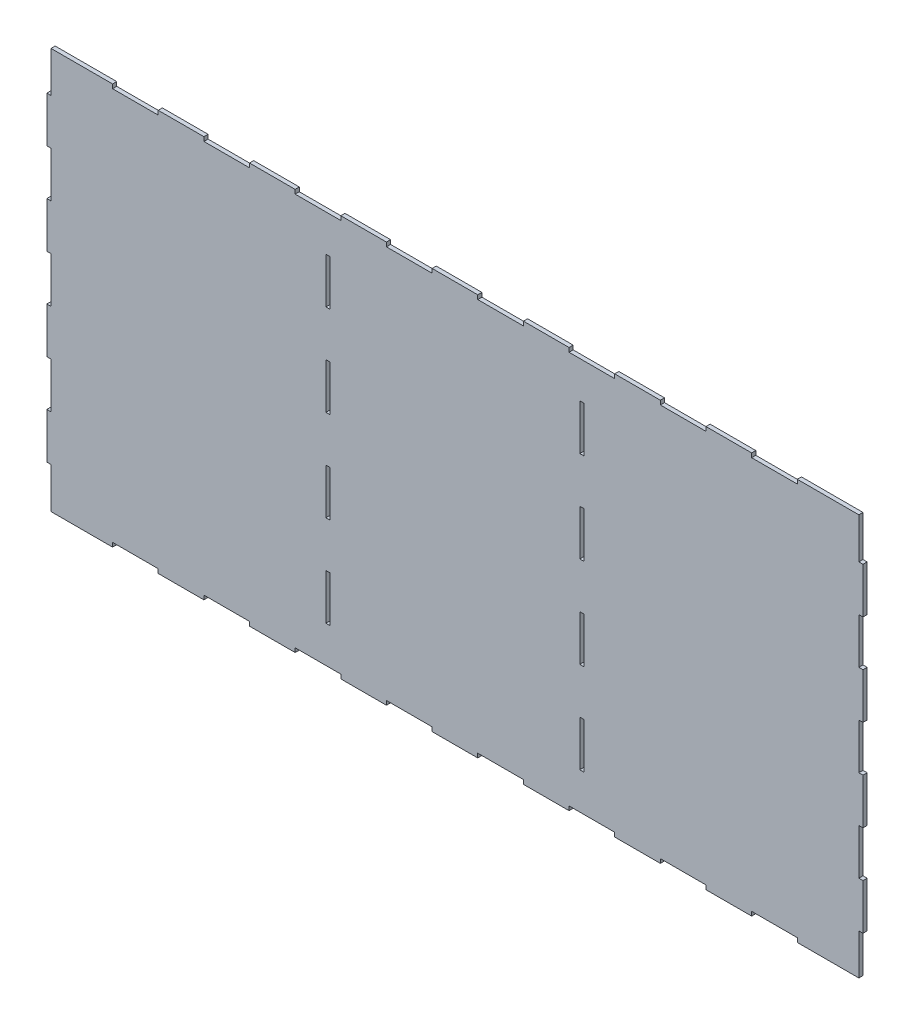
ISO-10303-21;
HEADER;
FILE_DESCRIPTION(('STEP AP214'),'2;1');
FILE_NAME('part.step','',(''),(''),'','','');
FILE_SCHEMA(('AUTOMOTIVE_DESIGN { 1 0 10303 214 1 1 1 1 }'));
ENDSEC;
DATA;
#1=APPLICATION_CONTEXT('core data for automotive mechanical design processes');
#2=APPLICATION_PROTOCOL_DEFINITION('international standard','automotive_design',2000,#1);
#3=PRODUCT_CONTEXT('',#1,'mechanical');
#4=PRODUCT('Part','Part','',(#3));
#5=PRODUCT_RELATED_PRODUCT_CATEGORY('part','',(#4));
#6=PRODUCT_DEFINITION_FORMATION('','',#4);
#7=PRODUCT_DEFINITION_CONTEXT('part definition',#1,'design');
#8=PRODUCT_DEFINITION('design','',#6,#7);
#9=PRODUCT_DEFINITION_SHAPE('','',#8);
#10=(LENGTH_UNIT() NAMED_UNIT(*) SI_UNIT(.MILLI.,.METRE.));
#11=(NAMED_UNIT(*) PLANE_ANGLE_UNIT() SI_UNIT($,.RADIAN.));
#12=(NAMED_UNIT(*) SI_UNIT($,.STERADIAN.) SOLID_ANGLE_UNIT());
#13=UNCERTAINTY_MEASURE_WITH_UNIT(LENGTH_MEASURE(1.E-05),#10,'distance_accuracy_value','');
#14=(GEOMETRIC_REPRESENTATION_CONTEXT(3) GLOBAL_UNCERTAINTY_ASSIGNED_CONTEXT((#13)) GLOBAL_UNIT_ASSIGNED_CONTEXT((#10,
#11,#12)) REPRESENTATION_CONTEXT('',''));
#15=CARTESIAN_POINT('',(0.,0.,0.));
#16=DIRECTION('',(0.,0.,1.));
#17=DIRECTION('',(1.,0.,0.));
#18=AXIS2_PLACEMENT_3D('',#15,#16,#17);
#19=CARTESIAN_POINT('',(0.,0.,3.));
#20=DIRECTION('',(0.,0.,1.));
#21=DIRECTION('',(1.,0.,0.));
#22=AXIS2_PLACEMENT_3D('',#19,#20,#21);
#23=PLANE('',#22);
#24=DIRECTION('',(-1.,0.,0.));
#25=VECTOR('',#24,1.);
#26=CARTESIAN_POINT('',(307.5,586.,3.));
#27=LINE('',#26,#25);
#28=CARTESIAN_POINT('',(340.5,586.,3.));
#29=VERTEX_POINT('',#28);
#30=CARTESIAN_POINT('',(296.,586.,3.));
#31=VERTEX_POINT('',#30);
#32=EDGE_CURVE('E1098',#29,#31,#27,.T.);
#33=ORIENTED_EDGE('',*,*,#32,.T.);
#34=DIRECTION('',(0.,-1.,0.));
#35=VECTOR('',#34,1.);
#36=CARTESIAN_POINT('',(296.,586.,3.));
#37=LINE('',#36,#35);
#38=CARTESIAN_POINT('',(296.,556.5,3.));
#39=VERTEX_POINT('',#38);
#40=EDGE_CURVE('E1101',#31,#39,#37,.T.);
#41=ORIENTED_EDGE('',*,*,#40,.T.);
#42=DIRECTION('',(-1.,0.,0.));
#43=VECTOR('',#42,1.);
#44=CARTESIAN_POINT('',(296.,556.5,3.));
#45=LINE('',#44,#43);
#46=CARTESIAN_POINT('',(293.,556.5,3.));
#47=VERTEX_POINT('',#46);
#48=EDGE_CURVE('E1104',#39,#47,#45,.T.);
#49=ORIENTED_EDGE('',*,*,#48,.T.);
#50=DIRECTION('',(0.,-1.,0.));
#51=VECTOR('',#50,1.);
#52=CARTESIAN_POINT('',(293.,556.5,3.));
#53=LINE('',#52,#51);
#54=CARTESIAN_POINT('',(293.,523.5,3.));
#55=VERTEX_POINT('',#54);
#56=EDGE_CURVE('E1106',#47,#55,#53,.T.);
#57=ORIENTED_EDGE('',*,*,#56,.T.);
#58=DIRECTION('',(1.,0.,0.));
#59=VECTOR('',#58,1.);
#60=CARTESIAN_POINT('',(293.,523.5,3.));
#61=LINE('',#60,#59);
#62=CARTESIAN_POINT('',(296.,523.5,3.));
#63=VERTEX_POINT('',#62);
#64=EDGE_CURVE('E1108',#55,#63,#61,.T.);
#65=ORIENTED_EDGE('',*,*,#64,.T.);
#66=DIRECTION('',(0.,-1.,0.));
#67=VECTOR('',#66,1.);
#68=CARTESIAN_POINT('',(296.,523.5,3.));
#69=LINE('',#68,#67);
#70=CARTESIAN_POINT('',(296.,490.5,3.));
#71=VERTEX_POINT('',#70);
#72=EDGE_CURVE('E1110',#63,#71,#69,.T.);
#73=ORIENTED_EDGE('',*,*,#72,.T.);
#74=DIRECTION('',(-1.,0.,0.));
#75=VECTOR('',#74,1.);
#76=CARTESIAN_POINT('',(296.,490.5,3.));
#77=LINE('',#76,#75);
#78=CARTESIAN_POINT('',(293.,490.5,3.));
#79=VERTEX_POINT('',#78);
#80=EDGE_CURVE('E1112',#71,#79,#77,.T.);
#81=ORIENTED_EDGE('',*,*,#80,.T.);
#82=DIRECTION('',(0.,-1.,0.));
#83=VECTOR('',#82,1.);
#84=CARTESIAN_POINT('',(293.,490.5,3.));
#85=LINE('',#84,#83);
#86=CARTESIAN_POINT('',(293.,457.5,3.));
#87=VERTEX_POINT('',#86);
#88=EDGE_CURVE('E1114',#79,#87,#85,.T.);
#89=ORIENTED_EDGE('',*,*,#88,.T.);
#90=DIRECTION('',(1.,0.,0.));
#91=VECTOR('',#90,1.);
#92=CARTESIAN_POINT('',(293.,457.5,3.));
#93=LINE('',#92,#91);
#94=CARTESIAN_POINT('',(296.,457.5,3.));
#95=VERTEX_POINT('',#94);
#96=EDGE_CURVE('E1116',#87,#95,#93,.T.);
#97=ORIENTED_EDGE('',*,*,#96,.T.);
#98=DIRECTION('',(0.,-1.,0.));
#99=VECTOR('',#98,1.);
#100=CARTESIAN_POINT('',(296.,457.5,3.));
#101=LINE('',#100,#99);
#102=CARTESIAN_POINT('',(296.,424.5,3.));
#103=VERTEX_POINT('',#102);
#104=EDGE_CURVE('E1118',#95,#103,#101,.T.);
#105=ORIENTED_EDGE('',*,*,#104,.T.);
#106=DIRECTION('',(-1.,0.,0.));
#107=VECTOR('',#106,1.);
#108=CARTESIAN_POINT('',(296.,424.5,3.));
#109=LINE('',#108,#107);
#110=CARTESIAN_POINT('',(293.,424.5,3.));
#111=VERTEX_POINT('',#110);
#112=EDGE_CURVE('E1120',#103,#111,#109,.T.);
#113=ORIENTED_EDGE('',*,*,#112,.T.);
#114=DIRECTION('',(0.,-1.,0.));
#115=VECTOR('',#114,1.);
#116=CARTESIAN_POINT('',(293.,424.5,3.));
#117=LINE('',#116,#115);
#118=CARTESIAN_POINT('',(293.,391.5,3.));
#119=VERTEX_POINT('',#118);
#120=EDGE_CURVE('E1122',#111,#119,#117,.T.);
#121=ORIENTED_EDGE('',*,*,#120,.T.);
#122=DIRECTION('',(1.,0.,0.));
#123=VECTOR('',#122,1.);
#124=CARTESIAN_POINT('',(293.,391.5,3.));
#125=LINE('',#124,#123);
#126=CARTESIAN_POINT('',(296.,391.5,3.));
#127=VERTEX_POINT('',#126);
#128=EDGE_CURVE('E1124',#119,#127,#125,.T.);
#129=ORIENTED_EDGE('',*,*,#128,.T.);
#130=DIRECTION('',(0.,-1.,0.));
#131=VECTOR('',#130,1.);
#132=CARTESIAN_POINT('',(296.,391.5,3.));
#133=LINE('',#132,#131);
#134=CARTESIAN_POINT('',(296.,358.5,3.));
#135=VERTEX_POINT('',#134);
#136=EDGE_CURVE('E1126',#127,#135,#133,.T.);
#137=ORIENTED_EDGE('',*,*,#136,.T.);
#138=DIRECTION('',(-1.,0.,0.));
#139=VECTOR('',#138,1.);
#140=CARTESIAN_POINT('',(296.,358.5,3.));
#141=LINE('',#140,#139);
#142=CARTESIAN_POINT('',(293.,358.5,3.));
#143=VERTEX_POINT('',#142);
#144=EDGE_CURVE('E1128',#135,#143,#141,.T.);
#145=ORIENTED_EDGE('',*,*,#144,.T.);
#146=DIRECTION('',(0.,-1.,0.));
#147=VECTOR('',#146,1.);
#148=CARTESIAN_POINT('',(293.,358.5,3.));
#149=LINE('',#148,#147);
#150=CARTESIAN_POINT('',(293.,325.5,3.));
#151=VERTEX_POINT('',#150);
#152=EDGE_CURVE('E1130',#143,#151,#149,.T.);
#153=ORIENTED_EDGE('',*,*,#152,.T.);
#154=DIRECTION('',(1.,0.,0.));
#155=VECTOR('',#154,1.);
#156=CARTESIAN_POINT('',(293.,325.5,3.));
#157=LINE('',#156,#155);
#158=CARTESIAN_POINT('',(296.,325.5,3.));
#159=VERTEX_POINT('',#158);
#160=EDGE_CURVE('E1132',#151,#159,#157,.T.);
#161=ORIENTED_EDGE('',*,*,#160,.T.);
#162=DIRECTION('',(0.,-1.,0.));
#163=VECTOR('',#162,1.);
#164=CARTESIAN_POINT('',(296.,325.5,3.));
#165=LINE('',#164,#163);
#166=CARTESIAN_POINT('',(296.,296.,3.));
#167=VERTEX_POINT('',#166);
#168=EDGE_CURVE('E1134',#159,#167,#165,.T.);
#169=ORIENTED_EDGE('',*,*,#168,.T.);
#170=DIRECTION('',(1.,0.,0.));
#171=VECTOR('',#170,1.);
#172=CARTESIAN_POINT('',(296.,296.,3.));
#173=LINE('',#172,#171);
#174=CARTESIAN_POINT('',(340.5,296.,3.));
#175=VERTEX_POINT('',#174);
#176=EDGE_CURVE('E1136',#167,#175,#173,.T.);
#177=ORIENTED_EDGE('',*,*,#176,.T.);
#178=DIRECTION('',(0.,1.,0.));
#179=VECTOR('',#178,1.);
#180=CARTESIAN_POINT('',(340.5,296.,3.));
#181=LINE('',#180,#179);
#182=CARTESIAN_POINT('',(340.5,299.,3.));
#183=VERTEX_POINT('',#182);
#184=EDGE_CURVE('E1138',#175,#183,#181,.T.);
#185=ORIENTED_EDGE('',*,*,#184,.T.);
#186=DIRECTION('',(1.,0.,0.));
#187=VECTOR('',#186,1.);
#188=CARTESIAN_POINT('',(340.5,299.,3.));
#189=LINE('',#188,#187);
#190=CARTESIAN_POINT('',(373.5,299.,3.));
#191=VERTEX_POINT('',#190);
#192=EDGE_CURVE('E1140',#183,#191,#189,.T.);
#193=ORIENTED_EDGE('',*,*,#192,.T.);
#194=DIRECTION('',(0.,-1.,0.));
#195=VECTOR('',#194,1.);
#196=CARTESIAN_POINT('',(373.5,299.,3.));
#197=LINE('',#196,#195);
#198=CARTESIAN_POINT('',(373.5,296.,3.));
#199=VERTEX_POINT('',#198);
#200=EDGE_CURVE('E1142',#191,#199,#197,.T.);
#201=ORIENTED_EDGE('',*,*,#200,.T.);
#202=DIRECTION('',(1.,0.,0.));
#203=VECTOR('',#202,1.);
#204=CARTESIAN_POINT('',(373.5,296.,3.));
#205=LINE('',#204,#203);
#206=CARTESIAN_POINT('',(406.5,296.,3.));
#207=VERTEX_POINT('',#206);
#208=EDGE_CURVE('E1144',#199,#207,#205,.T.);
#209=ORIENTED_EDGE('',*,*,#208,.T.);
#210=DIRECTION('',(0.,1.,0.));
#211=VECTOR('',#210,1.);
#212=CARTESIAN_POINT('',(406.5,296.,3.));
#213=LINE('',#212,#211);
#214=CARTESIAN_POINT('',(406.5,299.,3.));
#215=VERTEX_POINT('',#214);
#216=EDGE_CURVE('E1146',#207,#215,#213,.T.);
#217=ORIENTED_EDGE('',*,*,#216,.T.);
#218=DIRECTION('',(1.,0.,0.));
#219=VECTOR('',#218,1.);
#220=CARTESIAN_POINT('',(406.5,299.,3.));
#221=LINE('',#220,#219);
#222=CARTESIAN_POINT('',(439.5,299.,3.));
#223=VERTEX_POINT('',#222);
#224=EDGE_CURVE('E1148',#215,#223,#221,.T.);
#225=ORIENTED_EDGE('',*,*,#224,.T.);
#226=DIRECTION('',(0.,-1.,0.));
#227=VECTOR('',#226,1.);
#228=CARTESIAN_POINT('',(439.5,299.,3.));
#229=LINE('',#228,#227);
#230=CARTESIAN_POINT('',(439.5,296.,3.));
#231=VERTEX_POINT('',#230);
#232=EDGE_CURVE('E1150',#223,#231,#229,.T.);
#233=ORIENTED_EDGE('',*,*,#232,.T.);
#234=DIRECTION('',(1.,0.,0.));
#235=VECTOR('',#234,1.);
#236=CARTESIAN_POINT('',(439.5,296.,3.));
#237=LINE('',#236,#235);
#238=CARTESIAN_POINT('',(472.5,296.,3.));
#239=VERTEX_POINT('',#238);
#240=EDGE_CURVE('E1152',#231,#239,#237,.T.);
#241=ORIENTED_EDGE('',*,*,#240,.T.);
#242=DIRECTION('',(0.,1.,0.));
#243=VECTOR('',#242,1.);
#244=CARTESIAN_POINT('',(472.5,296.,3.));
#245=LINE('',#244,#243);
#246=CARTESIAN_POINT('',(472.5,299.,3.));
#247=VERTEX_POINT('',#246);
#248=EDGE_CURVE('E1154',#239,#247,#245,.T.);
#249=ORIENTED_EDGE('',*,*,#248,.T.);
#250=DIRECTION('',(1.,0.,0.));
#251=VECTOR('',#250,1.);
#252=CARTESIAN_POINT('',(472.5,299.,3.));
#253=LINE('',#252,#251);
#254=CARTESIAN_POINT('',(505.5,299.,3.));
#255=VERTEX_POINT('',#254);
#256=EDGE_CURVE('E1156',#247,#255,#253,.T.);
#257=ORIENTED_EDGE('',*,*,#256,.T.);
#258=DIRECTION('',(0.,-1.,0.));
#259=VECTOR('',#258,1.);
#260=CARTESIAN_POINT('',(505.5,299.,3.));
#261=LINE('',#260,#259);
#262=CARTESIAN_POINT('',(505.5,296.,3.));
#263=VERTEX_POINT('',#262);
#264=EDGE_CURVE('E1158',#255,#263,#261,.T.);
#265=ORIENTED_EDGE('',*,*,#264,.T.);
#266=DIRECTION('',(1.,0.,0.));
#267=VECTOR('',#266,1.);
#268=CARTESIAN_POINT('',(505.5,296.,3.));
#269=LINE('',#268,#267);
#270=CARTESIAN_POINT('',(538.5,296.,3.));
#271=VERTEX_POINT('',#270);
#272=EDGE_CURVE('E1160',#263,#271,#269,.T.);
#273=ORIENTED_EDGE('',*,*,#272,.T.);
#274=DIRECTION('',(0.,1.,0.));
#275=VECTOR('',#274,1.);
#276=CARTESIAN_POINT('',(538.5,296.,3.));
#277=LINE('',#276,#275);
#278=CARTESIAN_POINT('',(538.5,299.,3.));
#279=VERTEX_POINT('',#278);
#280=EDGE_CURVE('E1162',#271,#279,#277,.T.);
#281=ORIENTED_EDGE('',*,*,#280,.T.);
#282=DIRECTION('',(1.,0.,0.));
#283=VECTOR('',#282,1.);
#284=CARTESIAN_POINT('',(538.5,299.,3.));
#285=LINE('',#284,#283);
#286=CARTESIAN_POINT('',(571.5,299.,3.));
#287=VERTEX_POINT('',#286);
#288=EDGE_CURVE('E1164',#279,#287,#285,.T.);
#289=ORIENTED_EDGE('',*,*,#288,.T.);
#290=DIRECTION('',(0.,-1.,0.));
#291=VECTOR('',#290,1.);
#292=CARTESIAN_POINT('',(571.5,299.,3.));
#293=LINE('',#292,#291);
#294=CARTESIAN_POINT('',(571.5,296.,3.));
#295=VERTEX_POINT('',#294);
#296=EDGE_CURVE('E1166',#287,#295,#293,.T.);
#297=ORIENTED_EDGE('',*,*,#296,.T.);
#298=DIRECTION('',(1.,0.,0.));
#299=VECTOR('',#298,1.);
#300=CARTESIAN_POINT('',(571.5,296.,3.));
#301=LINE('',#300,#299);
#302=CARTESIAN_POINT('',(604.5,296.,3.));
#303=VERTEX_POINT('',#302);
#304=EDGE_CURVE('E1168',#295,#303,#301,.T.);
#305=ORIENTED_EDGE('',*,*,#304,.T.);
#306=DIRECTION('',(0.,1.,0.));
#307=VECTOR('',#306,1.);
#308=CARTESIAN_POINT('',(604.5,296.,3.));
#309=LINE('',#308,#307);
#310=CARTESIAN_POINT('',(604.5,299.,3.));
#311=VERTEX_POINT('',#310);
#312=EDGE_CURVE('E1170',#303,#311,#309,.T.);
#313=ORIENTED_EDGE('',*,*,#312,.T.);
#314=DIRECTION('',(1.,0.,0.));
#315=VECTOR('',#314,1.);
#316=CARTESIAN_POINT('',(604.5,299.,3.));
#317=LINE('',#316,#315);
#318=CARTESIAN_POINT('',(637.5,299.,3.));
#319=VERTEX_POINT('',#318);
#320=EDGE_CURVE('E1172',#311,#319,#317,.T.);
#321=ORIENTED_EDGE('',*,*,#320,.T.);
#322=DIRECTION('',(0.,-1.,0.));
#323=VECTOR('',#322,1.);
#324=CARTESIAN_POINT('',(637.5,299.,3.));
#325=LINE('',#324,#323);
#326=CARTESIAN_POINT('',(637.5,296.,3.));
#327=VERTEX_POINT('',#326);
#328=EDGE_CURVE('E1174',#319,#327,#325,.T.);
#329=ORIENTED_EDGE('',*,*,#328,.T.);
#330=DIRECTION('',(1.,0.,0.));
#331=VECTOR('',#330,1.);
#332=CARTESIAN_POINT('',(637.5,296.,3.));
#333=LINE('',#332,#331);
#334=CARTESIAN_POINT('',(670.5,296.,3.));
#335=VERTEX_POINT('',#334);
#336=EDGE_CURVE('E1176',#327,#335,#333,.T.);
#337=ORIENTED_EDGE('',*,*,#336,.T.);
#338=DIRECTION('',(0.,1.,0.));
#339=VECTOR('',#338,1.);
#340=CARTESIAN_POINT('',(670.5,296.,3.));
#341=LINE('',#340,#339);
#342=CARTESIAN_POINT('',(670.5,299.,3.));
#343=VERTEX_POINT('',#342);
#344=EDGE_CURVE('E1178',#335,#343,#341,.T.);
#345=ORIENTED_EDGE('',*,*,#344,.T.);
#346=DIRECTION('',(1.,0.,0.));
#347=VECTOR('',#346,1.);
#348=CARTESIAN_POINT('',(670.5,299.,3.));
#349=LINE('',#348,#347);
#350=CARTESIAN_POINT('',(703.5,299.,3.));
#351=VERTEX_POINT('',#350);
#352=EDGE_CURVE('E1180',#343,#351,#349,.T.);
#353=ORIENTED_EDGE('',*,*,#352,.T.);
#354=DIRECTION('',(0.,-1.,0.));
#355=VECTOR('',#354,1.);
#356=CARTESIAN_POINT('',(703.5,299.,3.));
#357=LINE('',#356,#355);
#358=CARTESIAN_POINT('',(703.5,296.,3.));
#359=VERTEX_POINT('',#358);
#360=EDGE_CURVE('E1182',#351,#359,#357,.T.);
#361=ORIENTED_EDGE('',*,*,#360,.T.);
#362=DIRECTION('',(1.,0.,0.));
#363=VECTOR('',#362,1.);
#364=CARTESIAN_POINT('',(703.5,296.,3.));
#365=LINE('',#364,#363);
#366=CARTESIAN_POINT('',(736.5,296.,3.));
#367=VERTEX_POINT('',#366);
#368=EDGE_CURVE('E1184',#359,#367,#365,.T.);
#369=ORIENTED_EDGE('',*,*,#368,.T.);
#370=DIRECTION('',(0.,1.,0.));
#371=VECTOR('',#370,1.);
#372=CARTESIAN_POINT('',(736.5,296.,3.));
#373=LINE('',#372,#371);
#374=CARTESIAN_POINT('',(736.5,299.,3.));
#375=VERTEX_POINT('',#374);
#376=EDGE_CURVE('E1186',#367,#375,#373,.T.);
#377=ORIENTED_EDGE('',*,*,#376,.T.);
#378=DIRECTION('',(1.,0.,0.));
#379=VECTOR('',#378,1.);
#380=CARTESIAN_POINT('',(736.5,299.,3.));
#381=LINE('',#380,#379);
#382=CARTESIAN_POINT('',(769.5,299.,3.));
#383=VERTEX_POINT('',#382);
#384=EDGE_CURVE('E1188',#375,#383,#381,.T.);
#385=ORIENTED_EDGE('',*,*,#384,.T.);
#386=DIRECTION('',(0.,-1.,0.));
#387=VECTOR('',#386,1.);
#388=CARTESIAN_POINT('',(769.5,299.,3.));
#389=LINE('',#388,#387);
#390=CARTESIAN_POINT('',(769.5,296.,3.));
#391=VERTEX_POINT('',#390);
#392=EDGE_CURVE('E1190',#383,#391,#389,.T.);
#393=ORIENTED_EDGE('',*,*,#392,.T.);
#394=DIRECTION('',(1.,0.,0.));
#395=VECTOR('',#394,1.);
#396=CARTESIAN_POINT('',(769.5,296.,3.));
#397=LINE('',#396,#395);
#398=CARTESIAN_POINT('',(802.5,296.,3.));
#399=VERTEX_POINT('',#398);
#400=EDGE_CURVE('E1192',#391,#399,#397,.T.);
#401=ORIENTED_EDGE('',*,*,#400,.T.);
#402=DIRECTION('',(0.,1.,0.));
#403=VECTOR('',#402,1.);
#404=CARTESIAN_POINT('',(802.5,296.,3.));
#405=LINE('',#404,#403);
#406=CARTESIAN_POINT('',(802.5,299.,3.));
#407=VERTEX_POINT('',#406);
#408=EDGE_CURVE('E1194',#399,#407,#405,.T.);
#409=ORIENTED_EDGE('',*,*,#408,.T.);
#410=DIRECTION('',(1.,0.,0.));
#411=VECTOR('',#410,1.);
#412=CARTESIAN_POINT('',(802.5,299.,3.));
#413=LINE('',#412,#411);
#414=CARTESIAN_POINT('',(835.5,299.,3.));
#415=VERTEX_POINT('',#414);
#416=EDGE_CURVE('E1196',#407,#415,#413,.T.);
#417=ORIENTED_EDGE('',*,*,#416,.T.);
#418=DIRECTION('',(0.,-1.,0.));
#419=VECTOR('',#418,1.);
#420=CARTESIAN_POINT('',(835.5,299.,3.));
#421=LINE('',#420,#419);
#422=CARTESIAN_POINT('',(835.5,296.,3.));
#423=VERTEX_POINT('',#422);
#424=EDGE_CURVE('E1198',#415,#423,#421,.T.);
#425=ORIENTED_EDGE('',*,*,#424,.T.);
#426=DIRECTION('',(1.,0.,0.));
#427=VECTOR('',#426,1.);
#428=CARTESIAN_POINT('',(835.5,296.,3.));
#429=LINE('',#428,#427);
#430=CARTESIAN_POINT('',(880.,296.,3.));
#431=VERTEX_POINT('',#430);
#432=EDGE_CURVE('E1200',#423,#431,#429,.T.);
#433=ORIENTED_EDGE('',*,*,#432,.T.);
#434=DIRECTION('',(0.,1.,0.));
#435=VECTOR('',#434,1.);
#436=CARTESIAN_POINT('',(880.,296.,3.));
#437=LINE('',#436,#435);
#438=CARTESIAN_POINT('',(880.,325.5,3.));
#439=VERTEX_POINT('',#438);
#440=EDGE_CURVE('E1202',#431,#439,#437,.T.);
#441=ORIENTED_EDGE('',*,*,#440,.T.);
#442=DIRECTION('',(1.,0.,0.));
#443=VECTOR('',#442,1.);
#444=CARTESIAN_POINT('',(880.,325.5,3.));
#445=LINE('',#444,#443);
#446=CARTESIAN_POINT('',(883.,325.5,3.));
#447=VERTEX_POINT('',#446);
#448=EDGE_CURVE('E1204',#439,#447,#445,.T.);
#449=ORIENTED_EDGE('',*,*,#448,.T.);
#450=DIRECTION('',(0.,1.,0.));
#451=VECTOR('',#450,1.);
#452=CARTESIAN_POINT('',(883.,325.5,3.));
#453=LINE('',#452,#451);
#454=CARTESIAN_POINT('',(883.,358.5,3.));
#455=VERTEX_POINT('',#454);
#456=EDGE_CURVE('E1206',#447,#455,#453,.T.);
#457=ORIENTED_EDGE('',*,*,#456,.T.);
#458=DIRECTION('',(-1.,0.,0.));
#459=VECTOR('',#458,1.);
#460=CARTESIAN_POINT('',(883.,358.5,3.));
#461=LINE('',#460,#459);
#462=CARTESIAN_POINT('',(880.,358.5,3.));
#463=VERTEX_POINT('',#462);
#464=EDGE_CURVE('E1208',#455,#463,#461,.T.);
#465=ORIENTED_EDGE('',*,*,#464,.T.);
#466=DIRECTION('',(0.,1.,0.));
#467=VECTOR('',#466,1.);
#468=CARTESIAN_POINT('',(880.,358.5,3.));
#469=LINE('',#468,#467);
#470=CARTESIAN_POINT('',(880.,391.5,3.));
#471=VERTEX_POINT('',#470);
#472=EDGE_CURVE('E1210',#463,#471,#469,.T.);
#473=ORIENTED_EDGE('',*,*,#472,.T.);
#474=DIRECTION('',(1.,0.,0.));
#475=VECTOR('',#474,1.);
#476=CARTESIAN_POINT('',(880.,391.5,3.));
#477=LINE('',#476,#475);
#478=CARTESIAN_POINT('',(883.,391.5,3.));
#479=VERTEX_POINT('',#478);
#480=EDGE_CURVE('E1212',#471,#479,#477,.T.);
#481=ORIENTED_EDGE('',*,*,#480,.T.);
#482=DIRECTION('',(0.,1.,0.));
#483=VECTOR('',#482,1.);
#484=CARTESIAN_POINT('',(883.,391.5,3.));
#485=LINE('',#484,#483);
#486=CARTESIAN_POINT('',(883.,424.5,3.));
#487=VERTEX_POINT('',#486);
#488=EDGE_CURVE('E1214',#479,#487,#485,.T.);
#489=ORIENTED_EDGE('',*,*,#488,.T.);
#490=DIRECTION('',(-1.,0.,0.));
#491=VECTOR('',#490,1.);
#492=CARTESIAN_POINT('',(883.,424.5,3.));
#493=LINE('',#492,#491);
#494=CARTESIAN_POINT('',(880.,424.5,3.));
#495=VERTEX_POINT('',#494);
#496=EDGE_CURVE('E1216',#487,#495,#493,.T.);
#497=ORIENTED_EDGE('',*,*,#496,.T.);
#498=DIRECTION('',(0.,1.,0.));
#499=VECTOR('',#498,1.);
#500=CARTESIAN_POINT('',(880.,424.5,3.));
#501=LINE('',#500,#499);
#502=CARTESIAN_POINT('',(880.,457.5,3.));
#503=VERTEX_POINT('',#502);
#504=EDGE_CURVE('E1218',#495,#503,#501,.T.);
#505=ORIENTED_EDGE('',*,*,#504,.T.);
#506=DIRECTION('',(1.,0.,0.));
#507=VECTOR('',#506,1.);
#508=CARTESIAN_POINT('',(880.,457.5,3.));
#509=LINE('',#508,#507);
#510=CARTESIAN_POINT('',(883.,457.5,3.));
#511=VERTEX_POINT('',#510);
#512=EDGE_CURVE('E1220',#503,#511,#509,.T.);
#513=ORIENTED_EDGE('',*,*,#512,.T.);
#514=DIRECTION('',(0.,1.,0.));
#515=VECTOR('',#514,1.);
#516=CARTESIAN_POINT('',(883.,457.5,3.));
#517=LINE('',#516,#515);
#518=CARTESIAN_POINT('',(883.,490.5,3.));
#519=VERTEX_POINT('',#518);
#520=EDGE_CURVE('E1222',#511,#519,#517,.T.);
#521=ORIENTED_EDGE('',*,*,#520,.T.);
#522=DIRECTION('',(-1.,0.,0.));
#523=VECTOR('',#522,1.);
#524=CARTESIAN_POINT('',(883.,490.5,3.));
#525=LINE('',#524,#523);
#526=CARTESIAN_POINT('',(880.,490.5,3.));
#527=VERTEX_POINT('',#526);
#528=EDGE_CURVE('E1224',#519,#527,#525,.T.);
#529=ORIENTED_EDGE('',*,*,#528,.T.);
#530=DIRECTION('',(0.,1.,0.));
#531=VECTOR('',#530,1.);
#532=CARTESIAN_POINT('',(880.,490.5,3.));
#533=LINE('',#532,#531);
#534=CARTESIAN_POINT('',(880.,523.5,3.));
#535=VERTEX_POINT('',#534);
#536=EDGE_CURVE('E1226',#527,#535,#533,.T.);
#537=ORIENTED_EDGE('',*,*,#536,.T.);
#538=DIRECTION('',(1.,0.,0.));
#539=VECTOR('',#538,1.);
#540=CARTESIAN_POINT('',(880.,523.5,3.));
#541=LINE('',#540,#539);
#542=CARTESIAN_POINT('',(883.,523.5,3.));
#543=VERTEX_POINT('',#542);
#544=EDGE_CURVE('E1228',#535,#543,#541,.T.);
#545=ORIENTED_EDGE('',*,*,#544,.T.);
#546=DIRECTION('',(0.,1.,0.));
#547=VECTOR('',#546,1.);
#548=CARTESIAN_POINT('',(883.,523.5,3.));
#549=LINE('',#548,#547);
#550=CARTESIAN_POINT('',(883.,556.5,3.));
#551=VERTEX_POINT('',#550);
#552=EDGE_CURVE('E1230',#543,#551,#549,.T.);
#553=ORIENTED_EDGE('',*,*,#552,.T.);
#554=DIRECTION('',(-1.,0.,0.));
#555=VECTOR('',#554,1.);
#556=CARTESIAN_POINT('',(883.,556.5,3.));
#557=LINE('',#556,#555);
#558=CARTESIAN_POINT('',(880.,556.5,3.));
#559=VERTEX_POINT('',#558);
#560=EDGE_CURVE('E1232',#551,#559,#557,.T.);
#561=ORIENTED_EDGE('',*,*,#560,.T.);
#562=DIRECTION('',(0.,1.,0.));
#563=VECTOR('',#562,1.);
#564=CARTESIAN_POINT('',(880.,556.5,3.));
#565=LINE('',#564,#563);
#566=CARTESIAN_POINT('',(880.,586.,3.));
#567=VERTEX_POINT('',#566);
#568=EDGE_CURVE('E1234',#559,#567,#565,.T.);
#569=ORIENTED_EDGE('',*,*,#568,.T.);
#570=DIRECTION('',(-1.,0.,0.));
#571=VECTOR('',#570,1.);
#572=CARTESIAN_POINT('',(880.,586.,3.));
#573=LINE('',#572,#571);
#574=CARTESIAN_POINT('',(835.5,586.,3.));
#575=VERTEX_POINT('',#574);
#576=EDGE_CURVE('E1236',#567,#575,#573,.T.);
#577=ORIENTED_EDGE('',*,*,#576,.T.);
#578=DIRECTION('',(0.,-1.,0.));
#579=VECTOR('',#578,1.);
#580=CARTESIAN_POINT('',(835.5,586.,3.));
#581=LINE('',#580,#579);
#582=CARTESIAN_POINT('',(835.5,583.,3.));
#583=VERTEX_POINT('',#582);
#584=EDGE_CURVE('E1238',#575,#583,#581,.T.);
#585=ORIENTED_EDGE('',*,*,#584,.T.);
#586=DIRECTION('',(-1.,0.,0.));
#587=VECTOR('',#586,1.);
#588=CARTESIAN_POINT('',(835.5,583.,3.));
#589=LINE('',#588,#587);
#590=CARTESIAN_POINT('',(802.5,583.,3.));
#591=VERTEX_POINT('',#590);
#592=EDGE_CURVE('E1240',#583,#591,#589,.T.);
#593=ORIENTED_EDGE('',*,*,#592,.T.);
#594=DIRECTION('',(0.,1.,0.));
#595=VECTOR('',#594,1.);
#596=CARTESIAN_POINT('',(802.5,583.,3.));
#597=LINE('',#596,#595);
#598=CARTESIAN_POINT('',(802.5,586.,3.));
#599=VERTEX_POINT('',#598);
#600=EDGE_CURVE('E1242',#591,#599,#597,.T.);
#601=ORIENTED_EDGE('',*,*,#600,.T.);
#602=DIRECTION('',(-1.,0.,0.));
#603=VECTOR('',#602,1.);
#604=CARTESIAN_POINT('',(802.5,586.,3.));
#605=LINE('',#604,#603);
#606=CARTESIAN_POINT('',(769.5,586.,3.));
#607=VERTEX_POINT('',#606);
#608=EDGE_CURVE('E1244',#599,#607,#605,.T.);
#609=ORIENTED_EDGE('',*,*,#608,.T.);
#610=DIRECTION('',(0.,-1.,0.));
#611=VECTOR('',#610,1.);
#612=CARTESIAN_POINT('',(769.5,586.,3.));
#613=LINE('',#612,#611);
#614=CARTESIAN_POINT('',(769.5,583.,3.));
#615=VERTEX_POINT('',#614);
#616=EDGE_CURVE('E1246',#607,#615,#613,.T.);
#617=ORIENTED_EDGE('',*,*,#616,.T.);
#618=DIRECTION('',(-1.,0.,0.));
#619=VECTOR('',#618,1.);
#620=CARTESIAN_POINT('',(769.5,583.,3.));
#621=LINE('',#620,#619);
#622=CARTESIAN_POINT('',(736.5,583.,3.));
#623=VERTEX_POINT('',#622);
#624=EDGE_CURVE('E1248',#615,#623,#621,.T.);
#625=ORIENTED_EDGE('',*,*,#624,.T.);
#626=DIRECTION('',(0.,1.,0.));
#627=VECTOR('',#626,1.);
#628=CARTESIAN_POINT('',(736.5,583.,3.));
#629=LINE('',#628,#627);
#630=CARTESIAN_POINT('',(736.5,586.,3.));
#631=VERTEX_POINT('',#630);
#632=EDGE_CURVE('E1250',#623,#631,#629,.T.);
#633=ORIENTED_EDGE('',*,*,#632,.T.);
#634=DIRECTION('',(-1.,0.,0.));
#635=VECTOR('',#634,1.);
#636=CARTESIAN_POINT('',(736.5,586.,3.));
#637=LINE('',#636,#635);
#638=CARTESIAN_POINT('',(703.5,586.,3.));
#639=VERTEX_POINT('',#638);
#640=EDGE_CURVE('E1252',#631,#639,#637,.T.);
#641=ORIENTED_EDGE('',*,*,#640,.T.);
#642=DIRECTION('',(0.,-1.,0.));
#643=VECTOR('',#642,1.);
#644=CARTESIAN_POINT('',(703.5,586.,3.));
#645=LINE('',#644,#643);
#646=CARTESIAN_POINT('',(703.5,583.,3.));
#647=VERTEX_POINT('',#646);
#648=EDGE_CURVE('E1254',#639,#647,#645,.T.);
#649=ORIENTED_EDGE('',*,*,#648,.T.);
#650=DIRECTION('',(-1.,0.,0.));
#651=VECTOR('',#650,1.);
#652=CARTESIAN_POINT('',(703.5,583.,3.));
#653=LINE('',#652,#651);
#654=CARTESIAN_POINT('',(670.5,583.,3.));
#655=VERTEX_POINT('',#654);
#656=EDGE_CURVE('E1256',#647,#655,#653,.T.);
#657=ORIENTED_EDGE('',*,*,#656,.T.);
#658=DIRECTION('',(0.,1.,0.));
#659=VECTOR('',#658,1.);
#660=CARTESIAN_POINT('',(670.5,583.,3.));
#661=LINE('',#660,#659);
#662=CARTESIAN_POINT('',(670.5,586.,3.));
#663=VERTEX_POINT('',#662);
#664=EDGE_CURVE('E1258',#655,#663,#661,.T.);
#665=ORIENTED_EDGE('',*,*,#664,.T.);
#666=DIRECTION('',(-1.,0.,0.));
#667=VECTOR('',#666,1.);
#668=CARTESIAN_POINT('',(670.5,586.,3.));
#669=LINE('',#668,#667);
#670=CARTESIAN_POINT('',(637.5,586.,3.));
#671=VERTEX_POINT('',#670);
#672=EDGE_CURVE('E1260',#663,#671,#669,.T.);
#673=ORIENTED_EDGE('',*,*,#672,.T.);
#674=DIRECTION('',(0.,-1.,0.));
#675=VECTOR('',#674,1.);
#676=CARTESIAN_POINT('',(637.5,586.,3.));
#677=LINE('',#676,#675);
#678=CARTESIAN_POINT('',(637.5,583.,3.));
#679=VERTEX_POINT('',#678);
#680=EDGE_CURVE('E1262',#671,#679,#677,.T.);
#681=ORIENTED_EDGE('',*,*,#680,.T.);
#682=DIRECTION('',(-1.,0.,0.));
#683=VECTOR('',#682,1.);
#684=CARTESIAN_POINT('',(637.5,583.,3.));
#685=LINE('',#684,#683);
#686=CARTESIAN_POINT('',(604.5,583.,3.));
#687=VERTEX_POINT('',#686);
#688=EDGE_CURVE('E1264',#679,#687,#685,.T.);
#689=ORIENTED_EDGE('',*,*,#688,.T.);
#690=DIRECTION('',(0.,1.,0.));
#691=VECTOR('',#690,1.);
#692=CARTESIAN_POINT('',(604.5,583.,3.));
#693=LINE('',#692,#691);
#694=CARTESIAN_POINT('',(604.5,586.,3.));
#695=VERTEX_POINT('',#694);
#696=EDGE_CURVE('E1266',#687,#695,#693,.T.);
#697=ORIENTED_EDGE('',*,*,#696,.T.);
#698=DIRECTION('',(-1.,0.,0.));
#699=VECTOR('',#698,1.);
#700=CARTESIAN_POINT('',(604.5,586.,3.));
#701=LINE('',#700,#699);
#702=CARTESIAN_POINT('',(571.5,586.,3.));
#703=VERTEX_POINT('',#702);
#704=EDGE_CURVE('E1268',#695,#703,#701,.T.);
#705=ORIENTED_EDGE('',*,*,#704,.T.);
#706=DIRECTION('',(0.,-1.,0.));
#707=VECTOR('',#706,1.);
#708=CARTESIAN_POINT('',(571.5,586.,3.));
#709=LINE('',#708,#707);
#710=CARTESIAN_POINT('',(571.5,583.,3.));
#711=VERTEX_POINT('',#710);
#712=EDGE_CURVE('E1270',#703,#711,#709,.T.);
#713=ORIENTED_EDGE('',*,*,#712,.T.);
#714=DIRECTION('',(-1.,0.,0.));
#715=VECTOR('',#714,1.);
#716=CARTESIAN_POINT('',(571.5,583.,3.));
#717=LINE('',#716,#715);
#718=CARTESIAN_POINT('',(538.5,583.,3.));
#719=VERTEX_POINT('',#718);
#720=EDGE_CURVE('E1272',#711,#719,#717,.T.);
#721=ORIENTED_EDGE('',*,*,#720,.T.);
#722=DIRECTION('',(0.,1.,0.));
#723=VECTOR('',#722,1.);
#724=CARTESIAN_POINT('',(538.5,583.,3.));
#725=LINE('',#724,#723);
#726=CARTESIAN_POINT('',(538.5,586.,3.));
#727=VERTEX_POINT('',#726);
#728=EDGE_CURVE('E1274',#719,#727,#725,.T.);
#729=ORIENTED_EDGE('',*,*,#728,.T.);
#730=DIRECTION('',(-1.,0.,0.));
#731=VECTOR('',#730,1.);
#732=CARTESIAN_POINT('',(538.5,586.,3.));
#733=LINE('',#732,#731);
#734=CARTESIAN_POINT('',(505.5,586.,3.));
#735=VERTEX_POINT('',#734);
#736=EDGE_CURVE('E1276',#727,#735,#733,.T.);
#737=ORIENTED_EDGE('',*,*,#736,.T.);
#738=DIRECTION('',(0.,-1.,0.));
#739=VECTOR('',#738,1.);
#740=CARTESIAN_POINT('',(505.5,586.,3.));
#741=LINE('',#740,#739);
#742=CARTESIAN_POINT('',(505.5,583.,3.));
#743=VERTEX_POINT('',#742);
#744=EDGE_CURVE('E1278',#735,#743,#741,.T.);
#745=ORIENTED_EDGE('',*,*,#744,.T.);
#746=DIRECTION('',(-1.,0.,0.));
#747=VECTOR('',#746,1.);
#748=CARTESIAN_POINT('',(505.5,583.,3.));
#749=LINE('',#748,#747);
#750=CARTESIAN_POINT('',(472.5,583.,3.));
#751=VERTEX_POINT('',#750);
#752=EDGE_CURVE('E1280',#743,#751,#749,.T.);
#753=ORIENTED_EDGE('',*,*,#752,.T.);
#754=DIRECTION('',(0.,1.,0.));
#755=VECTOR('',#754,1.);
#756=CARTESIAN_POINT('',(472.5,583.,3.));
#757=LINE('',#756,#755);
#758=CARTESIAN_POINT('',(472.5,586.,3.));
#759=VERTEX_POINT('',#758);
#760=EDGE_CURVE('E1282',#751,#759,#757,.T.);
#761=ORIENTED_EDGE('',*,*,#760,.T.);
#762=DIRECTION('',(-1.,0.,0.));
#763=VECTOR('',#762,1.);
#764=CARTESIAN_POINT('',(472.5,586.,3.));
#765=LINE('',#764,#763);
#766=CARTESIAN_POINT('',(439.5,586.,3.));
#767=VERTEX_POINT('',#766);
#768=EDGE_CURVE('E1284',#759,#767,#765,.T.);
#769=ORIENTED_EDGE('',*,*,#768,.T.);
#770=DIRECTION('',(0.,-1.,0.));
#771=VECTOR('',#770,1.);
#772=CARTESIAN_POINT('',(439.5,586.,3.));
#773=LINE('',#772,#771);
#774=CARTESIAN_POINT('',(439.5,583.,3.));
#775=VERTEX_POINT('',#774);
#776=EDGE_CURVE('E1286',#767,#775,#773,.T.);
#777=ORIENTED_EDGE('',*,*,#776,.T.);
#778=DIRECTION('',(-1.,0.,0.));
#779=VECTOR('',#778,1.);
#780=CARTESIAN_POINT('',(439.5,583.,3.));
#781=LINE('',#780,#779);
#782=CARTESIAN_POINT('',(406.5,583.,3.));
#783=VERTEX_POINT('',#782);
#784=EDGE_CURVE('E1288',#775,#783,#781,.T.);
#785=ORIENTED_EDGE('',*,*,#784,.T.);
#786=DIRECTION('',(0.,1.,0.));
#787=VECTOR('',#786,1.);
#788=CARTESIAN_POINT('',(406.5,583.,3.));
#789=LINE('',#788,#787);
#790=CARTESIAN_POINT('',(406.5,586.,3.));
#791=VERTEX_POINT('',#790);
#792=EDGE_CURVE('E1290',#783,#791,#789,.T.);
#793=ORIENTED_EDGE('',*,*,#792,.T.);
#794=DIRECTION('',(-1.,0.,0.));
#795=VECTOR('',#794,1.);
#796=CARTESIAN_POINT('',(406.5,586.,3.));
#797=LINE('',#796,#795);
#798=CARTESIAN_POINT('',(373.5,586.,3.));
#799=VERTEX_POINT('',#798);
#800=EDGE_CURVE('E1292',#791,#799,#797,.T.);
#801=ORIENTED_EDGE('',*,*,#800,.T.);
#802=DIRECTION('',(0.,-1.,0.));
#803=VECTOR('',#802,1.);
#804=CARTESIAN_POINT('',(373.5,586.,3.));
#805=LINE('',#804,#803);
#806=CARTESIAN_POINT('',(373.5,583.,3.));
#807=VERTEX_POINT('',#806);
#808=EDGE_CURVE('E1294',#799,#807,#805,.T.);
#809=ORIENTED_EDGE('',*,*,#808,.T.);
#810=DIRECTION('',(-1.,0.,0.));
#811=VECTOR('',#810,1.);
#812=CARTESIAN_POINT('',(373.5,583.,3.));
#813=LINE('',#812,#811);
#814=CARTESIAN_POINT('',(340.5,583.,3.));
#815=VERTEX_POINT('',#814);
#816=EDGE_CURVE('E1296',#807,#815,#813,.T.);
#817=ORIENTED_EDGE('',*,*,#816,.T.);
#818=DIRECTION('',(0.,1.,0.));
#819=VECTOR('',#818,1.);
#820=CARTESIAN_POINT('',(340.5,583.,3.));
#821=LINE('',#820,#819);
#822=EDGE_CURVE('E1298',#815,#29,#821,.T.);
#823=ORIENTED_EDGE('',*,*,#822,.T.);
#824=EDGE_LOOP('',(#33,#41,#49,#57,#65,#73,#81,#89,#97,#105,#113,#121,#129,#137,#145,#153,#161,
#169,#177,#185,#193,#201,#209,#217,#225,#233,#241,#249,#257,#265,#273,#281,#289,#297,#305,#313,
#321,#329,#337,#345,#353,#361,#369,#377,#385,#393,#401,#409,#417,#425,#433,#441,#449,#457,#465,
#473,#481,#489,#497,#505,#513,#521,#529,#537,#545,#553,#561,#569,#577,#585,#593,#601,#609,#617,
#625,#633,#641,#649,#657,#665,#673,#681,#689,#697,#705,#713,#721,#729,#737,#745,#753,#761,#769,
#777,#785,#793,#801,#809,#817,#823));
#825=FACE_BOUND('',#824,.T.);
#826=DIRECTION('',(1.,0.,0.));
#827=VECTOR('',#826,1.);
#828=CARTESIAN_POINT('',(678.25,523.5,3.));
#829=LINE('',#828,#827);
#830=CARTESIAN_POINT('',(678.25,523.5,3.));
#831=VERTEX_POINT('',#830);
#832=CARTESIAN_POINT('',(681.25,523.5,3.));
#833=VERTEX_POINT('',#832);
#834=EDGE_CURVE('E1069',#831,#833,#829,.T.);
#835=ORIENTED_EDGE('',*,*,#834,.F.);
#836=DIRECTION('',(0.,-1.,0.));
#837=VECTOR('',#836,1.);
#838=CARTESIAN_POINT('',(678.25,556.5,3.));
#839=LINE('',#838,#837);
#840=CARTESIAN_POINT('',(678.25,556.5,3.));
#841=VERTEX_POINT('',#840);
#842=EDGE_CURVE('E1067',#841,#831,#839,.T.);
#843=ORIENTED_EDGE('',*,*,#842,.F.);
#844=DIRECTION('',(-1.,0.,0.));
#845=VECTOR('',#844,1.);
#846=CARTESIAN_POINT('',(678.25,556.5,3.));
#847=LINE('',#846,#845);
#848=CARTESIAN_POINT('',(681.25,556.5,3.));
#849=VERTEX_POINT('',#848);
#850=EDGE_CURVE('E1075',#849,#841,#847,.T.);
#851=ORIENTED_EDGE('',*,*,#850,.F.);
#852=DIRECTION('',(0.,1.,0.));
#853=VECTOR('',#852,1.);
#854=CARTESIAN_POINT('',(681.25,556.5,3.));
#855=LINE('',#854,#853);
#856=EDGE_CURVE('E1072',#833,#849,#855,.T.);
#857=ORIENTED_EDGE('',*,*,#856,.F.);
#858=EDGE_LOOP('',(#835,#843,#851,#857));
#859=FACE_BOUND('',#858,.T.);
#860=DIRECTION('',(1.,0.,0.));
#861=VECTOR('',#860,1.);
#862=CARTESIAN_POINT('',(678.25,457.5,3.));
#863=LINE('',#862,#861);
#864=CARTESIAN_POINT('',(678.25,457.5,3.));
#865=VERTEX_POINT('',#864);
#866=CARTESIAN_POINT('',(681.25,457.5,3.));
#867=VERTEX_POINT('',#866);
#868=EDGE_CURVE('E1038',#865,#867,#863,.T.);
#869=ORIENTED_EDGE('',*,*,#868,.F.);
#870=DIRECTION('',(0.,-1.,0.));
#871=VECTOR('',#870,1.);
#872=CARTESIAN_POINT('',(678.25,490.5,3.));
#873=LINE('',#872,#871);
#874=CARTESIAN_POINT('',(678.25,490.5,3.));
#875=VERTEX_POINT('',#874);
#876=EDGE_CURVE('E1036',#875,#865,#873,.T.);
#877=ORIENTED_EDGE('',*,*,#876,.F.);
#878=DIRECTION('',(-1.,0.,0.));
#879=VECTOR('',#878,1.);
#880=CARTESIAN_POINT('',(678.25,490.5,3.));
#881=LINE('',#880,#879);
#882=CARTESIAN_POINT('',(681.25,490.5,3.));
#883=VERTEX_POINT('',#882);
#884=EDGE_CURVE('E1044',#883,#875,#881,.T.);
#885=ORIENTED_EDGE('',*,*,#884,.F.);
#886=DIRECTION('',(0.,1.,0.));
#887=VECTOR('',#886,1.);
#888=CARTESIAN_POINT('',(681.25,490.5,3.));
#889=LINE('',#888,#887);
#890=EDGE_CURVE('E1041',#867,#883,#889,.T.);
#891=ORIENTED_EDGE('',*,*,#890,.F.);
#892=EDGE_LOOP('',(#869,#877,#885,#891));
#893=FACE_BOUND('',#892,.T.);
#894=DIRECTION('',(1.,0.,0.));
#895=VECTOR('',#894,1.);
#896=CARTESIAN_POINT('',(678.25,391.5,3.));
#897=LINE('',#896,#895);
#898=CARTESIAN_POINT('',(678.25,391.5,3.));
#899=VERTEX_POINT('',#898);
#900=CARTESIAN_POINT('',(681.25,391.5,3.));
#901=VERTEX_POINT('',#900);
#902=EDGE_CURVE('E1007',#899,#901,#897,.T.);
#903=ORIENTED_EDGE('',*,*,#902,.F.);
#904=DIRECTION('',(0.,-1.,0.));
#905=VECTOR('',#904,1.);
#906=CARTESIAN_POINT('',(678.25,424.5,3.));
#907=LINE('',#906,#905);
#908=CARTESIAN_POINT('',(678.25,424.5,3.));
#909=VERTEX_POINT('',#908);
#910=EDGE_CURVE('E1005',#909,#899,#907,.T.);
#911=ORIENTED_EDGE('',*,*,#910,.F.);
#912=DIRECTION('',(-1.,0.,0.));
#913=VECTOR('',#912,1.);
#914=CARTESIAN_POINT('',(678.25,424.5,3.));
#915=LINE('',#914,#913);
#916=CARTESIAN_POINT('',(681.25,424.5,3.));
#917=VERTEX_POINT('',#916);
#918=EDGE_CURVE('E1013',#917,#909,#915,.T.);
#919=ORIENTED_EDGE('',*,*,#918,.F.);
#920=DIRECTION('',(0.,1.,0.));
#921=VECTOR('',#920,1.);
#922=CARTESIAN_POINT('',(681.25,424.5,3.));
#923=LINE('',#922,#921);
#924=EDGE_CURVE('E1010',#901,#917,#923,.T.);
#925=ORIENTED_EDGE('',*,*,#924,.F.);
#926=EDGE_LOOP('',(#903,#911,#919,#925));
#927=FACE_BOUND('',#926,.T.);
#928=DIRECTION('',(1.,0.,0.));
#929=VECTOR('',#928,1.);
#930=CARTESIAN_POINT('',(678.25,325.5,3.));
#931=LINE('',#930,#929);
#932=CARTESIAN_POINT('',(678.25,325.5,3.));
#933=VERTEX_POINT('',#932);
#934=CARTESIAN_POINT('',(681.25,325.5,3.));
#935=VERTEX_POINT('',#934);
#936=EDGE_CURVE('E976',#933,#935,#931,.T.);
#937=ORIENTED_EDGE('',*,*,#936,.F.);
#938=DIRECTION('',(0.,-1.,0.));
#939=VECTOR('',#938,1.);
#940=CARTESIAN_POINT('',(678.25,358.5,3.));
#941=LINE('',#940,#939);
#942=CARTESIAN_POINT('',(678.25,358.5,3.));
#943=VERTEX_POINT('',#942);
#944=EDGE_CURVE('E974',#943,#933,#941,.T.);
#945=ORIENTED_EDGE('',*,*,#944,.F.);
#946=DIRECTION('',(-1.,0.,0.));
#947=VECTOR('',#946,1.);
#948=CARTESIAN_POINT('',(678.25,358.5,3.));
#949=LINE('',#948,#947);
#950=CARTESIAN_POINT('',(681.25,358.5,3.));
#951=VERTEX_POINT('',#950);
#952=EDGE_CURVE('E982',#951,#943,#949,.T.);
#953=ORIENTED_EDGE('',*,*,#952,.F.);
#954=DIRECTION('',(0.,1.,0.));
#955=VECTOR('',#954,1.);
#956=CARTESIAN_POINT('',(681.25,358.5,3.));
#957=LINE('',#956,#955);
#958=EDGE_CURVE('E979',#935,#951,#957,.T.);
#959=ORIENTED_EDGE('',*,*,#958,.F.);
#960=EDGE_LOOP('',(#937,#945,#953,#959));
#961=FACE_BOUND('',#960,.T.);
#962=DIRECTION('',(1.,0.,0.));
#963=VECTOR('',#962,1.);
#964=CARTESIAN_POINT('',(494.75,523.5,3.));
#965=LINE('',#964,#963);
#966=CARTESIAN_POINT('',(494.75,523.5,3.));
#967=VERTEX_POINT('',#966);
#968=CARTESIAN_POINT('',(497.75,523.5,3.));
#969=VERTEX_POINT('',#968);
#970=EDGE_CURVE('E945',#967,#969,#965,.T.);
#971=ORIENTED_EDGE('',*,*,#970,.F.);
#972=DIRECTION('',(0.,-1.,0.));
#973=VECTOR('',#972,1.);
#974=CARTESIAN_POINT('',(494.75,556.5,3.));
#975=LINE('',#974,#973);
#976=CARTESIAN_POINT('',(494.75,556.5,3.));
#977=VERTEX_POINT('',#976);
#978=EDGE_CURVE('E943',#977,#967,#975,.T.);
#979=ORIENTED_EDGE('',*,*,#978,.F.);
#980=DIRECTION('',(-1.,0.,0.));
#981=VECTOR('',#980,1.);
#982=CARTESIAN_POINT('',(494.75,556.5,3.));
#983=LINE('',#982,#981);
#984=CARTESIAN_POINT('',(497.75,556.5,3.));
#985=VERTEX_POINT('',#984);
#986=EDGE_CURVE('E951',#985,#977,#983,.T.);
#987=ORIENTED_EDGE('',*,*,#986,.F.);
#988=DIRECTION('',(0.,1.,0.));
#989=VECTOR('',#988,1.);
#990=CARTESIAN_POINT('',(497.75,556.5,3.));
#991=LINE('',#990,#989);
#992=EDGE_CURVE('E948',#969,#985,#991,.T.);
#993=ORIENTED_EDGE('',*,*,#992,.F.);
#994=EDGE_LOOP('',(#971,#979,#987,#993));
#995=FACE_BOUND('',#994,.T.);
#996=DIRECTION('',(1.,0.,0.));
#997=VECTOR('',#996,1.);
#998=CARTESIAN_POINT('',(494.75,457.499999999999,3.));
#999=LINE('',#998,#997);
#1000=CARTESIAN_POINT('',(494.75,457.499999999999,3.));
#1001=VERTEX_POINT('',#1000);
#1002=CARTESIAN_POINT('',(497.75,457.499999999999,3.));
#1003=VERTEX_POINT('',#1002);
#1004=EDGE_CURVE('E914',#1001,#1003,#999,.T.);
#1005=ORIENTED_EDGE('',*,*,#1004,.F.);
#1006=DIRECTION('',(0.,-1.,0.));
#1007=VECTOR('',#1006,1.);
#1008=CARTESIAN_POINT('',(494.75,490.499999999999,3.));
#1009=LINE('',#1008,#1007);
#1010=CARTESIAN_POINT('',(494.75,490.499999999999,3.));
#1011=VERTEX_POINT('',#1010);
#1012=EDGE_CURVE('E912',#1011,#1001,#1009,.T.);
#1013=ORIENTED_EDGE('',*,*,#1012,.F.);
#1014=DIRECTION('',(-1.,0.,0.));
#1015=VECTOR('',#1014,1.);
#1016=CARTESIAN_POINT('',(494.75,490.499999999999,3.));
#1017=LINE('',#1016,#1015);
#1018=CARTESIAN_POINT('',(497.75,490.499999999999,3.));
#1019=VERTEX_POINT('',#1018);
#1020=EDGE_CURVE('E920',#1019,#1011,#1017,.T.);
#1021=ORIENTED_EDGE('',*,*,#1020,.F.);
#1022=DIRECTION('',(0.,1.,0.));
#1023=VECTOR('',#1022,1.);
#1024=CARTESIAN_POINT('',(497.75,490.499999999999,3.));
#1025=LINE('',#1024,#1023);
#1026=EDGE_CURVE('E917',#1003,#1019,#1025,.T.);
#1027=ORIENTED_EDGE('',*,*,#1026,.F.);
#1028=EDGE_LOOP('',(#1005,#1013,#1021,#1027));
#1029=FACE_BOUND('',#1028,.T.);
#1030=DIRECTION('',(1.,0.,0.));
#1031=VECTOR('',#1030,1.);
#1032=CARTESIAN_POINT('',(494.75,391.499999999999,3.));
#1033=LINE('',#1032,#1031);
#1034=CARTESIAN_POINT('',(494.75,391.499999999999,3.));
#1035=VERTEX_POINT('',#1034);
#1036=CARTESIAN_POINT('',(497.75,391.499999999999,3.));
#1037=VERTEX_POINT('',#1036);
#1038=EDGE_CURVE('E883',#1035,#1037,#1033,.T.);
#1039=ORIENTED_EDGE('',*,*,#1038,.F.);
#1040=DIRECTION('',(0.,-1.,0.));
#1041=VECTOR('',#1040,1.);
#1042=CARTESIAN_POINT('',(494.75,424.499999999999,3.));
#1043=LINE('',#1042,#1041);
#1044=CARTESIAN_POINT('',(494.75,424.499999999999,3.));
#1045=VERTEX_POINT('',#1044);
#1046=EDGE_CURVE('E881',#1045,#1035,#1043,.T.);
#1047=ORIENTED_EDGE('',*,*,#1046,.F.);
#1048=DIRECTION('',(-1.,0.,0.));
#1049=VECTOR('',#1048,1.);
#1050=CARTESIAN_POINT('',(494.75,424.499999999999,3.));
#1051=LINE('',#1050,#1049);
#1052=CARTESIAN_POINT('',(497.75,424.499999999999,3.));
#1053=VERTEX_POINT('',#1052);
#1054=EDGE_CURVE('E889',#1053,#1045,#1051,.T.);
#1055=ORIENTED_EDGE('',*,*,#1054,.F.);
#1056=DIRECTION('',(0.,1.,0.));
#1057=VECTOR('',#1056,1.);
#1058=CARTESIAN_POINT('',(497.75,424.499999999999,3.));
#1059=LINE('',#1058,#1057);
#1060=EDGE_CURVE('E886',#1037,#1053,#1059,.T.);
#1061=ORIENTED_EDGE('',*,*,#1060,.F.);
#1062=EDGE_LOOP('',(#1039,#1047,#1055,#1061));
#1063=FACE_BOUND('',#1062,.T.);
#1064=DIRECTION('',(1.,0.,0.));
#1065=VECTOR('',#1064,1.);
#1066=CARTESIAN_POINT('',(494.75,325.499999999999,3.));
#1067=LINE('',#1066,#1065);
#1068=CARTESIAN_POINT('',(494.75,325.499999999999,3.));
#1069=VERTEX_POINT('',#1068);
#1070=CARTESIAN_POINT('',(497.75,325.499999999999,3.));
#1071=VERTEX_POINT('',#1070);
#1072=EDGE_CURVE('E853',#1069,#1071,#1067,.T.);
#1073=ORIENTED_EDGE('',*,*,#1072,.F.);
#1074=DIRECTION('',(0.,-1.,0.));
#1075=VECTOR('',#1074,1.);
#1076=CARTESIAN_POINT('',(494.75,358.499999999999,3.));
#1077=LINE('',#1076,#1075);
#1078=CARTESIAN_POINT('',(494.75,358.499999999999,3.));
#1079=VERTEX_POINT('',#1078);
#1080=EDGE_CURVE('E845',#1079,#1069,#1077,.T.);
#1081=ORIENTED_EDGE('',*,*,#1080,.F.);
#1082=DIRECTION('',(-1.,0.,0.));
#1083=VECTOR('',#1082,1.);
#1084=CARTESIAN_POINT('',(494.75,358.499999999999,3.));
#1085=LINE('',#1084,#1083);
#1086=CARTESIAN_POINT('',(497.75,358.499999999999,3.));
#1087=VERTEX_POINT('',#1086);
#1088=EDGE_CURVE('E867',#1087,#1079,#1085,.T.);
#1089=ORIENTED_EDGE('',*,*,#1088,.F.);
#1090=DIRECTION('',(0.,1.,0.));
#1091=VECTOR('',#1090,1.);
#1092=CARTESIAN_POINT('',(497.75,358.499999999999,3.));
#1093=LINE('',#1092,#1091);
#1094=EDGE_CURVE('E865',#1071,#1087,#1093,.T.);
#1095=ORIENTED_EDGE('',*,*,#1094,.F.);
#1096=EDGE_LOOP('',(#1073,#1081,#1089,#1095));
#1097=FACE_BOUND('',#1096,.T.);
#1098=ADVANCED_FACE('F36',(#825,#859,#893,#927,#961,#995,#1029,#1063,#1097),#23,.T.);
#1099=CARTESIAN_POINT('',(0.,0.,0.));
#1100=DIRECTION('',(0.,0.,1.));
#1101=DIRECTION('',(1.,0.,0.));
#1102=AXIS2_PLACEMENT_3D('',#1099,#1100,#1101);
#1103=PLANE('',#1102);
#1104=DIRECTION('',(0.,-1.,0.));
#1105=VECTOR('',#1104,1.);
#1106=CARTESIAN_POINT('',(494.75,424.499999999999,0.));
#1107=LINE('',#1106,#1105);
#1108=CARTESIAN_POINT('',(494.75,424.499999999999,0.));
#1109=VERTEX_POINT('',#1108);
#1110=CARTESIAN_POINT('',(494.75,391.499999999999,0.));
#1111=VERTEX_POINT('',#1110);
#1112=EDGE_CURVE('E861',#1109,#1111,#1107,.T.);
#1113=ORIENTED_EDGE('',*,*,#1112,.T.);
#1114=DIRECTION('',(1.,0.,0.));
#1115=VECTOR('',#1114,1.);
#1116=CARTESIAN_POINT('',(494.75,391.499999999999,0.));
#1117=LINE('',#1116,#1115);
#1118=CARTESIAN_POINT('',(497.75,391.499999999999,0.));
#1119=VERTEX_POINT('',#1118);
#1120=EDGE_CURVE('E894',#1111,#1119,#1117,.T.);
#1121=ORIENTED_EDGE('',*,*,#1120,.T.);
#1122=DIRECTION('',(0.,1.,0.));
#1123=VECTOR('',#1122,1.);
#1124=CARTESIAN_POINT('',(497.75,424.499999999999,0.));
#1125=LINE('',#1124,#1123);
#1126=CARTESIAN_POINT('',(497.75,424.499999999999,0.));
#1127=VERTEX_POINT('',#1126);
#1128=EDGE_CURVE('E897',#1119,#1127,#1125,.T.);
#1129=ORIENTED_EDGE('',*,*,#1128,.T.);
#1130=DIRECTION('',(-1.,0.,0.));
#1131=VECTOR('',#1130,1.);
#1132=CARTESIAN_POINT('',(494.75,424.499999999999,0.));
#1133=LINE('',#1132,#1131);
#1134=EDGE_CURVE('E884',#1127,#1109,#1133,.T.);
#1135=ORIENTED_EDGE('',*,*,#1134,.T.);
#1136=EDGE_LOOP('',(#1113,#1121,#1129,#1135));
#1137=FACE_BOUND('',#1136,.T.);
#1138=DIRECTION('',(0.,-1.,0.));
#1139=VECTOR('',#1138,1.);
#1140=CARTESIAN_POINT('',(494.75,556.5,0.));
#1141=LINE('',#1140,#1139);
#1142=CARTESIAN_POINT('',(494.75,556.5,0.));
#1143=VERTEX_POINT('',#1142);
#1144=CARTESIAN_POINT('',(494.75,523.5,0.));
#1145=VERTEX_POINT('',#1144);
#1146=EDGE_CURVE('E942',#1143,#1145,#1141,.T.);
#1147=ORIENTED_EDGE('',*,*,#1146,.T.);
#1148=DIRECTION('',(1.,0.,0.));
#1149=VECTOR('',#1148,1.);
#1150=CARTESIAN_POINT('',(494.75,523.5,0.));
#1151=LINE('',#1150,#1149);
#1152=CARTESIAN_POINT('',(497.75,523.5,0.));
#1153=VERTEX_POINT('',#1152);
#1154=EDGE_CURVE('E956',#1145,#1153,#1151,.T.);
#1155=ORIENTED_EDGE('',*,*,#1154,.T.);
#1156=DIRECTION('',(0.,1.,0.));
#1157=VECTOR('',#1156,1.);
#1158=CARTESIAN_POINT('',(497.75,556.5,0.));
#1159=LINE('',#1158,#1157);
#1160=CARTESIAN_POINT('',(497.75,556.5,0.));
#1161=VERTEX_POINT('',#1160);
#1162=EDGE_CURVE('E959',#1153,#1161,#1159,.T.);
#1163=ORIENTED_EDGE('',*,*,#1162,.T.);
#1164=DIRECTION('',(-1.,0.,0.));
#1165=VECTOR('',#1164,1.);
#1166=CARTESIAN_POINT('',(494.75,556.5,0.));
#1167=LINE('',#1166,#1165);
#1168=EDGE_CURVE('E946',#1161,#1143,#1167,.T.);
#1169=ORIENTED_EDGE('',*,*,#1168,.T.);
#1170=EDGE_LOOP('',(#1147,#1155,#1163,#1169));
#1171=FACE_BOUND('',#1170,.T.);
#1172=DIRECTION('',(0.,-1.,0.));
#1173=VECTOR('',#1172,1.);
#1174=CARTESIAN_POINT('',(678.25,424.5,0.));
#1175=LINE('',#1174,#1173);
#1176=CARTESIAN_POINT('',(678.25,424.5,0.));
#1177=VERTEX_POINT('',#1176);
#1178=CARTESIAN_POINT('',(678.25,391.5,0.));
#1179=VERTEX_POINT('',#1178);
#1180=EDGE_CURVE('E1004',#1177,#1179,#1175,.T.);
#1181=ORIENTED_EDGE('',*,*,#1180,.T.);
#1182=DIRECTION('',(1.,0.,0.));
#1183=VECTOR('',#1182,1.);
#1184=CARTESIAN_POINT('',(678.25,391.5,0.));
#1185=LINE('',#1184,#1183);
#1186=CARTESIAN_POINT('',(681.25,391.5,0.));
#1187=VERTEX_POINT('',#1186);
#1188=EDGE_CURVE('E1018',#1179,#1187,#1185,.T.);
#1189=ORIENTED_EDGE('',*,*,#1188,.T.);
#1190=DIRECTION('',(0.,1.,0.));
#1191=VECTOR('',#1190,1.);
#1192=CARTESIAN_POINT('',(681.25,424.5,0.));
#1193=LINE('',#1192,#1191);
#1194=CARTESIAN_POINT('',(681.25,424.5,0.));
#1195=VERTEX_POINT('',#1194);
#1196=EDGE_CURVE('E1021',#1187,#1195,#1193,.T.);
#1197=ORIENTED_EDGE('',*,*,#1196,.T.);
#1198=DIRECTION('',(-1.,0.,0.));
#1199=VECTOR('',#1198,1.);
#1200=CARTESIAN_POINT('',(678.25,424.5,0.));
#1201=LINE('',#1200,#1199);
#1202=EDGE_CURVE('E1008',#1195,#1177,#1201,.T.);
#1203=ORIENTED_EDGE('',*,*,#1202,.T.);
#1204=EDGE_LOOP('',(#1181,#1189,#1197,#1203));
#1205=FACE_BOUND('',#1204,.T.);
#1206=DIRECTION('',(0.,-1.,0.));
#1207=VECTOR('',#1206,1.);
#1208=CARTESIAN_POINT('',(678.25,556.5,0.));
#1209=LINE('',#1208,#1207);
#1210=CARTESIAN_POINT('',(678.25,556.5,0.));
#1211=VERTEX_POINT('',#1210);
#1212=CARTESIAN_POINT('',(678.25,523.5,0.));
#1213=VERTEX_POINT('',#1212);
#1214=EDGE_CURVE('E1066',#1211,#1213,#1209,.T.);
#1215=ORIENTED_EDGE('',*,*,#1214,.T.);
#1216=DIRECTION('',(1.,0.,0.));
#1217=VECTOR('',#1216,1.);
#1218=CARTESIAN_POINT('',(678.25,523.5,0.));
#1219=LINE('',#1218,#1217);
#1220=CARTESIAN_POINT('',(681.25,523.5,0.));
#1221=VERTEX_POINT('',#1220);
#1222=EDGE_CURVE('E1080',#1213,#1221,#1219,.T.);
#1223=ORIENTED_EDGE('',*,*,#1222,.T.);
#1224=DIRECTION('',(0.,1.,0.));
#1225=VECTOR('',#1224,1.);
#1226=CARTESIAN_POINT('',(681.25,556.5,0.));
#1227=LINE('',#1226,#1225);
#1228=CARTESIAN_POINT('',(681.25,556.5,0.));
#1229=VERTEX_POINT('',#1228);
#1230=EDGE_CURVE('E1083',#1221,#1229,#1227,.T.);
#1231=ORIENTED_EDGE('',*,*,#1230,.T.);
#1232=DIRECTION('',(-1.,0.,0.));
#1233=VECTOR('',#1232,1.);
#1234=CARTESIAN_POINT('',(678.25,556.5,0.));
#1235=LINE('',#1234,#1233);
#1236=EDGE_CURVE('E1070',#1229,#1211,#1235,.T.);
#1237=ORIENTED_EDGE('',*,*,#1236,.T.);
#1238=EDGE_LOOP('',(#1215,#1223,#1231,#1237));
#1239=FACE_BOUND('',#1238,.T.);
#1240=DIRECTION('',(0.,-1.,0.));
#1241=VECTOR('',#1240,1.);
#1242=CARTESIAN_POINT('',(296.,586.,0.));
#1243=LINE('',#1242,#1241);
#1244=CARTESIAN_POINT('',(296.,586.,0.));
#1245=VERTEX_POINT('',#1244);
#1246=CARTESIAN_POINT('',(296.,556.5,0.));
#1247=VERTEX_POINT('',#1246);
#1248=EDGE_CURVE('E1097',#1245,#1247,#1243,.T.);
#1249=ORIENTED_EDGE('',*,*,#1248,.F.);
#1250=DIRECTION('',(-1.,0.,0.));
#1251=VECTOR('',#1250,1.);
#1252=CARTESIAN_POINT('',(340.5,586.,0.));
#1253=LINE('',#1252,#1251);
#1254=CARTESIAN_POINT('',(340.5,586.,0.));
#1255=VERTEX_POINT('',#1254);
#1256=EDGE_CURVE('E1102',#1255,#1245,#1253,.T.);
#1257=ORIENTED_EDGE('',*,*,#1256,.F.);
#1258=DIRECTION('',(0.,1.,0.));
#1259=VECTOR('',#1258,1.);
#1260=CARTESIAN_POINT('',(340.5,583.,0.));
#1261=LINE('',#1260,#1259);
#1262=CARTESIAN_POINT('',(340.5,583.,0.));
#1263=VERTEX_POINT('',#1262);
#1264=EDGE_CURVE('E1498',#1263,#1255,#1261,.T.);
#1265=ORIENTED_EDGE('',*,*,#1264,.F.);
#1266=DIRECTION('',(-1.,0.,0.));
#1267=VECTOR('',#1266,1.);
#1268=CARTESIAN_POINT('',(373.5,583.,0.));
#1269=LINE('',#1268,#1267);
#1270=CARTESIAN_POINT('',(373.5,583.,0.));
#1271=VERTEX_POINT('',#1270);
#1272=EDGE_CURVE('E1496',#1271,#1263,#1269,.T.);
#1273=ORIENTED_EDGE('',*,*,#1272,.F.);
#1274=DIRECTION('',(0.,-1.,0.));
#1275=VECTOR('',#1274,1.);
#1276=CARTESIAN_POINT('',(373.5,586.,0.));
#1277=LINE('',#1276,#1275);
#1278=CARTESIAN_POINT('',(373.5,586.,0.));
#1279=VERTEX_POINT('',#1278);
#1280=EDGE_CURVE('E1494',#1279,#1271,#1277,.T.);
#1281=ORIENTED_EDGE('',*,*,#1280,.F.);
#1282=DIRECTION('',(-1.,0.,0.));
#1283=VECTOR('',#1282,1.);
#1284=CARTESIAN_POINT('',(406.5,586.,0.));
#1285=LINE('',#1284,#1283);
#1286=CARTESIAN_POINT('',(406.5,586.,0.));
#1287=VERTEX_POINT('',#1286);
#1288=EDGE_CURVE('E1492',#1287,#1279,#1285,.T.);
#1289=ORIENTED_EDGE('',*,*,#1288,.F.);
#1290=DIRECTION('',(0.,1.,0.));
#1291=VECTOR('',#1290,1.);
#1292=CARTESIAN_POINT('',(406.5,583.,0.));
#1293=LINE('',#1292,#1291);
#1294=CARTESIAN_POINT('',(406.5,583.,0.));
#1295=VERTEX_POINT('',#1294);
#1296=EDGE_CURVE('E1490',#1295,#1287,#1293,.T.);
#1297=ORIENTED_EDGE('',*,*,#1296,.F.);
#1298=DIRECTION('',(-1.,0.,0.));
#1299=VECTOR('',#1298,1.);
#1300=CARTESIAN_POINT('',(439.5,583.,0.));
#1301=LINE('',#1300,#1299);
#1302=CARTESIAN_POINT('',(439.5,583.,0.));
#1303=VERTEX_POINT('',#1302);
#1304=EDGE_CURVE('E1488',#1303,#1295,#1301,.T.);
#1305=ORIENTED_EDGE('',*,*,#1304,.F.);
#1306=DIRECTION('',(0.,-1.,0.));
#1307=VECTOR('',#1306,1.);
#1308=CARTESIAN_POINT('',(439.5,586.,0.));
#1309=LINE('',#1308,#1307);
#1310=CARTESIAN_POINT('',(439.5,586.,0.));
#1311=VERTEX_POINT('',#1310);
#1312=EDGE_CURVE('E1486',#1311,#1303,#1309,.T.);
#1313=ORIENTED_EDGE('',*,*,#1312,.F.);
#1314=DIRECTION('',(-1.,0.,0.));
#1315=VECTOR('',#1314,1.);
#1316=CARTESIAN_POINT('',(472.5,586.,0.));
#1317=LINE('',#1316,#1315);
#1318=CARTESIAN_POINT('',(472.5,586.,0.));
#1319=VERTEX_POINT('',#1318);
#1320=EDGE_CURVE('E1484',#1319,#1311,#1317,.T.);
#1321=ORIENTED_EDGE('',*,*,#1320,.F.);
#1322=DIRECTION('',(0.,1.,0.));
#1323=VECTOR('',#1322,1.);
#1324=CARTESIAN_POINT('',(472.5,583.,0.));
#1325=LINE('',#1324,#1323);
#1326=CARTESIAN_POINT('',(472.5,583.,0.));
#1327=VERTEX_POINT('',#1326);
#1328=EDGE_CURVE('E1482',#1327,#1319,#1325,.T.);
#1329=ORIENTED_EDGE('',*,*,#1328,.F.);
#1330=DIRECTION('',(-1.,0.,0.));
#1331=VECTOR('',#1330,1.);
#1332=CARTESIAN_POINT('',(505.5,583.,0.));
#1333=LINE('',#1332,#1331);
#1334=CARTESIAN_POINT('',(505.5,583.,0.));
#1335=VERTEX_POINT('',#1334);
#1336=EDGE_CURVE('E1480',#1335,#1327,#1333,.T.);
#1337=ORIENTED_EDGE('',*,*,#1336,.F.);
#1338=DIRECTION('',(0.,-1.,0.));
#1339=VECTOR('',#1338,1.);
#1340=CARTESIAN_POINT('',(505.5,586.,0.));
#1341=LINE('',#1340,#1339);
#1342=CARTESIAN_POINT('',(505.5,586.,0.));
#1343=VERTEX_POINT('',#1342);
#1344=EDGE_CURVE('E1478',#1343,#1335,#1341,.T.);
#1345=ORIENTED_EDGE('',*,*,#1344,.F.);
#1346=DIRECTION('',(-1.,0.,0.));
#1347=VECTOR('',#1346,1.);
#1348=CARTESIAN_POINT('',(538.5,586.,0.));
#1349=LINE('',#1348,#1347);
#1350=CARTESIAN_POINT('',(538.5,586.,0.));
#1351=VERTEX_POINT('',#1350);
#1352=EDGE_CURVE('E1476',#1351,#1343,#1349,.T.);
#1353=ORIENTED_EDGE('',*,*,#1352,.F.);
#1354=DIRECTION('',(0.,1.,0.));
#1355=VECTOR('',#1354,1.);
#1356=CARTESIAN_POINT('',(538.5,583.,0.));
#1357=LINE('',#1356,#1355);
#1358=CARTESIAN_POINT('',(538.5,583.,0.));
#1359=VERTEX_POINT('',#1358);
#1360=EDGE_CURVE('E1474',#1359,#1351,#1357,.T.);
#1361=ORIENTED_EDGE('',*,*,#1360,.F.);
#1362=DIRECTION('',(-1.,0.,0.));
#1363=VECTOR('',#1362,1.);
#1364=CARTESIAN_POINT('',(571.5,583.,0.));
#1365=LINE('',#1364,#1363);
#1366=CARTESIAN_POINT('',(571.5,583.,0.));
#1367=VERTEX_POINT('',#1366);
#1368=EDGE_CURVE('E1472',#1367,#1359,#1365,.T.);
#1369=ORIENTED_EDGE('',*,*,#1368,.F.);
#1370=DIRECTION('',(0.,-1.,0.));
#1371=VECTOR('',#1370,1.);
#1372=CARTESIAN_POINT('',(571.5,586.,0.));
#1373=LINE('',#1372,#1371);
#1374=CARTESIAN_POINT('',(571.5,586.,0.));
#1375=VERTEX_POINT('',#1374);
#1376=EDGE_CURVE('E1470',#1375,#1367,#1373,.T.);
#1377=ORIENTED_EDGE('',*,*,#1376,.F.);
#1378=DIRECTION('',(-1.,0.,0.));
#1379=VECTOR('',#1378,1.);
#1380=CARTESIAN_POINT('',(604.5,586.,0.));
#1381=LINE('',#1380,#1379);
#1382=CARTESIAN_POINT('',(604.5,586.,0.));
#1383=VERTEX_POINT('',#1382);
#1384=EDGE_CURVE('E1468',#1383,#1375,#1381,.T.);
#1385=ORIENTED_EDGE('',*,*,#1384,.F.);
#1386=DIRECTION('',(0.,1.,0.));
#1387=VECTOR('',#1386,1.);
#1388=CARTESIAN_POINT('',(604.5,583.,0.));
#1389=LINE('',#1388,#1387);
#1390=CARTESIAN_POINT('',(604.5,583.,0.));
#1391=VERTEX_POINT('',#1390);
#1392=EDGE_CURVE('E1466',#1391,#1383,#1389,.T.);
#1393=ORIENTED_EDGE('',*,*,#1392,.F.);
#1394=DIRECTION('',(-1.,0.,0.));
#1395=VECTOR('',#1394,1.);
#1396=CARTESIAN_POINT('',(637.5,583.,0.));
#1397=LINE('',#1396,#1395);
#1398=CARTESIAN_POINT('',(637.5,583.,0.));
#1399=VERTEX_POINT('',#1398);
#1400=EDGE_CURVE('E1464',#1399,#1391,#1397,.T.);
#1401=ORIENTED_EDGE('',*,*,#1400,.F.);
#1402=DIRECTION('',(0.,-1.,0.));
#1403=VECTOR('',#1402,1.);
#1404=CARTESIAN_POINT('',(637.5,586.,0.));
#1405=LINE('',#1404,#1403);
#1406=CARTESIAN_POINT('',(637.5,586.,0.));
#1407=VERTEX_POINT('',#1406);
#1408=EDGE_CURVE('E1462',#1407,#1399,#1405,.T.);
#1409=ORIENTED_EDGE('',*,*,#1408,.F.);
#1410=DIRECTION('',(-1.,0.,0.));
#1411=VECTOR('',#1410,1.);
#1412=CARTESIAN_POINT('',(670.5,586.,0.));
#1413=LINE('',#1412,#1411);
#1414=CARTESIAN_POINT('',(670.5,586.,0.));
#1415=VERTEX_POINT('',#1414);
#1416=EDGE_CURVE('E1460',#1415,#1407,#1413,.T.);
#1417=ORIENTED_EDGE('',*,*,#1416,.F.);
#1418=DIRECTION('',(0.,1.,0.));
#1419=VECTOR('',#1418,1.);
#1420=CARTESIAN_POINT('',(670.5,583.,0.));
#1421=LINE('',#1420,#1419);
#1422=CARTESIAN_POINT('',(670.5,583.,0.));
#1423=VERTEX_POINT('',#1422);
#1424=EDGE_CURVE('E1458',#1423,#1415,#1421,.T.);
#1425=ORIENTED_EDGE('',*,*,#1424,.F.);
#1426=DIRECTION('',(-1.,0.,0.));
#1427=VECTOR('',#1426,1.);
#1428=CARTESIAN_POINT('',(703.5,583.,0.));
#1429=LINE('',#1428,#1427);
#1430=CARTESIAN_POINT('',(703.5,583.,0.));
#1431=VERTEX_POINT('',#1430);
#1432=EDGE_CURVE('E1456',#1431,#1423,#1429,.T.);
#1433=ORIENTED_EDGE('',*,*,#1432,.F.);
#1434=DIRECTION('',(0.,-1.,0.));
#1435=VECTOR('',#1434,1.);
#1436=CARTESIAN_POINT('',(703.5,586.,0.));
#1437=LINE('',#1436,#1435);
#1438=CARTESIAN_POINT('',(703.5,586.,0.));
#1439=VERTEX_POINT('',#1438);
#1440=EDGE_CURVE('E1454',#1439,#1431,#1437,.T.);
#1441=ORIENTED_EDGE('',*,*,#1440,.F.);
#1442=DIRECTION('',(-1.,0.,0.));
#1443=VECTOR('',#1442,1.);
#1444=CARTESIAN_POINT('',(736.5,586.,0.));
#1445=LINE('',#1444,#1443);
#1446=CARTESIAN_POINT('',(736.5,586.,0.));
#1447=VERTEX_POINT('',#1446);
#1448=EDGE_CURVE('E1452',#1447,#1439,#1445,.T.);
#1449=ORIENTED_EDGE('',*,*,#1448,.F.);
#1450=DIRECTION('',(0.,1.,0.));
#1451=VECTOR('',#1450,1.);
#1452=CARTESIAN_POINT('',(736.5,583.,0.));
#1453=LINE('',#1452,#1451);
#1454=CARTESIAN_POINT('',(736.5,583.,0.));
#1455=VERTEX_POINT('',#1454);
#1456=EDGE_CURVE('E1450',#1455,#1447,#1453,.T.);
#1457=ORIENTED_EDGE('',*,*,#1456,.F.);
#1458=DIRECTION('',(-1.,0.,0.));
#1459=VECTOR('',#1458,1.);
#1460=CARTESIAN_POINT('',(769.5,583.,0.));
#1461=LINE('',#1460,#1459);
#1462=CARTESIAN_POINT('',(769.5,583.,0.));
#1463=VERTEX_POINT('',#1462);
#1464=EDGE_CURVE('E1448',#1463,#1455,#1461,.T.);
#1465=ORIENTED_EDGE('',*,*,#1464,.F.);
#1466=DIRECTION('',(0.,-1.,0.));
#1467=VECTOR('',#1466,1.);
#1468=CARTESIAN_POINT('',(769.5,586.,0.));
#1469=LINE('',#1468,#1467);
#1470=CARTESIAN_POINT('',(769.5,586.,0.));
#1471=VERTEX_POINT('',#1470);
#1472=EDGE_CURVE('E1446',#1471,#1463,#1469,.T.);
#1473=ORIENTED_EDGE('',*,*,#1472,.F.);
#1474=DIRECTION('',(-1.,0.,0.));
#1475=VECTOR('',#1474,1.);
#1476=CARTESIAN_POINT('',(802.5,586.,0.));
#1477=LINE('',#1476,#1475);
#1478=CARTESIAN_POINT('',(802.5,586.,0.));
#1479=VERTEX_POINT('',#1478);
#1480=EDGE_CURVE('E1444',#1479,#1471,#1477,.T.);
#1481=ORIENTED_EDGE('',*,*,#1480,.F.);
#1482=DIRECTION('',(0.,1.,0.));
#1483=VECTOR('',#1482,1.);
#1484=CARTESIAN_POINT('',(802.5,583.,0.));
#1485=LINE('',#1484,#1483);
#1486=CARTESIAN_POINT('',(802.5,583.,0.));
#1487=VERTEX_POINT('',#1486);
#1488=EDGE_CURVE('E1442',#1487,#1479,#1485,.T.);
#1489=ORIENTED_EDGE('',*,*,#1488,.F.);
#1490=DIRECTION('',(-1.,0.,0.));
#1491=VECTOR('',#1490,1.);
#1492=CARTESIAN_POINT('',(835.5,583.,0.));
#1493=LINE('',#1492,#1491);
#1494=CARTESIAN_POINT('',(835.5,583.,0.));
#1495=VERTEX_POINT('',#1494);
#1496=EDGE_CURVE('E1440',#1495,#1487,#1493,.T.);
#1497=ORIENTED_EDGE('',*,*,#1496,.F.);
#1498=DIRECTION('',(0.,-1.,0.));
#1499=VECTOR('',#1498,1.);
#1500=CARTESIAN_POINT('',(835.5,586.,0.));
#1501=LINE('',#1500,#1499);
#1502=CARTESIAN_POINT('',(835.5,586.,0.));
#1503=VERTEX_POINT('',#1502);
#1504=EDGE_CURVE('E1438',#1503,#1495,#1501,.T.);
#1505=ORIENTED_EDGE('',*,*,#1504,.F.);
#1506=DIRECTION('',(-1.,0.,0.));
#1507=VECTOR('',#1506,1.);
#1508=CARTESIAN_POINT('',(880.,586.,0.));
#1509=LINE('',#1508,#1507);
#1510=CARTESIAN_POINT('',(880.,586.,0.));
#1511=VERTEX_POINT('',#1510);
#1512=EDGE_CURVE('E1436',#1511,#1503,#1509,.T.);
#1513=ORIENTED_EDGE('',*,*,#1512,.F.);
#1514=DIRECTION('',(0.,1.,0.));
#1515=VECTOR('',#1514,1.);
#1516=CARTESIAN_POINT('',(880.,556.5,0.));
#1517=LINE('',#1516,#1515);
#1518=CARTESIAN_POINT('',(880.,556.5,0.));
#1519=VERTEX_POINT('',#1518);
#1520=EDGE_CURVE('E1434',#1519,#1511,#1517,.T.);
#1521=ORIENTED_EDGE('',*,*,#1520,.F.);
#1522=DIRECTION('',(-1.,0.,0.));
#1523=VECTOR('',#1522,1.);
#1524=CARTESIAN_POINT('',(883.,556.5,0.));
#1525=LINE('',#1524,#1523);
#1526=CARTESIAN_POINT('',(883.,556.5,0.));
#1527=VERTEX_POINT('',#1526);
#1528=EDGE_CURVE('E1432',#1527,#1519,#1525,.T.);
#1529=ORIENTED_EDGE('',*,*,#1528,.F.);
#1530=DIRECTION('',(0.,1.,0.));
#1531=VECTOR('',#1530,1.);
#1532=CARTESIAN_POINT('',(883.,523.5,0.));
#1533=LINE('',#1532,#1531);
#1534=CARTESIAN_POINT('',(883.,523.5,0.));
#1535=VERTEX_POINT('',#1534);
#1536=EDGE_CURVE('E1430',#1535,#1527,#1533,.T.);
#1537=ORIENTED_EDGE('',*,*,#1536,.F.);
#1538=DIRECTION('',(1.,0.,0.));
#1539=VECTOR('',#1538,1.);
#1540=CARTESIAN_POINT('',(880.,523.5,0.));
#1541=LINE('',#1540,#1539);
#1542=CARTESIAN_POINT('',(880.,523.5,0.));
#1543=VERTEX_POINT('',#1542);
#1544=EDGE_CURVE('E1428',#1543,#1535,#1541,.T.);
#1545=ORIENTED_EDGE('',*,*,#1544,.F.);
#1546=DIRECTION('',(0.,1.,0.));
#1547=VECTOR('',#1546,1.);
#1548=CARTESIAN_POINT('',(880.,490.5,0.));
#1549=LINE('',#1548,#1547);
#1550=CARTESIAN_POINT('',(880.,490.5,0.));
#1551=VERTEX_POINT('',#1550);
#1552=EDGE_CURVE('E1426',#1551,#1543,#1549,.T.);
#1553=ORIENTED_EDGE('',*,*,#1552,.F.);
#1554=DIRECTION('',(-1.,0.,0.));
#1555=VECTOR('',#1554,1.);
#1556=CARTESIAN_POINT('',(883.,490.5,0.));
#1557=LINE('',#1556,#1555);
#1558=CARTESIAN_POINT('',(883.,490.5,0.));
#1559=VERTEX_POINT('',#1558);
#1560=EDGE_CURVE('E1424',#1559,#1551,#1557,.T.);
#1561=ORIENTED_EDGE('',*,*,#1560,.F.);
#1562=DIRECTION('',(0.,1.,0.));
#1563=VECTOR('',#1562,1.);
#1564=CARTESIAN_POINT('',(883.,457.5,0.));
#1565=LINE('',#1564,#1563);
#1566=CARTESIAN_POINT('',(883.,457.5,0.));
#1567=VERTEX_POINT('',#1566);
#1568=EDGE_CURVE('E1422',#1567,#1559,#1565,.T.);
#1569=ORIENTED_EDGE('',*,*,#1568,.F.);
#1570=DIRECTION('',(1.,0.,0.));
#1571=VECTOR('',#1570,1.);
#1572=CARTESIAN_POINT('',(880.,457.5,0.));
#1573=LINE('',#1572,#1571);
#1574=CARTESIAN_POINT('',(880.,457.5,0.));
#1575=VERTEX_POINT('',#1574);
#1576=EDGE_CURVE('E1420',#1575,#1567,#1573,.T.);
#1577=ORIENTED_EDGE('',*,*,#1576,.F.);
#1578=DIRECTION('',(0.,1.,0.));
#1579=VECTOR('',#1578,1.);
#1580=CARTESIAN_POINT('',(880.,424.5,0.));
#1581=LINE('',#1580,#1579);
#1582=CARTESIAN_POINT('',(880.,424.5,0.));
#1583=VERTEX_POINT('',#1582);
#1584=EDGE_CURVE('E1418',#1583,#1575,#1581,.T.);
#1585=ORIENTED_EDGE('',*,*,#1584,.F.);
#1586=DIRECTION('',(-1.,0.,0.));
#1587=VECTOR('',#1586,1.);
#1588=CARTESIAN_POINT('',(883.,424.5,0.));
#1589=LINE('',#1588,#1587);
#1590=CARTESIAN_POINT('',(883.,424.5,0.));
#1591=VERTEX_POINT('',#1590);
#1592=EDGE_CURVE('E1416',#1591,#1583,#1589,.T.);
#1593=ORIENTED_EDGE('',*,*,#1592,.F.);
#1594=DIRECTION('',(0.,1.,0.));
#1595=VECTOR('',#1594,1.);
#1596=CARTESIAN_POINT('',(883.,391.5,0.));
#1597=LINE('',#1596,#1595);
#1598=CARTESIAN_POINT('',(883.,391.5,0.));
#1599=VERTEX_POINT('',#1598);
#1600=EDGE_CURVE('E1414',#1599,#1591,#1597,.T.);
#1601=ORIENTED_EDGE('',*,*,#1600,.F.);
#1602=DIRECTION('',(1.,0.,0.));
#1603=VECTOR('',#1602,1.);
#1604=CARTESIAN_POINT('',(880.,391.5,0.));
#1605=LINE('',#1604,#1603);
#1606=CARTESIAN_POINT('',(880.,391.5,0.));
#1607=VERTEX_POINT('',#1606);
#1608=EDGE_CURVE('E1412',#1607,#1599,#1605,.T.);
#1609=ORIENTED_EDGE('',*,*,#1608,.F.);
#1610=DIRECTION('',(0.,1.,0.));
#1611=VECTOR('',#1610,1.);
#1612=CARTESIAN_POINT('',(880.,358.5,0.));
#1613=LINE('',#1612,#1611);
#1614=CARTESIAN_POINT('',(880.,358.5,0.));
#1615=VERTEX_POINT('',#1614);
#1616=EDGE_CURVE('E1410',#1615,#1607,#1613,.T.);
#1617=ORIENTED_EDGE('',*,*,#1616,.F.);
#1618=DIRECTION('',(-1.,0.,0.));
#1619=VECTOR('',#1618,1.);
#1620=CARTESIAN_POINT('',(883.,358.5,0.));
#1621=LINE('',#1620,#1619);
#1622=CARTESIAN_POINT('',(883.,358.5,0.));
#1623=VERTEX_POINT('',#1622);
#1624=EDGE_CURVE('E1408',#1623,#1615,#1621,.T.);
#1625=ORIENTED_EDGE('',*,*,#1624,.F.);
#1626=DIRECTION('',(0.,1.,0.));
#1627=VECTOR('',#1626,1.);
#1628=CARTESIAN_POINT('',(883.,325.5,0.));
#1629=LINE('',#1628,#1627);
#1630=CARTESIAN_POINT('',(883.,325.5,0.));
#1631=VERTEX_POINT('',#1630);
#1632=EDGE_CURVE('E1406',#1631,#1623,#1629,.T.);
#1633=ORIENTED_EDGE('',*,*,#1632,.F.);
#1634=DIRECTION('',(1.,0.,0.));
#1635=VECTOR('',#1634,1.);
#1636=CARTESIAN_POINT('',(880.,325.5,0.));
#1637=LINE('',#1636,#1635);
#1638=CARTESIAN_POINT('',(880.,325.5,0.));
#1639=VERTEX_POINT('',#1638);
#1640=EDGE_CURVE('E1404',#1639,#1631,#1637,.T.);
#1641=ORIENTED_EDGE('',*,*,#1640,.F.);
#1642=DIRECTION('',(0.,1.,0.));
#1643=VECTOR('',#1642,1.);
#1644=CARTESIAN_POINT('',(880.,296.,0.));
#1645=LINE('',#1644,#1643);
#1646=CARTESIAN_POINT('',(880.,296.,0.));
#1647=VERTEX_POINT('',#1646);
#1648=EDGE_CURVE('E1402',#1647,#1639,#1645,.T.);
#1649=ORIENTED_EDGE('',*,*,#1648,.F.);
#1650=DIRECTION('',(1.,0.,0.));
#1651=VECTOR('',#1650,1.);
#1652=CARTESIAN_POINT('',(868.5,296.,0.));
#1653=LINE('',#1652,#1651);
#1654=CARTESIAN_POINT('',(835.5,296.,0.));
#1655=VERTEX_POINT('',#1654);
#1656=EDGE_CURVE('E1400',#1655,#1647,#1653,.T.);
#1657=ORIENTED_EDGE('',*,*,#1656,.F.);
#1658=DIRECTION('',(0.,-1.,0.));
#1659=VECTOR('',#1658,1.);
#1660=CARTESIAN_POINT('',(835.5,299.,0.));
#1661=LINE('',#1660,#1659);
#1662=CARTESIAN_POINT('',(835.5,299.,0.));
#1663=VERTEX_POINT('',#1662);
#1664=EDGE_CURVE('E1397',#1663,#1655,#1661,.T.);
#1665=ORIENTED_EDGE('',*,*,#1664,.F.);
#1666=DIRECTION('',(1.,0.,0.));
#1667=VECTOR('',#1666,1.);
#1668=CARTESIAN_POINT('',(802.5,299.,0.));
#1669=LINE('',#1668,#1667);
#1670=CARTESIAN_POINT('',(802.5,299.,0.));
#1671=VERTEX_POINT('',#1670);
#1672=EDGE_CURVE('E1395',#1671,#1663,#1669,.T.);
#1673=ORIENTED_EDGE('',*,*,#1672,.F.);
#1674=DIRECTION('',(0.,1.,0.));
#1675=VECTOR('',#1674,1.);
#1676=CARTESIAN_POINT('',(802.5,296.,0.));
#1677=LINE('',#1676,#1675);
#1678=CARTESIAN_POINT('',(802.5,296.,0.));
#1679=VERTEX_POINT('',#1678);
#1680=EDGE_CURVE('E1393',#1679,#1671,#1677,.T.);
#1681=ORIENTED_EDGE('',*,*,#1680,.F.);
#1682=DIRECTION('',(1.,0.,0.));
#1683=VECTOR('',#1682,1.);
#1684=CARTESIAN_POINT('',(769.5,296.,0.));
#1685=LINE('',#1684,#1683);
#1686=CARTESIAN_POINT('',(769.5,296.,0.));
#1687=VERTEX_POINT('',#1686);
#1688=EDGE_CURVE('E1391',#1687,#1679,#1685,.T.);
#1689=ORIENTED_EDGE('',*,*,#1688,.F.);
#1690=DIRECTION('',(0.,-1.,0.));
#1691=VECTOR('',#1690,1.);
#1692=CARTESIAN_POINT('',(769.5,299.,0.));
#1693=LINE('',#1692,#1691);
#1694=CARTESIAN_POINT('',(769.5,299.,0.));
#1695=VERTEX_POINT('',#1694);
#1696=EDGE_CURVE('E1389',#1695,#1687,#1693,.T.);
#1697=ORIENTED_EDGE('',*,*,#1696,.F.);
#1698=DIRECTION('',(1.,0.,0.));
#1699=VECTOR('',#1698,1.);
#1700=CARTESIAN_POINT('',(736.5,299.,0.));
#1701=LINE('',#1700,#1699);
#1702=CARTESIAN_POINT('',(736.5,299.,0.));
#1703=VERTEX_POINT('',#1702);
#1704=EDGE_CURVE('E1387',#1703,#1695,#1701,.T.);
#1705=ORIENTED_EDGE('',*,*,#1704,.F.);
#1706=DIRECTION('',(0.,1.,0.));
#1707=VECTOR('',#1706,1.);
#1708=CARTESIAN_POINT('',(736.5,296.,0.));
#1709=LINE('',#1708,#1707);
#1710=CARTESIAN_POINT('',(736.5,296.,0.));
#1711=VERTEX_POINT('',#1710);
#1712=EDGE_CURVE('E1385',#1711,#1703,#1709,.T.);
#1713=ORIENTED_EDGE('',*,*,#1712,.F.);
#1714=DIRECTION('',(1.,0.,0.));
#1715=VECTOR('',#1714,1.);
#1716=CARTESIAN_POINT('',(703.5,296.,0.));
#1717=LINE('',#1716,#1715);
#1718=CARTESIAN_POINT('',(703.5,296.,0.));
#1719=VERTEX_POINT('',#1718);
#1720=EDGE_CURVE('E1383',#1719,#1711,#1717,.T.);
#1721=ORIENTED_EDGE('',*,*,#1720,.F.);
#1722=DIRECTION('',(0.,-1.,0.));
#1723=VECTOR('',#1722,1.);
#1724=CARTESIAN_POINT('',(703.5,299.,0.));
#1725=LINE('',#1724,#1723);
#1726=CARTESIAN_POINT('',(703.5,299.,0.));
#1727=VERTEX_POINT('',#1726);
#1728=EDGE_CURVE('E1381',#1727,#1719,#1725,.T.);
#1729=ORIENTED_EDGE('',*,*,#1728,.F.);
#1730=DIRECTION('',(1.,0.,0.));
#1731=VECTOR('',#1730,1.);
#1732=CARTESIAN_POINT('',(670.5,299.,0.));
#1733=LINE('',#1732,#1731);
#1734=CARTESIAN_POINT('',(670.5,299.,0.));
#1735=VERTEX_POINT('',#1734);
#1736=EDGE_CURVE('E1379',#1735,#1727,#1733,.T.);
#1737=ORIENTED_EDGE('',*,*,#1736,.F.);
#1738=DIRECTION('',(0.,1.,0.));
#1739=VECTOR('',#1738,1.);
#1740=CARTESIAN_POINT('',(670.5,296.,0.));
#1741=LINE('',#1740,#1739);
#1742=CARTESIAN_POINT('',(670.5,296.,0.));
#1743=VERTEX_POINT('',#1742);
#1744=EDGE_CURVE('E1377',#1743,#1735,#1741,.T.);
#1745=ORIENTED_EDGE('',*,*,#1744,.F.);
#1746=DIRECTION('',(1.,0.,0.));
#1747=VECTOR('',#1746,1.);
#1748=CARTESIAN_POINT('',(637.5,296.,0.));
#1749=LINE('',#1748,#1747);
#1750=CARTESIAN_POINT('',(637.5,296.,0.));
#1751=VERTEX_POINT('',#1750);
#1752=EDGE_CURVE('E1375',#1751,#1743,#1749,.T.);
#1753=ORIENTED_EDGE('',*,*,#1752,.F.);
#1754=DIRECTION('',(0.,-1.,0.));
#1755=VECTOR('',#1754,1.);
#1756=CARTESIAN_POINT('',(637.5,299.,0.));
#1757=LINE('',#1756,#1755);
#1758=CARTESIAN_POINT('',(637.5,299.,0.));
#1759=VERTEX_POINT('',#1758);
#1760=EDGE_CURVE('E1373',#1759,#1751,#1757,.T.);
#1761=ORIENTED_EDGE('',*,*,#1760,.F.);
#1762=DIRECTION('',(1.,0.,0.));
#1763=VECTOR('',#1762,1.);
#1764=CARTESIAN_POINT('',(604.5,299.,0.));
#1765=LINE('',#1764,#1763);
#1766=CARTESIAN_POINT('',(604.5,299.,0.));
#1767=VERTEX_POINT('',#1766);
#1768=EDGE_CURVE('E1371',#1767,#1759,#1765,.T.);
#1769=ORIENTED_EDGE('',*,*,#1768,.F.);
#1770=DIRECTION('',(0.,1.,0.));
#1771=VECTOR('',#1770,1.);
#1772=CARTESIAN_POINT('',(604.5,296.,0.));
#1773=LINE('',#1772,#1771);
#1774=CARTESIAN_POINT('',(604.5,296.,0.));
#1775=VERTEX_POINT('',#1774);
#1776=EDGE_CURVE('E1369',#1775,#1767,#1773,.T.);
#1777=ORIENTED_EDGE('',*,*,#1776,.F.);
#1778=DIRECTION('',(1.,0.,0.));
#1779=VECTOR('',#1778,1.);
#1780=CARTESIAN_POINT('',(571.5,296.,0.));
#1781=LINE('',#1780,#1779);
#1782=CARTESIAN_POINT('',(571.5,296.,0.));
#1783=VERTEX_POINT('',#1782);
#1784=EDGE_CURVE('E1367',#1783,#1775,#1781,.T.);
#1785=ORIENTED_EDGE('',*,*,#1784,.F.);
#1786=DIRECTION('',(0.,-1.,0.));
#1787=VECTOR('',#1786,1.);
#1788=CARTESIAN_POINT('',(571.5,299.,0.));
#1789=LINE('',#1788,#1787);
#1790=CARTESIAN_POINT('',(571.5,299.,0.));
#1791=VERTEX_POINT('',#1790);
#1792=EDGE_CURVE('E1365',#1791,#1783,#1789,.T.);
#1793=ORIENTED_EDGE('',*,*,#1792,.F.);
#1794=DIRECTION('',(1.,0.,0.));
#1795=VECTOR('',#1794,1.);
#1796=CARTESIAN_POINT('',(538.5,299.,0.));
#1797=LINE('',#1796,#1795);
#1798=CARTESIAN_POINT('',(538.5,299.,0.));
#1799=VERTEX_POINT('',#1798);
#1800=EDGE_CURVE('E1363',#1799,#1791,#1797,.T.);
#1801=ORIENTED_EDGE('',*,*,#1800,.F.);
#1802=DIRECTION('',(0.,1.,0.));
#1803=VECTOR('',#1802,1.);
#1804=CARTESIAN_POINT('',(538.5,296.,0.));
#1805=LINE('',#1804,#1803);
#1806=CARTESIAN_POINT('',(538.5,296.,0.));
#1807=VERTEX_POINT('',#1806);
#1808=EDGE_CURVE('E1361',#1807,#1799,#1805,.T.);
#1809=ORIENTED_EDGE('',*,*,#1808,.F.);
#1810=DIRECTION('',(1.,0.,0.));
#1811=VECTOR('',#1810,1.);
#1812=CARTESIAN_POINT('',(505.5,296.,0.));
#1813=LINE('',#1812,#1811);
#1814=CARTESIAN_POINT('',(505.5,296.,0.));
#1815=VERTEX_POINT('',#1814);
#1816=EDGE_CURVE('E1359',#1815,#1807,#1813,.T.);
#1817=ORIENTED_EDGE('',*,*,#1816,.F.);
#1818=DIRECTION('',(0.,-1.,0.));
#1819=VECTOR('',#1818,1.);
#1820=CARTESIAN_POINT('',(505.5,299.,0.));
#1821=LINE('',#1820,#1819);
#1822=CARTESIAN_POINT('',(505.5,299.,0.));
#1823=VERTEX_POINT('',#1822);
#1824=EDGE_CURVE('E1357',#1823,#1815,#1821,.T.);
#1825=ORIENTED_EDGE('',*,*,#1824,.F.);
#1826=DIRECTION('',(1.,0.,0.));
#1827=VECTOR('',#1826,1.);
#1828=CARTESIAN_POINT('',(472.5,299.,0.));
#1829=LINE('',#1828,#1827);
#1830=CARTESIAN_POINT('',(472.5,299.,0.));
#1831=VERTEX_POINT('',#1830);
#1832=EDGE_CURVE('E1355',#1831,#1823,#1829,.T.);
#1833=ORIENTED_EDGE('',*,*,#1832,.F.);
#1834=DIRECTION('',(0.,1.,0.));
#1835=VECTOR('',#1834,1.);
#1836=CARTESIAN_POINT('',(472.5,296.,0.));
#1837=LINE('',#1836,#1835);
#1838=CARTESIAN_POINT('',(472.5,296.,0.));
#1839=VERTEX_POINT('',#1838);
#1840=EDGE_CURVE('E1353',#1839,#1831,#1837,.T.);
#1841=ORIENTED_EDGE('',*,*,#1840,.F.);
#1842=DIRECTION('',(1.,0.,0.));
#1843=VECTOR('',#1842,1.);
#1844=CARTESIAN_POINT('',(439.5,296.,0.));
#1845=LINE('',#1844,#1843);
#1846=CARTESIAN_POINT('',(439.5,296.,0.));
#1847=VERTEX_POINT('',#1846);
#1848=EDGE_CURVE('E1351',#1847,#1839,#1845,.T.);
#1849=ORIENTED_EDGE('',*,*,#1848,.F.);
#1850=DIRECTION('',(0.,-1.,0.));
#1851=VECTOR('',#1850,1.);
#1852=CARTESIAN_POINT('',(439.5,299.,0.));
#1853=LINE('',#1852,#1851);
#1854=CARTESIAN_POINT('',(439.5,299.,0.));
#1855=VERTEX_POINT('',#1854);
#1856=EDGE_CURVE('E1349',#1855,#1847,#1853,.T.);
#1857=ORIENTED_EDGE('',*,*,#1856,.F.);
#1858=DIRECTION('',(1.,0.,0.));
#1859=VECTOR('',#1858,1.);
#1860=CARTESIAN_POINT('',(406.5,299.,0.));
#1861=LINE('',#1860,#1859);
#1862=CARTESIAN_POINT('',(406.5,299.,0.));
#1863=VERTEX_POINT('',#1862);
#1864=EDGE_CURVE('E1347',#1863,#1855,#1861,.T.);
#1865=ORIENTED_EDGE('',*,*,#1864,.F.);
#1866=DIRECTION('',(0.,1.,0.));
#1867=VECTOR('',#1866,1.);
#1868=CARTESIAN_POINT('',(406.5,296.,0.));
#1869=LINE('',#1868,#1867);
#1870=CARTESIAN_POINT('',(406.5,296.,0.));
#1871=VERTEX_POINT('',#1870);
#1872=EDGE_CURVE('E1345',#1871,#1863,#1869,.T.);
#1873=ORIENTED_EDGE('',*,*,#1872,.F.);
#1874=DIRECTION('',(1.,0.,0.));
#1875=VECTOR('',#1874,1.);
#1876=CARTESIAN_POINT('',(373.5,296.,0.));
#1877=LINE('',#1876,#1875);
#1878=CARTESIAN_POINT('',(373.5,296.,0.));
#1879=VERTEX_POINT('',#1878);
#1880=EDGE_CURVE('E1343',#1879,#1871,#1877,.T.);
#1881=ORIENTED_EDGE('',*,*,#1880,.F.);
#1882=DIRECTION('',(0.,-1.,0.));
#1883=VECTOR('',#1882,1.);
#1884=CARTESIAN_POINT('',(373.5,299.,0.));
#1885=LINE('',#1884,#1883);
#1886=CARTESIAN_POINT('',(373.5,299.,0.));
#1887=VERTEX_POINT('',#1886);
#1888=EDGE_CURVE('E1341',#1887,#1879,#1885,.T.);
#1889=ORIENTED_EDGE('',*,*,#1888,.F.);
#1890=DIRECTION('',(1.,0.,0.));
#1891=VECTOR('',#1890,1.);
#1892=CARTESIAN_POINT('',(340.5,299.,0.));
#1893=LINE('',#1892,#1891);
#1894=CARTESIAN_POINT('',(340.5,299.,0.));
#1895=VERTEX_POINT('',#1894);
#1896=EDGE_CURVE('E1339',#1895,#1887,#1893,.T.);
#1897=ORIENTED_EDGE('',*,*,#1896,.F.);
#1898=DIRECTION('',(0.,1.,0.));
#1899=VECTOR('',#1898,1.);
#1900=CARTESIAN_POINT('',(340.5,296.,0.));
#1901=LINE('',#1900,#1899);
#1902=CARTESIAN_POINT('',(340.5,296.,0.));
#1903=VERTEX_POINT('',#1902);
#1904=EDGE_CURVE('E1337',#1903,#1895,#1901,.T.);
#1905=ORIENTED_EDGE('',*,*,#1904,.F.);
#1906=DIRECTION('',(1.,0.,0.));
#1907=VECTOR('',#1906,1.);
#1908=CARTESIAN_POINT('',(296.,296.,0.));
#1909=LINE('',#1908,#1907);
#1910=CARTESIAN_POINT('',(296.,296.,0.));
#1911=VERTEX_POINT('',#1910);
#1912=EDGE_CURVE('E1335',#1911,#1903,#1909,.T.);
#1913=ORIENTED_EDGE('',*,*,#1912,.F.);
#1914=DIRECTION('',(0.,-1.,0.));
#1915=VECTOR('',#1914,1.);
#1916=CARTESIAN_POINT('',(296.,325.5,0.));
#1917=LINE('',#1916,#1915);
#1918=CARTESIAN_POINT('',(296.,325.5,0.));
#1919=VERTEX_POINT('',#1918);
#1920=EDGE_CURVE('E1333',#1919,#1911,#1917,.T.);
#1921=ORIENTED_EDGE('',*,*,#1920,.F.);
#1922=DIRECTION('',(1.,0.,0.));
#1923=VECTOR('',#1922,1.);
#1924=CARTESIAN_POINT('',(293.,325.5,0.));
#1925=LINE('',#1924,#1923);
#1926=CARTESIAN_POINT('',(293.,325.5,0.));
#1927=VERTEX_POINT('',#1926);
#1928=EDGE_CURVE('E1331',#1927,#1919,#1925,.T.);
#1929=ORIENTED_EDGE('',*,*,#1928,.F.);
#1930=DIRECTION('',(0.,-1.,0.));
#1931=VECTOR('',#1930,1.);
#1932=CARTESIAN_POINT('',(293.,358.5,0.));
#1933=LINE('',#1932,#1931);
#1934=CARTESIAN_POINT('',(293.,358.5,0.));
#1935=VERTEX_POINT('',#1934);
#1936=EDGE_CURVE('E1329',#1935,#1927,#1933,.T.);
#1937=ORIENTED_EDGE('',*,*,#1936,.F.);
#1938=DIRECTION('',(-1.,0.,0.));
#1939=VECTOR('',#1938,1.);
#1940=CARTESIAN_POINT('',(296.,358.5,0.));
#1941=LINE('',#1940,#1939);
#1942=CARTESIAN_POINT('',(296.,358.5,0.));
#1943=VERTEX_POINT('',#1942);
#1944=EDGE_CURVE('E1327',#1943,#1935,#1941,.T.);
#1945=ORIENTED_EDGE('',*,*,#1944,.F.);
#1946=DIRECTION('',(0.,-1.,0.));
#1947=VECTOR('',#1946,1.);
#1948=CARTESIAN_POINT('',(296.,391.5,0.));
#1949=LINE('',#1948,#1947);
#1950=CARTESIAN_POINT('',(296.,391.5,0.));
#1951=VERTEX_POINT('',#1950);
#1952=EDGE_CURVE('E1325',#1951,#1943,#1949,.T.);
#1953=ORIENTED_EDGE('',*,*,#1952,.F.);
#1954=DIRECTION('',(1.,0.,0.));
#1955=VECTOR('',#1954,1.);
#1956=CARTESIAN_POINT('',(293.,391.5,0.));
#1957=LINE('',#1956,#1955);
#1958=CARTESIAN_POINT('',(293.,391.5,0.));
#1959=VERTEX_POINT('',#1958);
#1960=EDGE_CURVE('E1323',#1959,#1951,#1957,.T.);
#1961=ORIENTED_EDGE('',*,*,#1960,.F.);
#1962=DIRECTION('',(0.,-1.,0.));
#1963=VECTOR('',#1962,1.);
#1964=CARTESIAN_POINT('',(293.,424.5,0.));
#1965=LINE('',#1964,#1963);
#1966=CARTESIAN_POINT('',(293.,424.5,0.));
#1967=VERTEX_POINT('',#1966);
#1968=EDGE_CURVE('E1321',#1967,#1959,#1965,.T.);
#1969=ORIENTED_EDGE('',*,*,#1968,.F.);
#1970=DIRECTION('',(-1.,0.,0.));
#1971=VECTOR('',#1970,1.);
#1972=CARTESIAN_POINT('',(296.,424.5,0.));
#1973=LINE('',#1972,#1971);
#1974=CARTESIAN_POINT('',(296.,424.5,0.));
#1975=VERTEX_POINT('',#1974);
#1976=EDGE_CURVE('E1319',#1975,#1967,#1973,.T.);
#1977=ORIENTED_EDGE('',*,*,#1976,.F.);
#1978=DIRECTION('',(0.,-1.,0.));
#1979=VECTOR('',#1978,1.);
#1980=CARTESIAN_POINT('',(296.,457.5,0.));
#1981=LINE('',#1980,#1979);
#1982=CARTESIAN_POINT('',(296.,457.5,0.));
#1983=VERTEX_POINT('',#1982);
#1984=EDGE_CURVE('E1317',#1983,#1975,#1981,.T.);
#1985=ORIENTED_EDGE('',*,*,#1984,.F.);
#1986=DIRECTION('',(1.,0.,0.));
#1987=VECTOR('',#1986,1.);
#1988=CARTESIAN_POINT('',(293.,457.5,0.));
#1989=LINE('',#1988,#1987);
#1990=CARTESIAN_POINT('',(293.,457.5,0.));
#1991=VERTEX_POINT('',#1990);
#1992=EDGE_CURVE('E1315',#1991,#1983,#1989,.T.);
#1993=ORIENTED_EDGE('',*,*,#1992,.F.);
#1994=DIRECTION('',(0.,-1.,0.));
#1995=VECTOR('',#1994,1.);
#1996=CARTESIAN_POINT('',(293.,490.5,0.));
#1997=LINE('',#1996,#1995);
#1998=CARTESIAN_POINT('',(293.,490.5,0.));
#1999=VERTEX_POINT('',#1998);
#2000=EDGE_CURVE('E1313',#1999,#1991,#1997,.T.);
#2001=ORIENTED_EDGE('',*,*,#2000,.F.);
#2002=DIRECTION('',(-1.,0.,0.));
#2003=VECTOR('',#2002,1.);
#2004=CARTESIAN_POINT('',(296.,490.5,0.));
#2005=LINE('',#2004,#2003);
#2006=CARTESIAN_POINT('',(296.,490.5,0.));
#2007=VERTEX_POINT('',#2006);
#2008=EDGE_CURVE('E1311',#2007,#1999,#2005,.T.);
#2009=ORIENTED_EDGE('',*,*,#2008,.F.);
#2010=DIRECTION('',(0.,-1.,0.));
#2011=VECTOR('',#2010,1.);
#2012=CARTESIAN_POINT('',(296.,523.5,0.));
#2013=LINE('',#2012,#2011);
#2014=CARTESIAN_POINT('',(296.,523.5,0.));
#2015=VERTEX_POINT('',#2014);
#2016=EDGE_CURVE('E1309',#2015,#2007,#2013,.T.);
#2017=ORIENTED_EDGE('',*,*,#2016,.F.);
#2018=DIRECTION('',(1.,0.,0.));
#2019=VECTOR('',#2018,1.);
#2020=CARTESIAN_POINT('',(293.,523.5,0.));
#2021=LINE('',#2020,#2019);
#2022=CARTESIAN_POINT('',(293.,523.5,0.));
#2023=VERTEX_POINT('',#2022);
#2024=EDGE_CURVE('E1307',#2023,#2015,#2021,.T.);
#2025=ORIENTED_EDGE('',*,*,#2024,.F.);
#2026=DIRECTION('',(0.,-1.,0.));
#2027=VECTOR('',#2026,1.);
#2028=CARTESIAN_POINT('',(293.,556.5,0.));
#2029=LINE('',#2028,#2027);
#2030=CARTESIAN_POINT('',(293.,556.5,0.));
#2031=VERTEX_POINT('',#2030);
#2032=EDGE_CURVE('E1305',#2031,#2023,#2029,.T.);
#2033=ORIENTED_EDGE('',*,*,#2032,.F.);
#2034=DIRECTION('',(-1.,0.,0.));
#2035=VECTOR('',#2034,1.);
#2036=CARTESIAN_POINT('',(296.,556.5,0.));
#2037=LINE('',#2036,#2035);
#2038=EDGE_CURVE('E1303',#1247,#2031,#2037,.T.);
#2039=ORIENTED_EDGE('',*,*,#2038,.F.);
#2040=EDGE_LOOP('',(#1249,#1257,#1265,#1273,#1281,#1289,#1297,#1305,#1313,#1321,#1329,#1337,
#1345,#1353,#1361,#1369,#1377,#1385,#1393,#1401,#1409,#1417,#1425,#1433,#1441,#1449,#1457,#1465,
#1473,#1481,#1489,#1497,#1505,#1513,#1521,#1529,#1537,#1545,#1553,#1561,#1569,#1577,#1585,#1593,
#1601,#1609,#1617,#1625,#1633,#1641,#1649,#1657,#1665,#1673,#1681,#1689,#1697,#1705,#1713,#1721,
#1729,#1737,#1745,#1753,#1761,#1769,#1777,#1785,#1793,#1801,#1809,#1817,#1825,#1833,#1841,#1849,
#1857,#1865,#1873,#1881,#1889,#1897,#1905,#1913,#1921,#1929,#1937,#1945,#1953,#1961,#1969,#1977,
#1985,#1993,#2001,#2009,#2017,#2025,#2033,#2039));
#2041=FACE_BOUND('',#2040,.T.);
#2042=DIRECTION('',(0.,-1.,0.));
#2043=VECTOR('',#2042,1.);
#2044=CARTESIAN_POINT('',(678.25,490.5,0.));
#2045=LINE('',#2044,#2043);
#2046=CARTESIAN_POINT('',(678.25,490.5,0.));
#2047=VERTEX_POINT('',#2046);
#2048=CARTESIAN_POINT('',(678.25,457.5,0.));
#2049=VERTEX_POINT('',#2048);
#2050=EDGE_CURVE('E1035',#2047,#2049,#2045,.T.);
#2051=ORIENTED_EDGE('',*,*,#2050,.T.);
#2052=DIRECTION('',(1.,0.,0.));
#2053=VECTOR('',#2052,1.);
#2054=CARTESIAN_POINT('',(678.25,457.5,0.));
#2055=LINE('',#2054,#2053);
#2056=CARTESIAN_POINT('',(681.25,457.5,0.));
#2057=VERTEX_POINT('',#2056);
#2058=EDGE_CURVE('E1049',#2049,#2057,#2055,.T.);
#2059=ORIENTED_EDGE('',*,*,#2058,.T.);
#2060=DIRECTION('',(0.,1.,0.));
#2061=VECTOR('',#2060,1.);
#2062=CARTESIAN_POINT('',(681.25,490.5,0.));
#2063=LINE('',#2062,#2061);
#2064=CARTESIAN_POINT('',(681.25,490.5,0.));
#2065=VERTEX_POINT('',#2064);
#2066=EDGE_CURVE('E1052',#2057,#2065,#2063,.T.);
#2067=ORIENTED_EDGE('',*,*,#2066,.T.);
#2068=DIRECTION('',(-1.,0.,0.));
#2069=VECTOR('',#2068,1.);
#2070=CARTESIAN_POINT('',(678.25,490.5,0.));
#2071=LINE('',#2070,#2069);
#2072=EDGE_CURVE('E1039',#2065,#2047,#2071,.T.);
#2073=ORIENTED_EDGE('',*,*,#2072,.T.);
#2074=EDGE_LOOP('',(#2051,#2059,#2067,#2073));
#2075=FACE_BOUND('',#2074,.T.);
#2076=DIRECTION('',(0.,-1.,0.));
#2077=VECTOR('',#2076,1.);
#2078=CARTESIAN_POINT('',(678.25,358.5,0.));
#2079=LINE('',#2078,#2077);
#2080=CARTESIAN_POINT('',(678.25,358.5,0.));
#2081=VERTEX_POINT('',#2080);
#2082=CARTESIAN_POINT('',(678.25,325.5,0.));
#2083=VERTEX_POINT('',#2082);
#2084=EDGE_CURVE('E973',#2081,#2083,#2079,.T.);
#2085=ORIENTED_EDGE('',*,*,#2084,.T.);
#2086=DIRECTION('',(1.,0.,0.));
#2087=VECTOR('',#2086,1.);
#2088=CARTESIAN_POINT('',(678.25,325.5,0.));
#2089=LINE('',#2088,#2087);
#2090=CARTESIAN_POINT('',(681.25,325.5,0.));
#2091=VERTEX_POINT('',#2090);
#2092=EDGE_CURVE('E987',#2083,#2091,#2089,.T.);
#2093=ORIENTED_EDGE('',*,*,#2092,.T.);
#2094=DIRECTION('',(0.,1.,0.));
#2095=VECTOR('',#2094,1.);
#2096=CARTESIAN_POINT('',(681.25,358.5,0.));
#2097=LINE('',#2096,#2095);
#2098=CARTESIAN_POINT('',(681.25,358.5,0.));
#2099=VERTEX_POINT('',#2098);
#2100=EDGE_CURVE('E990',#2091,#2099,#2097,.T.);
#2101=ORIENTED_EDGE('',*,*,#2100,.T.);
#2102=DIRECTION('',(-1.,0.,0.));
#2103=VECTOR('',#2102,1.);
#2104=CARTESIAN_POINT('',(678.25,358.5,0.));
#2105=LINE('',#2104,#2103);
#2106=EDGE_CURVE('E977',#2099,#2081,#2105,.T.);
#2107=ORIENTED_EDGE('',*,*,#2106,.T.);
#2108=EDGE_LOOP('',(#2085,#2093,#2101,#2107));
#2109=FACE_BOUND('',#2108,.T.);
#2110=DIRECTION('',(0.,-1.,0.));
#2111=VECTOR('',#2110,1.);
#2112=CARTESIAN_POINT('',(494.75,490.499999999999,0.));
#2113=LINE('',#2112,#2111);
#2114=CARTESIAN_POINT('',(494.75,490.499999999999,0.));
#2115=VERTEX_POINT('',#2114);
#2116=CARTESIAN_POINT('',(494.75,457.499999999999,0.));
#2117=VERTEX_POINT('',#2116);
#2118=EDGE_CURVE('E911',#2115,#2117,#2113,.T.);
#2119=ORIENTED_EDGE('',*,*,#2118,.T.);
#2120=DIRECTION('',(1.,0.,0.));
#2121=VECTOR('',#2120,1.);
#2122=CARTESIAN_POINT('',(494.75,457.499999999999,0.));
#2123=LINE('',#2122,#2121);
#2124=CARTESIAN_POINT('',(497.75,457.499999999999,0.));
#2125=VERTEX_POINT('',#2124);
#2126=EDGE_CURVE('E925',#2117,#2125,#2123,.T.);
#2127=ORIENTED_EDGE('',*,*,#2126,.T.);
#2128=DIRECTION('',(0.,1.,0.));
#2129=VECTOR('',#2128,1.);
#2130=CARTESIAN_POINT('',(497.75,490.499999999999,0.));
#2131=LINE('',#2130,#2129);
#2132=CARTESIAN_POINT('',(497.75,490.499999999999,0.));
#2133=VERTEX_POINT('',#2132);
#2134=EDGE_CURVE('E928',#2125,#2133,#2131,.T.);
#2135=ORIENTED_EDGE('',*,*,#2134,.T.);
#2136=DIRECTION('',(-1.,0.,0.));
#2137=VECTOR('',#2136,1.);
#2138=CARTESIAN_POINT('',(494.75,490.499999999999,0.));
#2139=LINE('',#2138,#2137);
#2140=EDGE_CURVE('E915',#2133,#2115,#2139,.T.);
#2141=ORIENTED_EDGE('',*,*,#2140,.T.);
#2142=EDGE_LOOP('',(#2119,#2127,#2135,#2141));
#2143=FACE_BOUND('',#2142,.T.);
#2144=DIRECTION('',(0.,-1.,0.));
#2145=VECTOR('',#2144,1.);
#2146=CARTESIAN_POINT('',(494.75,358.499999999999,0.));
#2147=LINE('',#2146,#2145);
#2148=CARTESIAN_POINT('',(494.75,358.499999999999,0.));
#2149=VERTEX_POINT('',#2148);
#2150=CARTESIAN_POINT('',(494.75,325.499999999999,0.));
#2151=VERTEX_POINT('',#2150);
#2152=EDGE_CURVE('E59',#2149,#2151,#2147,.T.);
#2153=ORIENTED_EDGE('',*,*,#2152,.T.);
#2154=DIRECTION('',(1.,0.,0.));
#2155=VECTOR('',#2154,1.);
#2156=CARTESIAN_POINT('',(494.75,325.499999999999,0.));
#2157=LINE('',#2156,#2155);
#2158=CARTESIAN_POINT('',(497.75,325.499999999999,0.));
#2159=VERTEX_POINT('',#2158);
#2160=EDGE_CURVE('E860',#2151,#2159,#2157,.T.);
#2161=ORIENTED_EDGE('',*,*,#2160,.T.);
#2162=DIRECTION('',(0.,1.,0.));
#2163=VECTOR('',#2162,1.);
#2164=CARTESIAN_POINT('',(497.75,358.499999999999,0.));
#2165=LINE('',#2164,#2163);
#2166=CARTESIAN_POINT('',(497.75,358.499999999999,0.));
#2167=VERTEX_POINT('',#2166);
#2168=EDGE_CURVE('E873',#2159,#2167,#2165,.T.);
#2169=ORIENTED_EDGE('',*,*,#2168,.T.);
#2170=DIRECTION('',(-1.,0.,0.));
#2171=VECTOR('',#2170,1.);
#2172=CARTESIAN_POINT('',(494.75,358.499999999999,0.));
#2173=LINE('',#2172,#2171);
#2174=EDGE_CURVE('E854',#2167,#2149,#2173,.T.);
#2175=ORIENTED_EDGE('',*,*,#2174,.T.);
#2176=EDGE_LOOP('',(#2153,#2161,#2169,#2175));
#2177=FACE_BOUND('',#2176,.T.);
#2178=ADVANCED_FACE('F1804',(#1137,#1171,#1205,#1239,#2041,#2075,#2109,#2143,#2177),#1103,.F.);
#2179=CARTESIAN_POINT('',(296.,586.,3.));
#2180=DIRECTION('',(1.,0.,0.));
#2181=DIRECTION('',(0.,0.,-1.));
#2182=AXIS2_PLACEMENT_3D('',#2179,#2180,#2181);
#2183=PLANE('',#2182);
#2184=ORIENTED_EDGE('',*,*,#1248,.T.);
#2185=DIRECTION('',(0.,0.,-1.));
#2186=VECTOR('',#2185,1.);
#2187=CARTESIAN_POINT('',(296.,556.5,3.));
#2188=LINE('',#2187,#2186);
#2189=EDGE_CURVE('E44',#39,#1247,#2188,.T.);
#2190=ORIENTED_EDGE('',*,*,#2189,.F.);
#2191=ORIENTED_EDGE('',*,*,#40,.F.);
#2192=DIRECTION('',(0.,0.,-1.));
#2193=VECTOR('',#2192,1.);
#2194=CARTESIAN_POINT('',(296.,586.,3.));
#2195=LINE('',#2194,#2193);
#2196=EDGE_CURVE('E11',#31,#1245,#2195,.T.);
#2197=ORIENTED_EDGE('',*,*,#2196,.T.);
#2198=EDGE_LOOP('',(#2184,#2190,#2191,#2197));
#2199=FACE_BOUND('',#2198,.T.);
#2200=ADVANCED_FACE('F38',(#2199),#2183,.F.);
#2201=CARTESIAN_POINT('',(296.,556.5,3.));
#2202=DIRECTION('',(0.,-1.,0.));
#2203=DIRECTION('',(0.,0.,-1.));
#2204=AXIS2_PLACEMENT_3D('',#2201,#2202,#2203);
#2205=PLANE('',#2204);
#2206=ORIENTED_EDGE('',*,*,#2038,.T.);
#2207=DIRECTION('',(0.,0.,-1.));
#2208=VECTOR('',#2207,1.);
#2209=CARTESIAN_POINT('',(293.,556.5,3.));
#2210=LINE('',#2209,#2208);
#2211=EDGE_CURVE('E1791',#47,#2031,#2210,.T.);
#2212=ORIENTED_EDGE('',*,*,#2211,.F.);
#2213=ORIENTED_EDGE('',*,*,#48,.F.);
#2214=ORIENTED_EDGE('',*,*,#2189,.T.);
#2215=EDGE_LOOP('',(#2206,#2212,#2213,#2214));
#2216=FACE_BOUND('',#2215,.T.);
#2217=ADVANCED_FACE('F1798',(#2216),#2205,.F.);
#2218=CARTESIAN_POINT('',(293.,556.5,3.));
#2219=DIRECTION('',(1.,0.,0.));
#2220=DIRECTION('',(0.,0.,-1.));
#2221=AXIS2_PLACEMENT_3D('',#2218,#2219,#2220);
#2222=PLANE('',#2221);
#2223=ORIENTED_EDGE('',*,*,#2032,.T.);
#2224=DIRECTION('',(0.,0.,-1.));
#2225=VECTOR('',#2224,1.);
#2226=CARTESIAN_POINT('',(293.,523.5,3.));
#2227=LINE('',#2226,#2225);
#2228=EDGE_CURVE('E1788',#55,#2023,#2227,.T.);
#2229=ORIENTED_EDGE('',*,*,#2228,.F.);
#2230=ORIENTED_EDGE('',*,*,#56,.F.);
#2231=ORIENTED_EDGE('',*,*,#2211,.T.);
#2232=EDGE_LOOP('',(#2223,#2229,#2230,#2231));
#2233=FACE_BOUND('',#2232,.T.);
#2234=ADVANCED_FACE('F1811',(#2233),#2222,.F.);
#2235=CARTESIAN_POINT('',(293.,523.5,3.));
#2236=DIRECTION('',(0.,1.,0.));
#2237=DIRECTION('',(0.,0.,1.));
#2238=AXIS2_PLACEMENT_3D('',#2235,#2236,#2237);
#2239=PLANE('',#2238);
#2240=ORIENTED_EDGE('',*,*,#2024,.T.);
#2241=DIRECTION('',(0.,0.,-1.));
#2242=VECTOR('',#2241,1.);
#2243=CARTESIAN_POINT('',(296.,523.5,3.));
#2244=LINE('',#2243,#2242);
#2245=EDGE_CURVE('E1785',#63,#2015,#2244,.T.);
#2246=ORIENTED_EDGE('',*,*,#2245,.F.);
#2247=ORIENTED_EDGE('',*,*,#64,.F.);
#2248=ORIENTED_EDGE('',*,*,#2228,.T.);
#2249=EDGE_LOOP('',(#2240,#2246,#2247,#2248));
#2250=FACE_BOUND('',#2249,.T.);
#2251=ADVANCED_FACE('F1815',(#2250),#2239,.F.);
#2252=CARTESIAN_POINT('',(296.,523.5,3.));
#2253=DIRECTION('',(1.,0.,0.));
#2254=DIRECTION('',(0.,0.,-1.));
#2255=AXIS2_PLACEMENT_3D('',#2252,#2253,#2254);
#2256=PLANE('',#2255);
#2257=ORIENTED_EDGE('',*,*,#2016,.T.);
#2258=DIRECTION('',(0.,0.,-1.));
#2259=VECTOR('',#2258,1.);
#2260=CARTESIAN_POINT('',(296.,490.5,3.));
#2261=LINE('',#2260,#2259);
#2262=EDGE_CURVE('E1782',#71,#2007,#2261,.T.);
#2263=ORIENTED_EDGE('',*,*,#2262,.F.);
#2264=ORIENTED_EDGE('',*,*,#72,.F.);
#2265=ORIENTED_EDGE('',*,*,#2245,.T.);
#2266=EDGE_LOOP('',(#2257,#2263,#2264,#2265));
#2267=FACE_BOUND('',#2266,.T.);
#2268=ADVANCED_FACE('F2294',(#2267),#2256,.F.);
#2269=CARTESIAN_POINT('',(296.,490.5,3.));
#2270=DIRECTION('',(0.,-1.,0.));
#2271=DIRECTION('',(0.,0.,-1.));
#2272=AXIS2_PLACEMENT_3D('',#2269,#2270,#2271);
#2273=PLANE('',#2272);
#2274=ORIENTED_EDGE('',*,*,#2008,.T.);
#2275=DIRECTION('',(0.,0.,-1.));
#2276=VECTOR('',#2275,1.);
#2277=CARTESIAN_POINT('',(293.,490.5,3.));
#2278=LINE('',#2277,#2276);
#2279=EDGE_CURVE('E1779',#79,#1999,#2278,.T.);
#2280=ORIENTED_EDGE('',*,*,#2279,.F.);
#2281=ORIENTED_EDGE('',*,*,#80,.F.);
#2282=ORIENTED_EDGE('',*,*,#2262,.T.);
#2283=EDGE_LOOP('',(#2274,#2280,#2281,#2282));
#2284=FACE_BOUND('',#2283,.T.);
#2285=ADVANCED_FACE('F2291',(#2284),#2273,.F.);
#2286=CARTESIAN_POINT('',(293.,490.5,3.));
#2287=DIRECTION('',(1.,0.,0.));
#2288=DIRECTION('',(0.,0.,-1.));
#2289=AXIS2_PLACEMENT_3D('',#2286,#2287,#2288);
#2290=PLANE('',#2289);
#2291=ORIENTED_EDGE('',*,*,#2000,.T.);
#2292=DIRECTION('',(0.,0.,-1.));
#2293=VECTOR('',#2292,1.);
#2294=CARTESIAN_POINT('',(293.,457.5,3.));
#2295=LINE('',#2294,#2293);
#2296=EDGE_CURVE('E1776',#87,#1991,#2295,.T.);
#2297=ORIENTED_EDGE('',*,*,#2296,.F.);
#2298=ORIENTED_EDGE('',*,*,#88,.F.);
#2299=ORIENTED_EDGE('',*,*,#2279,.T.);
#2300=EDGE_LOOP('',(#2291,#2297,#2298,#2299));
#2301=FACE_BOUND('',#2300,.T.);
#2302=ADVANCED_FACE('F2287',(#2301),#2290,.F.);
#2303=CARTESIAN_POINT('',(293.,457.5,3.));
#2304=DIRECTION('',(0.,1.,0.));
#2305=DIRECTION('',(0.,0.,1.));
#2306=AXIS2_PLACEMENT_3D('',#2303,#2304,#2305);
#2307=PLANE('',#2306);
#2308=ORIENTED_EDGE('',*,*,#1992,.T.);
#2309=DIRECTION('',(0.,0.,-1.));
#2310=VECTOR('',#2309,1.);
#2311=CARTESIAN_POINT('',(296.,457.5,3.));
#2312=LINE('',#2311,#2310);
#2313=EDGE_CURVE('E1773',#95,#1983,#2312,.T.);
#2314=ORIENTED_EDGE('',*,*,#2313,.F.);
#2315=ORIENTED_EDGE('',*,*,#96,.F.);
#2316=ORIENTED_EDGE('',*,*,#2296,.T.);
#2317=EDGE_LOOP('',(#2308,#2314,#2315,#2316));
#2318=FACE_BOUND('',#2317,.T.);
#2319=ADVANCED_FACE('F2283',(#2318),#2307,.F.);
#2320=CARTESIAN_POINT('',(296.,457.5,3.));
#2321=DIRECTION('',(1.,0.,0.));
#2322=DIRECTION('',(0.,0.,-1.));
#2323=AXIS2_PLACEMENT_3D('',#2320,#2321,#2322);
#2324=PLANE('',#2323);
#2325=ORIENTED_EDGE('',*,*,#1984,.T.);
#2326=DIRECTION('',(0.,0.,-1.));
#2327=VECTOR('',#2326,1.);
#2328=CARTESIAN_POINT('',(296.,424.5,3.));
#2329=LINE('',#2328,#2327);
#2330=EDGE_CURVE('E1770',#103,#1975,#2329,.T.);
#2331=ORIENTED_EDGE('',*,*,#2330,.F.);
#2332=ORIENTED_EDGE('',*,*,#104,.F.);
#2333=ORIENTED_EDGE('',*,*,#2313,.T.);
#2334=EDGE_LOOP('',(#2325,#2331,#2332,#2333));
#2335=FACE_BOUND('',#2334,.T.);
#2336=ADVANCED_FACE('F2278',(#2335),#2324,.F.);
#2337=CARTESIAN_POINT('',(296.,424.5,3.));
#2338=DIRECTION('',(0.,-1.,0.));
#2339=DIRECTION('',(0.,0.,-1.));
#2340=AXIS2_PLACEMENT_3D('',#2337,#2338,#2339);
#2341=PLANE('',#2340);
#2342=ORIENTED_EDGE('',*,*,#1976,.T.);
#2343=DIRECTION('',(0.,0.,-1.));
#2344=VECTOR('',#2343,1.);
#2345=CARTESIAN_POINT('',(293.,424.5,3.));
#2346=LINE('',#2345,#2344);
#2347=EDGE_CURVE('E1767',#111,#1967,#2346,.T.);
#2348=ORIENTED_EDGE('',*,*,#2347,.F.);
#2349=ORIENTED_EDGE('',*,*,#112,.F.);
#2350=ORIENTED_EDGE('',*,*,#2330,.T.);
#2351=EDGE_LOOP('',(#2342,#2348,#2349,#2350));
#2352=FACE_BOUND('',#2351,.T.);
#2353=ADVANCED_FACE('F2272',(#2352),#2341,.F.);
#2354=CARTESIAN_POINT('',(293.,424.5,3.));
#2355=DIRECTION('',(1.,0.,0.));
#2356=DIRECTION('',(0.,0.,-1.));
#2357=AXIS2_PLACEMENT_3D('',#2354,#2355,#2356);
#2358=PLANE('',#2357);
#2359=ORIENTED_EDGE('',*,*,#1968,.T.);
#2360=DIRECTION('',(0.,0.,-1.));
#2361=VECTOR('',#2360,1.);
#2362=CARTESIAN_POINT('',(293.,391.5,3.));
#2363=LINE('',#2362,#2361);
#2364=EDGE_CURVE('E1764',#119,#1959,#2363,.T.);
#2365=ORIENTED_EDGE('',*,*,#2364,.F.);
#2366=ORIENTED_EDGE('',*,*,#120,.F.);
#2367=ORIENTED_EDGE('',*,*,#2347,.T.);
#2368=EDGE_LOOP('',(#2359,#2365,#2366,#2367));
#2369=FACE_BOUND('',#2368,.T.);
#2370=ADVANCED_FACE('F2268',(#2369),#2358,.F.);
#2371=CARTESIAN_POINT('',(293.,391.5,3.));
#2372=DIRECTION('',(0.,1.,0.));
#2373=DIRECTION('',(0.,0.,1.));
#2374=AXIS2_PLACEMENT_3D('',#2371,#2372,#2373);
#2375=PLANE('',#2374);
#2376=ORIENTED_EDGE('',*,*,#1960,.T.);
#2377=DIRECTION('',(0.,0.,-1.));
#2378=VECTOR('',#2377,1.);
#2379=CARTESIAN_POINT('',(296.,391.5,3.));
#2380=LINE('',#2379,#2378);
#2381=EDGE_CURVE('E1761',#127,#1951,#2380,.T.);
#2382=ORIENTED_EDGE('',*,*,#2381,.F.);
#2383=ORIENTED_EDGE('',*,*,#128,.F.);
#2384=ORIENTED_EDGE('',*,*,#2364,.T.);
#2385=EDGE_LOOP('',(#2376,#2382,#2383,#2384));
#2386=FACE_BOUND('',#2385,.T.);
#2387=ADVANCED_FACE('F2263',(#2386),#2375,.F.);
#2388=CARTESIAN_POINT('',(296.,391.5,3.));
#2389=DIRECTION('',(1.,0.,0.));
#2390=DIRECTION('',(0.,0.,-1.));
#2391=AXIS2_PLACEMENT_3D('',#2388,#2389,#2390);
#2392=PLANE('',#2391);
#2393=ORIENTED_EDGE('',*,*,#1952,.T.);
#2394=DIRECTION('',(0.,0.,-1.));
#2395=VECTOR('',#2394,1.);
#2396=CARTESIAN_POINT('',(296.,358.5,3.));
#2397=LINE('',#2396,#2395);
#2398=EDGE_CURVE('E1758',#135,#1943,#2397,.T.);
#2399=ORIENTED_EDGE('',*,*,#2398,.F.);
#2400=ORIENTED_EDGE('',*,*,#136,.F.);
#2401=ORIENTED_EDGE('',*,*,#2381,.T.);
#2402=EDGE_LOOP('',(#2393,#2399,#2400,#2401));
#2403=FACE_BOUND('',#2402,.T.);
#2404=ADVANCED_FACE('F2257',(#2403),#2392,.F.);
#2405=CARTESIAN_POINT('',(296.,358.5,3.));
#2406=DIRECTION('',(0.,-1.,0.));
#2407=DIRECTION('',(0.,0.,-1.));
#2408=AXIS2_PLACEMENT_3D('',#2405,#2406,#2407);
#2409=PLANE('',#2408);
#2410=ORIENTED_EDGE('',*,*,#1944,.T.);
#2411=DIRECTION('',(0.,0.,-1.));
#2412=VECTOR('',#2411,1.);
#2413=CARTESIAN_POINT('',(293.,358.5,3.));
#2414=LINE('',#2413,#2412);
#2415=EDGE_CURVE('E1755',#143,#1935,#2414,.T.);
#2416=ORIENTED_EDGE('',*,*,#2415,.F.);
#2417=ORIENTED_EDGE('',*,*,#144,.F.);
#2418=ORIENTED_EDGE('',*,*,#2398,.T.);
#2419=EDGE_LOOP('',(#2410,#2416,#2417,#2418));
#2420=FACE_BOUND('',#2419,.T.);
#2421=ADVANCED_FACE('F2253',(#2420),#2409,.F.);
#2422=CARTESIAN_POINT('',(293.,358.5,3.));
#2423=DIRECTION('',(1.,0.,0.));
#2424=DIRECTION('',(0.,0.,-1.));
#2425=AXIS2_PLACEMENT_3D('',#2422,#2423,#2424);
#2426=PLANE('',#2425);
#2427=ORIENTED_EDGE('',*,*,#1936,.T.);
#2428=DIRECTION('',(0.,0.,-1.));
#2429=VECTOR('',#2428,1.);
#2430=CARTESIAN_POINT('',(293.,325.5,3.));
#2431=LINE('',#2430,#2429);
#2432=EDGE_CURVE('E1752',#151,#1927,#2431,.T.);
#2433=ORIENTED_EDGE('',*,*,#2432,.F.);
#2434=ORIENTED_EDGE('',*,*,#152,.F.);
#2435=ORIENTED_EDGE('',*,*,#2415,.T.);
#2436=EDGE_LOOP('',(#2427,#2433,#2434,#2435));
#2437=FACE_BOUND('',#2436,.T.);
#2438=ADVANCED_FACE('F2248',(#2437),#2426,.F.);
#2439=CARTESIAN_POINT('',(293.,325.5,3.));
#2440=DIRECTION('',(0.,1.,0.));
#2441=DIRECTION('',(0.,0.,1.));
#2442=AXIS2_PLACEMENT_3D('',#2439,#2440,#2441);
#2443=PLANE('',#2442);
#2444=ORIENTED_EDGE('',*,*,#1928,.T.);
#2445=DIRECTION('',(0.,0.,-1.));
#2446=VECTOR('',#2445,1.);
#2447=CARTESIAN_POINT('',(296.,325.5,3.));
#2448=LINE('',#2447,#2446);
#2449=EDGE_CURVE('E1749',#159,#1919,#2448,.T.);
#2450=ORIENTED_EDGE('',*,*,#2449,.F.);
#2451=ORIENTED_EDGE('',*,*,#160,.F.);
#2452=ORIENTED_EDGE('',*,*,#2432,.T.);
#2453=EDGE_LOOP('',(#2444,#2450,#2451,#2452));
#2454=FACE_BOUND('',#2453,.T.);
#2455=ADVANCED_FACE('F2242',(#2454),#2443,.F.);
#2456=CARTESIAN_POINT('',(296.,325.5,3.));
#2457=DIRECTION('',(1.,0.,0.));
#2458=DIRECTION('',(0.,0.,-1.));
#2459=AXIS2_PLACEMENT_3D('',#2456,#2457,#2458);
#2460=PLANE('',#2459);
#2461=ORIENTED_EDGE('',*,*,#1920,.T.);
#2462=DIRECTION('',(0.,0.,-1.));
#2463=VECTOR('',#2462,1.);
#2464=CARTESIAN_POINT('',(296.,296.,3.));
#2465=LINE('',#2464,#2463);
#2466=EDGE_CURVE('E1746',#167,#1911,#2465,.T.);
#2467=ORIENTED_EDGE('',*,*,#2466,.F.);
#2468=ORIENTED_EDGE('',*,*,#168,.F.);
#2469=ORIENTED_EDGE('',*,*,#2449,.T.);
#2470=EDGE_LOOP('',(#2461,#2467,#2468,#2469));
#2471=FACE_BOUND('',#2470,.T.);
#2472=ADVANCED_FACE('F2238',(#2471),#2460,.F.);
#2473=CARTESIAN_POINT('',(296.,296.,3.));
#2474=DIRECTION('',(0.,1.,0.));
#2475=DIRECTION('',(0.,0.,1.));
#2476=AXIS2_PLACEMENT_3D('',#2473,#2474,#2475);
#2477=PLANE('',#2476);
#2478=ORIENTED_EDGE('',*,*,#1912,.T.);
#2479=DIRECTION('',(0.,0.,-1.));
#2480=VECTOR('',#2479,1.);
#2481=CARTESIAN_POINT('',(340.5,296.,3.));
#2482=LINE('',#2481,#2480);
#2483=EDGE_CURVE('E1743',#175,#1903,#2482,.T.);
#2484=ORIENTED_EDGE('',*,*,#2483,.F.);
#2485=ORIENTED_EDGE('',*,*,#176,.F.);
#2486=ORIENTED_EDGE('',*,*,#2466,.T.);
#2487=EDGE_LOOP('',(#2478,#2484,#2485,#2486));
#2488=FACE_BOUND('',#2487,.T.);
#2489=ADVANCED_FACE('F2233',(#2488),#2477,.F.);
#2490=CARTESIAN_POINT('',(340.5,296.,3.));
#2491=DIRECTION('',(-1.,0.,0.));
#2492=DIRECTION('',(0.,0.,1.));
#2493=AXIS2_PLACEMENT_3D('',#2490,#2491,#2492);
#2494=PLANE('',#2493);
#2495=ORIENTED_EDGE('',*,*,#1904,.T.);
#2496=DIRECTION('',(0.,0.,-1.));
#2497=VECTOR('',#2496,1.);
#2498=CARTESIAN_POINT('',(340.5,299.,3.));
#2499=LINE('',#2498,#2497);
#2500=EDGE_CURVE('E1740',#183,#1895,#2499,.T.);
#2501=ORIENTED_EDGE('',*,*,#2500,.F.);
#2502=ORIENTED_EDGE('',*,*,#184,.F.);
#2503=ORIENTED_EDGE('',*,*,#2483,.T.);
#2504=EDGE_LOOP('',(#2495,#2501,#2502,#2503));
#2505=FACE_BOUND('',#2504,.T.);
#2506=ADVANCED_FACE('F2227',(#2505),#2494,.F.);
#2507=CARTESIAN_POINT('',(340.5,299.,3.));
#2508=DIRECTION('',(0.,1.,0.));
#2509=DIRECTION('',(0.,0.,1.));
#2510=AXIS2_PLACEMENT_3D('',#2507,#2508,#2509);
#2511=PLANE('',#2510);
#2512=ORIENTED_EDGE('',*,*,#1896,.T.);
#2513=DIRECTION('',(0.,0.,-1.));
#2514=VECTOR('',#2513,1.);
#2515=CARTESIAN_POINT('',(373.5,299.,3.));
#2516=LINE('',#2515,#2514);
#2517=EDGE_CURVE('E1737',#191,#1887,#2516,.T.);
#2518=ORIENTED_EDGE('',*,*,#2517,.F.);
#2519=ORIENTED_EDGE('',*,*,#192,.F.);
#2520=ORIENTED_EDGE('',*,*,#2500,.T.);
#2521=EDGE_LOOP('',(#2512,#2518,#2519,#2520));
#2522=FACE_BOUND('',#2521,.T.);
#2523=ADVANCED_FACE('F2223',(#2522),#2511,.F.);
#2524=CARTESIAN_POINT('',(373.5,299.,3.));
#2525=DIRECTION('',(1.,0.,0.));
#2526=DIRECTION('',(0.,0.,-1.));
#2527=AXIS2_PLACEMENT_3D('',#2524,#2525,#2526);
#2528=PLANE('',#2527);
#2529=ORIENTED_EDGE('',*,*,#1888,.T.);
#2530=DIRECTION('',(0.,0.,-1.));
#2531=VECTOR('',#2530,1.);
#2532=CARTESIAN_POINT('',(373.5,296.,3.));
#2533=LINE('',#2532,#2531);
#2534=EDGE_CURVE('E1734',#199,#1879,#2533,.T.);
#2535=ORIENTED_EDGE('',*,*,#2534,.F.);
#2536=ORIENTED_EDGE('',*,*,#200,.F.);
#2537=ORIENTED_EDGE('',*,*,#2517,.T.);
#2538=EDGE_LOOP('',(#2529,#2535,#2536,#2537));
#2539=FACE_BOUND('',#2538,.T.);
#2540=ADVANCED_FACE('F2218',(#2539),#2528,.F.);
#2541=CARTESIAN_POINT('',(373.5,296.,3.));
#2542=DIRECTION('',(0.,1.,0.));
#2543=DIRECTION('',(0.,0.,1.));
#2544=AXIS2_PLACEMENT_3D('',#2541,#2542,#2543);
#2545=PLANE('',#2544);
#2546=ORIENTED_EDGE('',*,*,#1880,.T.);
#2547=DIRECTION('',(0.,0.,-1.));
#2548=VECTOR('',#2547,1.);
#2549=CARTESIAN_POINT('',(406.5,296.,3.));
#2550=LINE('',#2549,#2548);
#2551=EDGE_CURVE('E1731',#207,#1871,#2550,.T.);
#2552=ORIENTED_EDGE('',*,*,#2551,.F.);
#2553=ORIENTED_EDGE('',*,*,#208,.F.);
#2554=ORIENTED_EDGE('',*,*,#2534,.T.);
#2555=EDGE_LOOP('',(#2546,#2552,#2553,#2554));
#2556=FACE_BOUND('',#2555,.T.);
#2557=ADVANCED_FACE('F2212',(#2556),#2545,.F.);
#2558=CARTESIAN_POINT('',(406.5,296.,3.));
#2559=DIRECTION('',(-1.,0.,0.));
#2560=DIRECTION('',(0.,0.,1.));
#2561=AXIS2_PLACEMENT_3D('',#2558,#2559,#2560);
#2562=PLANE('',#2561);
#2563=ORIENTED_EDGE('',*,*,#1872,.T.);
#2564=DIRECTION('',(0.,0.,-1.));
#2565=VECTOR('',#2564,1.);
#2566=CARTESIAN_POINT('',(406.5,299.,3.));
#2567=LINE('',#2566,#2565);
#2568=EDGE_CURVE('E1728',#215,#1863,#2567,.T.);
#2569=ORIENTED_EDGE('',*,*,#2568,.F.);
#2570=ORIENTED_EDGE('',*,*,#216,.F.);
#2571=ORIENTED_EDGE('',*,*,#2551,.T.);
#2572=EDGE_LOOP('',(#2563,#2569,#2570,#2571));
#2573=FACE_BOUND('',#2572,.T.);
#2574=ADVANCED_FACE('F2208',(#2573),#2562,.F.);
#2575=CARTESIAN_POINT('',(406.5,299.,3.));
#2576=DIRECTION('',(0.,1.,0.));
#2577=DIRECTION('',(0.,0.,1.));
#2578=AXIS2_PLACEMENT_3D('',#2575,#2576,#2577);
#2579=PLANE('',#2578);
#2580=ORIENTED_EDGE('',*,*,#1864,.T.);
#2581=DIRECTION('',(0.,0.,-1.));
#2582=VECTOR('',#2581,1.);
#2583=CARTESIAN_POINT('',(439.5,299.,3.));
#2584=LINE('',#2583,#2582);
#2585=EDGE_CURVE('E1725',#223,#1855,#2584,.T.);
#2586=ORIENTED_EDGE('',*,*,#2585,.F.);
#2587=ORIENTED_EDGE('',*,*,#224,.F.);
#2588=ORIENTED_EDGE('',*,*,#2568,.T.);
#2589=EDGE_LOOP('',(#2580,#2586,#2587,#2588));
#2590=FACE_BOUND('',#2589,.T.);
#2591=ADVANCED_FACE('F2203',(#2590),#2579,.F.);
#2592=CARTESIAN_POINT('',(439.5,299.,3.));
#2593=DIRECTION('',(1.,0.,0.));
#2594=DIRECTION('',(0.,0.,-1.));
#2595=AXIS2_PLACEMENT_3D('',#2592,#2593,#2594);
#2596=PLANE('',#2595);
#2597=ORIENTED_EDGE('',*,*,#1856,.T.);
#2598=DIRECTION('',(0.,0.,-1.));
#2599=VECTOR('',#2598,1.);
#2600=CARTESIAN_POINT('',(439.5,296.,3.));
#2601=LINE('',#2600,#2599);
#2602=EDGE_CURVE('E1722',#231,#1847,#2601,.T.);
#2603=ORIENTED_EDGE('',*,*,#2602,.F.);
#2604=ORIENTED_EDGE('',*,*,#232,.F.);
#2605=ORIENTED_EDGE('',*,*,#2585,.T.);
#2606=EDGE_LOOP('',(#2597,#2603,#2604,#2605));
#2607=FACE_BOUND('',#2606,.T.);
#2608=ADVANCED_FACE('F2197',(#2607),#2596,.F.);
#2609=CARTESIAN_POINT('',(439.5,296.,3.));
#2610=DIRECTION('',(0.,1.,0.));
#2611=DIRECTION('',(0.,0.,1.));
#2612=AXIS2_PLACEMENT_3D('',#2609,#2610,#2611);
#2613=PLANE('',#2612);
#2614=ORIENTED_EDGE('',*,*,#1848,.T.);
#2615=DIRECTION('',(0.,0.,-1.));
#2616=VECTOR('',#2615,1.);
#2617=CARTESIAN_POINT('',(472.5,296.,3.));
#2618=LINE('',#2617,#2616);
#2619=EDGE_CURVE('E1719',#239,#1839,#2618,.T.);
#2620=ORIENTED_EDGE('',*,*,#2619,.F.);
#2621=ORIENTED_EDGE('',*,*,#240,.F.);
#2622=ORIENTED_EDGE('',*,*,#2602,.T.);
#2623=EDGE_LOOP('',(#2614,#2620,#2621,#2622));
#2624=FACE_BOUND('',#2623,.T.);
#2625=ADVANCED_FACE('F2193',(#2624),#2613,.F.);
#2626=CARTESIAN_POINT('',(472.5,296.,3.));
#2627=DIRECTION('',(-1.,0.,0.));
#2628=DIRECTION('',(0.,0.,1.));
#2629=AXIS2_PLACEMENT_3D('',#2626,#2627,#2628);
#2630=PLANE('',#2629);
#2631=ORIENTED_EDGE('',*,*,#1840,.T.);
#2632=DIRECTION('',(0.,0.,-1.));
#2633=VECTOR('',#2632,1.);
#2634=CARTESIAN_POINT('',(472.5,299.,3.));
#2635=LINE('',#2634,#2633);
#2636=EDGE_CURVE('E1716',#247,#1831,#2635,.T.);
#2637=ORIENTED_EDGE('',*,*,#2636,.F.);
#2638=ORIENTED_EDGE('',*,*,#248,.F.);
#2639=ORIENTED_EDGE('',*,*,#2619,.T.);
#2640=EDGE_LOOP('',(#2631,#2637,#2638,#2639));
#2641=FACE_BOUND('',#2640,.T.);
#2642=ADVANCED_FACE('F2188',(#2641),#2630,.F.);
#2643=CARTESIAN_POINT('',(472.5,299.,3.));
#2644=DIRECTION('',(0.,1.,0.));
#2645=DIRECTION('',(0.,0.,1.));
#2646=AXIS2_PLACEMENT_3D('',#2643,#2644,#2645);
#2647=PLANE('',#2646);
#2648=ORIENTED_EDGE('',*,*,#1832,.T.);
#2649=DIRECTION('',(0.,0.,-1.));
#2650=VECTOR('',#2649,1.);
#2651=CARTESIAN_POINT('',(505.5,299.,3.));
#2652=LINE('',#2651,#2650);
#2653=EDGE_CURVE('E1713',#255,#1823,#2652,.T.);
#2654=ORIENTED_EDGE('',*,*,#2653,.F.);
#2655=ORIENTED_EDGE('',*,*,#256,.F.);
#2656=ORIENTED_EDGE('',*,*,#2636,.T.);
#2657=EDGE_LOOP('',(#2648,#2654,#2655,#2656));
#2658=FACE_BOUND('',#2657,.T.);
#2659=ADVANCED_FACE('F2182',(#2658),#2647,.F.);
#2660=CARTESIAN_POINT('',(505.5,299.,3.));
#2661=DIRECTION('',(1.,0.,0.));
#2662=DIRECTION('',(0.,0.,-1.));
#2663=AXIS2_PLACEMENT_3D('',#2660,#2661,#2662);
#2664=PLANE('',#2663);
#2665=ORIENTED_EDGE('',*,*,#1824,.T.);
#2666=DIRECTION('',(0.,0.,-1.));
#2667=VECTOR('',#2666,1.);
#2668=CARTESIAN_POINT('',(505.5,296.,3.));
#2669=LINE('',#2668,#2667);
#2670=EDGE_CURVE('E1710',#263,#1815,#2669,.T.);
#2671=ORIENTED_EDGE('',*,*,#2670,.F.);
#2672=ORIENTED_EDGE('',*,*,#264,.F.);
#2673=ORIENTED_EDGE('',*,*,#2653,.T.);
#2674=EDGE_LOOP('',(#2665,#2671,#2672,#2673));
#2675=FACE_BOUND('',#2674,.T.);
#2676=ADVANCED_FACE('F2178',(#2675),#2664,.F.);
#2677=CARTESIAN_POINT('',(505.5,296.,3.));
#2678=DIRECTION('',(0.,1.,0.));
#2679=DIRECTION('',(0.,0.,1.));
#2680=AXIS2_PLACEMENT_3D('',#2677,#2678,#2679);
#2681=PLANE('',#2680);
#2682=ORIENTED_EDGE('',*,*,#1816,.T.);
#2683=DIRECTION('',(0.,0.,-1.));
#2684=VECTOR('',#2683,1.);
#2685=CARTESIAN_POINT('',(538.5,296.,3.));
#2686=LINE('',#2685,#2684);
#2687=EDGE_CURVE('E1707',#271,#1807,#2686,.T.);
#2688=ORIENTED_EDGE('',*,*,#2687,.F.);
#2689=ORIENTED_EDGE('',*,*,#272,.F.);
#2690=ORIENTED_EDGE('',*,*,#2670,.T.);
#2691=EDGE_LOOP('',(#2682,#2688,#2689,#2690));
#2692=FACE_BOUND('',#2691,.T.);
#2693=ADVANCED_FACE('F2173',(#2692),#2681,.F.);
#2694=CARTESIAN_POINT('',(538.5,296.,3.));
#2695=DIRECTION('',(-1.,0.,0.));
#2696=DIRECTION('',(0.,0.,1.));
#2697=AXIS2_PLACEMENT_3D('',#2694,#2695,#2696);
#2698=PLANE('',#2697);
#2699=ORIENTED_EDGE('',*,*,#1808,.T.);
#2700=DIRECTION('',(0.,0.,-1.));
#2701=VECTOR('',#2700,1.);
#2702=CARTESIAN_POINT('',(538.5,299.,3.));
#2703=LINE('',#2702,#2701);
#2704=EDGE_CURVE('E1704',#279,#1799,#2703,.T.);
#2705=ORIENTED_EDGE('',*,*,#2704,.F.);
#2706=ORIENTED_EDGE('',*,*,#280,.F.);
#2707=ORIENTED_EDGE('',*,*,#2687,.T.);
#2708=EDGE_LOOP('',(#2699,#2705,#2706,#2707));
#2709=FACE_BOUND('',#2708,.T.);
#2710=ADVANCED_FACE('F2167',(#2709),#2698,.F.);
#2711=CARTESIAN_POINT('',(538.5,299.,3.));
#2712=DIRECTION('',(0.,1.,0.));
#2713=DIRECTION('',(0.,0.,1.));
#2714=AXIS2_PLACEMENT_3D('',#2711,#2712,#2713);
#2715=PLANE('',#2714);
#2716=ORIENTED_EDGE('',*,*,#1800,.T.);
#2717=DIRECTION('',(0.,0.,-1.));
#2718=VECTOR('',#2717,1.);
#2719=CARTESIAN_POINT('',(571.5,299.,3.));
#2720=LINE('',#2719,#2718);
#2721=EDGE_CURVE('E1701',#287,#1791,#2720,.T.);
#2722=ORIENTED_EDGE('',*,*,#2721,.F.);
#2723=ORIENTED_EDGE('',*,*,#288,.F.);
#2724=ORIENTED_EDGE('',*,*,#2704,.T.);
#2725=EDGE_LOOP('',(#2716,#2722,#2723,#2724));
#2726=FACE_BOUND('',#2725,.T.);
#2727=ADVANCED_FACE('F2163',(#2726),#2715,.F.);
#2728=CARTESIAN_POINT('',(571.5,299.,3.));
#2729=DIRECTION('',(1.,0.,0.));
#2730=DIRECTION('',(0.,0.,-1.));
#2731=AXIS2_PLACEMENT_3D('',#2728,#2729,#2730);
#2732=PLANE('',#2731);
#2733=ORIENTED_EDGE('',*,*,#1792,.T.);
#2734=DIRECTION('',(0.,0.,-1.));
#2735=VECTOR('',#2734,1.);
#2736=CARTESIAN_POINT('',(571.5,296.,3.));
#2737=LINE('',#2736,#2735);
#2738=EDGE_CURVE('E1698',#295,#1783,#2737,.T.);
#2739=ORIENTED_EDGE('',*,*,#2738,.F.);
#2740=ORIENTED_EDGE('',*,*,#296,.F.);
#2741=ORIENTED_EDGE('',*,*,#2721,.T.);
#2742=EDGE_LOOP('',(#2733,#2739,#2740,#2741));
#2743=FACE_BOUND('',#2742,.T.);
#2744=ADVANCED_FACE('F2158',(#2743),#2732,.F.);
#2745=CARTESIAN_POINT('',(571.5,296.,3.));
#2746=DIRECTION('',(0.,1.,0.));
#2747=DIRECTION('',(0.,0.,1.));
#2748=AXIS2_PLACEMENT_3D('',#2745,#2746,#2747);
#2749=PLANE('',#2748);
#2750=ORIENTED_EDGE('',*,*,#1784,.T.);
#2751=DIRECTION('',(0.,0.,-1.));
#2752=VECTOR('',#2751,1.);
#2753=CARTESIAN_POINT('',(604.5,296.,3.));
#2754=LINE('',#2753,#2752);
#2755=EDGE_CURVE('E1695',#303,#1775,#2754,.T.);
#2756=ORIENTED_EDGE('',*,*,#2755,.F.);
#2757=ORIENTED_EDGE('',*,*,#304,.F.);
#2758=ORIENTED_EDGE('',*,*,#2738,.T.);
#2759=EDGE_LOOP('',(#2750,#2756,#2757,#2758));
#2760=FACE_BOUND('',#2759,.T.);
#2761=ADVANCED_FACE('F2152',(#2760),#2749,.F.);
#2762=CARTESIAN_POINT('',(604.5,296.,3.));
#2763=DIRECTION('',(-1.,0.,0.));
#2764=DIRECTION('',(0.,0.,1.));
#2765=AXIS2_PLACEMENT_3D('',#2762,#2763,#2764);
#2766=PLANE('',#2765);
#2767=ORIENTED_EDGE('',*,*,#1776,.T.);
#2768=DIRECTION('',(0.,0.,-1.));
#2769=VECTOR('',#2768,1.);
#2770=CARTESIAN_POINT('',(604.5,299.,3.));
#2771=LINE('',#2770,#2769);
#2772=EDGE_CURVE('E1692',#311,#1767,#2771,.T.);
#2773=ORIENTED_EDGE('',*,*,#2772,.F.);
#2774=ORIENTED_EDGE('',*,*,#312,.F.);
#2775=ORIENTED_EDGE('',*,*,#2755,.T.);
#2776=EDGE_LOOP('',(#2767,#2773,#2774,#2775));
#2777=FACE_BOUND('',#2776,.T.);
#2778=ADVANCED_FACE('F2148',(#2777),#2766,.F.);
#2779=CARTESIAN_POINT('',(604.5,299.,3.));
#2780=DIRECTION('',(0.,1.,0.));
#2781=DIRECTION('',(0.,0.,1.));
#2782=AXIS2_PLACEMENT_3D('',#2779,#2780,#2781);
#2783=PLANE('',#2782);
#2784=ORIENTED_EDGE('',*,*,#1768,.T.);
#2785=DIRECTION('',(0.,0.,-1.));
#2786=VECTOR('',#2785,1.);
#2787=CARTESIAN_POINT('',(637.5,299.,3.));
#2788=LINE('',#2787,#2786);
#2789=EDGE_CURVE('E1689',#319,#1759,#2788,.T.);
#2790=ORIENTED_EDGE('',*,*,#2789,.F.);
#2791=ORIENTED_EDGE('',*,*,#320,.F.);
#2792=ORIENTED_EDGE('',*,*,#2772,.T.);
#2793=EDGE_LOOP('',(#2784,#2790,#2791,#2792));
#2794=FACE_BOUND('',#2793,.T.);
#2795=ADVANCED_FACE('F2143',(#2794),#2783,.F.);
#2796=CARTESIAN_POINT('',(637.5,299.,3.));
#2797=DIRECTION('',(1.,0.,0.));
#2798=DIRECTION('',(0.,0.,-1.));
#2799=AXIS2_PLACEMENT_3D('',#2796,#2797,#2798);
#2800=PLANE('',#2799);
#2801=ORIENTED_EDGE('',*,*,#1760,.T.);
#2802=DIRECTION('',(0.,0.,-1.));
#2803=VECTOR('',#2802,1.);
#2804=CARTESIAN_POINT('',(637.5,296.,3.));
#2805=LINE('',#2804,#2803);
#2806=EDGE_CURVE('E1686',#327,#1751,#2805,.T.);
#2807=ORIENTED_EDGE('',*,*,#2806,.F.);
#2808=ORIENTED_EDGE('',*,*,#328,.F.);
#2809=ORIENTED_EDGE('',*,*,#2789,.T.);
#2810=EDGE_LOOP('',(#2801,#2807,#2808,#2809));
#2811=FACE_BOUND('',#2810,.T.);
#2812=ADVANCED_FACE('F2137',(#2811),#2800,.F.);
#2813=CARTESIAN_POINT('',(637.5,296.,3.));
#2814=DIRECTION('',(0.,1.,0.));
#2815=DIRECTION('',(0.,0.,1.));
#2816=AXIS2_PLACEMENT_3D('',#2813,#2814,#2815);
#2817=PLANE('',#2816);
#2818=ORIENTED_EDGE('',*,*,#1752,.T.);
#2819=DIRECTION('',(0.,0.,-1.));
#2820=VECTOR('',#2819,1.);
#2821=CARTESIAN_POINT('',(670.5,296.,3.));
#2822=LINE('',#2821,#2820);
#2823=EDGE_CURVE('E1683',#335,#1743,#2822,.T.);
#2824=ORIENTED_EDGE('',*,*,#2823,.F.);
#2825=ORIENTED_EDGE('',*,*,#336,.F.);
#2826=ORIENTED_EDGE('',*,*,#2806,.T.);
#2827=EDGE_LOOP('',(#2818,#2824,#2825,#2826));
#2828=FACE_BOUND('',#2827,.T.);
#2829=ADVANCED_FACE('F2133',(#2828),#2817,.F.);
#2830=CARTESIAN_POINT('',(670.5,296.,3.));
#2831=DIRECTION('',(-1.,0.,0.));
#2832=DIRECTION('',(0.,0.,1.));
#2833=AXIS2_PLACEMENT_3D('',#2830,#2831,#2832);
#2834=PLANE('',#2833);
#2835=ORIENTED_EDGE('',*,*,#1744,.T.);
#2836=DIRECTION('',(0.,0.,-1.));
#2837=VECTOR('',#2836,1.);
#2838=CARTESIAN_POINT('',(670.5,299.,3.));
#2839=LINE('',#2838,#2837);
#2840=EDGE_CURVE('E1680',#343,#1735,#2839,.T.);
#2841=ORIENTED_EDGE('',*,*,#2840,.F.);
#2842=ORIENTED_EDGE('',*,*,#344,.F.);
#2843=ORIENTED_EDGE('',*,*,#2823,.T.);
#2844=EDGE_LOOP('',(#2835,#2841,#2842,#2843));
#2845=FACE_BOUND('',#2844,.T.);
#2846=ADVANCED_FACE('F2128',(#2845),#2834,.F.);
#2847=CARTESIAN_POINT('',(670.5,299.,3.));
#2848=DIRECTION('',(0.,1.,0.));
#2849=DIRECTION('',(0.,0.,1.));
#2850=AXIS2_PLACEMENT_3D('',#2847,#2848,#2849);
#2851=PLANE('',#2850);
#2852=ORIENTED_EDGE('',*,*,#1736,.T.);
#2853=DIRECTION('',(0.,0.,-1.));
#2854=VECTOR('',#2853,1.);
#2855=CARTESIAN_POINT('',(703.5,299.,3.));
#2856=LINE('',#2855,#2854);
#2857=EDGE_CURVE('E1677',#351,#1727,#2856,.T.);
#2858=ORIENTED_EDGE('',*,*,#2857,.F.);
#2859=ORIENTED_EDGE('',*,*,#352,.F.);
#2860=ORIENTED_EDGE('',*,*,#2840,.T.);
#2861=EDGE_LOOP('',(#2852,#2858,#2859,#2860));
#2862=FACE_BOUND('',#2861,.T.);
#2863=ADVANCED_FACE('F2122',(#2862),#2851,.F.);
#2864=CARTESIAN_POINT('',(703.5,299.,3.));
#2865=DIRECTION('',(1.,0.,0.));
#2866=DIRECTION('',(0.,0.,-1.));
#2867=AXIS2_PLACEMENT_3D('',#2864,#2865,#2866);
#2868=PLANE('',#2867);
#2869=ORIENTED_EDGE('',*,*,#1728,.T.);
#2870=DIRECTION('',(0.,0.,-1.));
#2871=VECTOR('',#2870,1.);
#2872=CARTESIAN_POINT('',(703.5,296.,3.));
#2873=LINE('',#2872,#2871);
#2874=EDGE_CURVE('E1674',#359,#1719,#2873,.T.);
#2875=ORIENTED_EDGE('',*,*,#2874,.F.);
#2876=ORIENTED_EDGE('',*,*,#360,.F.);
#2877=ORIENTED_EDGE('',*,*,#2857,.T.);
#2878=EDGE_LOOP('',(#2869,#2875,#2876,#2877));
#2879=FACE_BOUND('',#2878,.T.);
#2880=ADVANCED_FACE('F2118',(#2879),#2868,.F.);
#2881=CARTESIAN_POINT('',(703.5,296.,3.));
#2882=DIRECTION('',(0.,1.,0.));
#2883=DIRECTION('',(0.,0.,1.));
#2884=AXIS2_PLACEMENT_3D('',#2881,#2882,#2883);
#2885=PLANE('',#2884);
#2886=ORIENTED_EDGE('',*,*,#1720,.T.);
#2887=DIRECTION('',(0.,0.,-1.));
#2888=VECTOR('',#2887,1.);
#2889=CARTESIAN_POINT('',(736.5,296.,3.));
#2890=LINE('',#2889,#2888);
#2891=EDGE_CURVE('E1671',#367,#1711,#2890,.T.);
#2892=ORIENTED_EDGE('',*,*,#2891,.F.);
#2893=ORIENTED_EDGE('',*,*,#368,.F.);
#2894=ORIENTED_EDGE('',*,*,#2874,.T.);
#2895=EDGE_LOOP('',(#2886,#2892,#2893,#2894));
#2896=FACE_BOUND('',#2895,.T.);
#2897=ADVANCED_FACE('F2113',(#2896),#2885,.F.);
#2898=CARTESIAN_POINT('',(736.5,296.,3.));
#2899=DIRECTION('',(-1.,0.,0.));
#2900=DIRECTION('',(0.,0.,1.));
#2901=AXIS2_PLACEMENT_3D('',#2898,#2899,#2900);
#2902=PLANE('',#2901);
#2903=ORIENTED_EDGE('',*,*,#1712,.T.);
#2904=DIRECTION('',(0.,0.,-1.));
#2905=VECTOR('',#2904,1.);
#2906=CARTESIAN_POINT('',(736.5,299.,3.));
#2907=LINE('',#2906,#2905);
#2908=EDGE_CURVE('E1668',#375,#1703,#2907,.T.);
#2909=ORIENTED_EDGE('',*,*,#2908,.F.);
#2910=ORIENTED_EDGE('',*,*,#376,.F.);
#2911=ORIENTED_EDGE('',*,*,#2891,.T.);
#2912=EDGE_LOOP('',(#2903,#2909,#2910,#2911));
#2913=FACE_BOUND('',#2912,.T.);
#2914=ADVANCED_FACE('F2107',(#2913),#2902,.F.);
#2915=CARTESIAN_POINT('',(736.5,299.,3.));
#2916=DIRECTION('',(0.,1.,0.));
#2917=DIRECTION('',(0.,0.,1.));
#2918=AXIS2_PLACEMENT_3D('',#2915,#2916,#2917);
#2919=PLANE('',#2918);
#2920=ORIENTED_EDGE('',*,*,#1704,.T.);
#2921=DIRECTION('',(0.,0.,-1.));
#2922=VECTOR('',#2921,1.);
#2923=CARTESIAN_POINT('',(769.5,299.,3.));
#2924=LINE('',#2923,#2922);
#2925=EDGE_CURVE('E1665',#383,#1695,#2924,.T.);
#2926=ORIENTED_EDGE('',*,*,#2925,.F.);
#2927=ORIENTED_EDGE('',*,*,#384,.F.);
#2928=ORIENTED_EDGE('',*,*,#2908,.T.);
#2929=EDGE_LOOP('',(#2920,#2926,#2927,#2928));
#2930=FACE_BOUND('',#2929,.T.);
#2931=ADVANCED_FACE('F2103',(#2930),#2919,.F.);
#2932=CARTESIAN_POINT('',(769.5,299.,3.));
#2933=DIRECTION('',(1.,0.,0.));
#2934=DIRECTION('',(0.,0.,-1.));
#2935=AXIS2_PLACEMENT_3D('',#2932,#2933,#2934);
#2936=PLANE('',#2935);
#2937=ORIENTED_EDGE('',*,*,#1696,.T.);
#2938=DIRECTION('',(0.,0.,-1.));
#2939=VECTOR('',#2938,1.);
#2940=CARTESIAN_POINT('',(769.5,296.,3.));
#2941=LINE('',#2940,#2939);
#2942=EDGE_CURVE('E1662',#391,#1687,#2941,.T.);
#2943=ORIENTED_EDGE('',*,*,#2942,.F.);
#2944=ORIENTED_EDGE('',*,*,#392,.F.);
#2945=ORIENTED_EDGE('',*,*,#2925,.T.);
#2946=EDGE_LOOP('',(#2937,#2943,#2944,#2945));
#2947=FACE_BOUND('',#2946,.T.);
#2948=ADVANCED_FACE('F2098',(#2947),#2936,.F.);
#2949=CARTESIAN_POINT('',(769.5,296.,3.));
#2950=DIRECTION('',(0.,1.,0.));
#2951=DIRECTION('',(0.,0.,1.));
#2952=AXIS2_PLACEMENT_3D('',#2949,#2950,#2951);
#2953=PLANE('',#2952);
#2954=ORIENTED_EDGE('',*,*,#1688,.T.);
#2955=DIRECTION('',(0.,0.,-1.));
#2956=VECTOR('',#2955,1.);
#2957=CARTESIAN_POINT('',(802.5,296.,3.));
#2958=LINE('',#2957,#2956);
#2959=EDGE_CURVE('E1659',#399,#1679,#2958,.T.);
#2960=ORIENTED_EDGE('',*,*,#2959,.F.);
#2961=ORIENTED_EDGE('',*,*,#400,.F.);
#2962=ORIENTED_EDGE('',*,*,#2942,.T.);
#2963=EDGE_LOOP('',(#2954,#2960,#2961,#2962));
#2964=FACE_BOUND('',#2963,.T.);
#2965=ADVANCED_FACE('F2092',(#2964),#2953,.F.);
#2966=CARTESIAN_POINT('',(802.5,296.,3.));
#2967=DIRECTION('',(-1.,0.,0.));
#2968=DIRECTION('',(0.,0.,1.));
#2969=AXIS2_PLACEMENT_3D('',#2966,#2967,#2968);
#2970=PLANE('',#2969);
#2971=ORIENTED_EDGE('',*,*,#1680,.T.);
#2972=DIRECTION('',(0.,0.,-1.));
#2973=VECTOR('',#2972,1.);
#2974=CARTESIAN_POINT('',(802.5,299.,3.));
#2975=LINE('',#2974,#2973);
#2976=EDGE_CURVE('E1656',#407,#1671,#2975,.T.);
#2977=ORIENTED_EDGE('',*,*,#2976,.F.);
#2978=ORIENTED_EDGE('',*,*,#408,.F.);
#2979=ORIENTED_EDGE('',*,*,#2959,.T.);
#2980=EDGE_LOOP('',(#2971,#2977,#2978,#2979));
#2981=FACE_BOUND('',#2980,.T.);
#2982=ADVANCED_FACE('F2088',(#2981),#2970,.F.);
#2983=CARTESIAN_POINT('',(802.5,299.,3.));
#2984=DIRECTION('',(0.,1.,0.));
#2985=DIRECTION('',(0.,0.,1.));
#2986=AXIS2_PLACEMENT_3D('',#2983,#2984,#2985);
#2987=PLANE('',#2986);
#2988=ORIENTED_EDGE('',*,*,#1672,.T.);
#2989=DIRECTION('',(0.,0.,-1.));
#2990=VECTOR('',#2989,1.);
#2991=CARTESIAN_POINT('',(835.5,299.,3.));
#2992=LINE('',#2991,#2990);
#2993=EDGE_CURVE('E1653',#415,#1663,#2992,.T.);
#2994=ORIENTED_EDGE('',*,*,#2993,.F.);
#2995=ORIENTED_EDGE('',*,*,#416,.F.);
#2996=ORIENTED_EDGE('',*,*,#2976,.T.);
#2997=EDGE_LOOP('',(#2988,#2994,#2995,#2996));
#2998=FACE_BOUND('',#2997,.T.);
#2999=ADVANCED_FACE('F2083',(#2998),#2987,.F.);
#3000=CARTESIAN_POINT('',(835.5,299.,3.));
#3001=DIRECTION('',(1.,0.,0.));
#3002=DIRECTION('',(0.,0.,-1.));
#3003=AXIS2_PLACEMENT_3D('',#3000,#3001,#3002);
#3004=PLANE('',#3003);
#3005=ORIENTED_EDGE('',*,*,#1664,.T.);
#3006=DIRECTION('',(0.,0.,-1.));
#3007=VECTOR('',#3006,1.);
#3008=CARTESIAN_POINT('',(835.5,296.,3.));
#3009=LINE('',#3008,#3007);
#3010=EDGE_CURVE('E1650',#423,#1655,#3009,.T.);
#3011=ORIENTED_EDGE('',*,*,#3010,.F.);
#3012=ORIENTED_EDGE('',*,*,#424,.F.);
#3013=ORIENTED_EDGE('',*,*,#2993,.T.);
#3014=EDGE_LOOP('',(#3005,#3011,#3012,#3013));
#3015=FACE_BOUND('',#3014,.T.);
#3016=ADVANCED_FACE('F2077',(#3015),#3004,.F.);
#3017=CARTESIAN_POINT('',(868.5,296.,3.));
#3018=DIRECTION('',(0.,1.,0.));
#3019=DIRECTION('',(0.,0.,1.));
#3020=AXIS2_PLACEMENT_3D('',#3017,#3018,#3019);
#3021=PLANE('',#3020);
#3022=ORIENTED_EDGE('',*,*,#1656,.T.);
#3023=DIRECTION('',(0.,0.,-1.));
#3024=VECTOR('',#3023,1.);
#3025=CARTESIAN_POINT('',(880.,296.,3.));
#3026=LINE('',#3025,#3024);
#3027=EDGE_CURVE('E1647',#431,#1647,#3026,.T.);
#3028=ORIENTED_EDGE('',*,*,#3027,.F.);
#3029=ORIENTED_EDGE('',*,*,#432,.F.);
#3030=ORIENTED_EDGE('',*,*,#3010,.T.);
#3031=EDGE_LOOP('',(#3022,#3028,#3029,#3030));
#3032=FACE_BOUND('',#3031,.T.);
#3033=ADVANCED_FACE('F2073',(#3032),#3021,.F.);
#3034=CARTESIAN_POINT('',(880.,296.,3.));
#3035=DIRECTION('',(-1.,0.,0.));
#3036=DIRECTION('',(0.,0.,1.));
#3037=AXIS2_PLACEMENT_3D('',#3034,#3035,#3036);
#3038=PLANE('',#3037);
#3039=ORIENTED_EDGE('',*,*,#1648,.T.);
#3040=DIRECTION('',(0.,0.,-1.));
#3041=VECTOR('',#3040,1.);
#3042=CARTESIAN_POINT('',(880.,325.5,3.));
#3043=LINE('',#3042,#3041);
#3044=EDGE_CURVE('E1644',#439,#1639,#3043,.T.);
#3045=ORIENTED_EDGE('',*,*,#3044,.F.);
#3046=ORIENTED_EDGE('',*,*,#440,.F.);
#3047=ORIENTED_EDGE('',*,*,#3027,.T.);
#3048=EDGE_LOOP('',(#3039,#3045,#3046,#3047));
#3049=FACE_BOUND('',#3048,.T.);
#3050=ADVANCED_FACE('F2068',(#3049),#3038,.F.);
#3051=CARTESIAN_POINT('',(880.,325.5,3.));
#3052=DIRECTION('',(0.,1.,0.));
#3053=DIRECTION('',(0.,0.,1.));
#3054=AXIS2_PLACEMENT_3D('',#3051,#3052,#3053);
#3055=PLANE('',#3054);
#3056=ORIENTED_EDGE('',*,*,#1640,.T.);
#3057=DIRECTION('',(0.,0.,-1.));
#3058=VECTOR('',#3057,1.);
#3059=CARTESIAN_POINT('',(883.,325.5,3.));
#3060=LINE('',#3059,#3058);
#3061=EDGE_CURVE('E1641',#447,#1631,#3060,.T.);
#3062=ORIENTED_EDGE('',*,*,#3061,.F.);
#3063=ORIENTED_EDGE('',*,*,#448,.F.);
#3064=ORIENTED_EDGE('',*,*,#3044,.T.);
#3065=EDGE_LOOP('',(#3056,#3062,#3063,#3064));
#3066=FACE_BOUND('',#3065,.T.);
#3067=ADVANCED_FACE('F2063',(#3066),#3055,.F.);
#3068=CARTESIAN_POINT('',(883.,325.5,3.));
#3069=DIRECTION('',(-1.,0.,0.));
#3070=DIRECTION('',(0.,0.,1.));
#3071=AXIS2_PLACEMENT_3D('',#3068,#3069,#3070);
#3072=PLANE('',#3071);
#3073=ORIENTED_EDGE('',*,*,#1632,.T.);
#3074=DIRECTION('',(0.,0.,-1.));
#3075=VECTOR('',#3074,1.);
#3076=CARTESIAN_POINT('',(883.,358.5,3.));
#3077=LINE('',#3076,#3075);
#3078=EDGE_CURVE('E1638',#455,#1623,#3077,.T.);
#3079=ORIENTED_EDGE('',*,*,#3078,.F.);
#3080=ORIENTED_EDGE('',*,*,#456,.F.);
#3081=ORIENTED_EDGE('',*,*,#3061,.T.);
#3082=EDGE_LOOP('',(#3073,#3079,#3080,#3081));
#3083=FACE_BOUND('',#3082,.T.);
#3084=ADVANCED_FACE('F2059',(#3083),#3072,.F.);
#3085=CARTESIAN_POINT('',(883.,358.5,3.));
#3086=DIRECTION('',(0.,-1.,0.));
#3087=DIRECTION('',(0.,0.,-1.));
#3088=AXIS2_PLACEMENT_3D('',#3085,#3086,#3087);
#3089=PLANE('',#3088);
#3090=ORIENTED_EDGE('',*,*,#1624,.T.);
#3091=DIRECTION('',(0.,0.,-1.));
#3092=VECTOR('',#3091,1.);
#3093=CARTESIAN_POINT('',(880.,358.5,3.));
#3094=LINE('',#3093,#3092);
#3095=EDGE_CURVE('E1635',#463,#1615,#3094,.T.);
#3096=ORIENTED_EDGE('',*,*,#3095,.F.);
#3097=ORIENTED_EDGE('',*,*,#464,.F.);
#3098=ORIENTED_EDGE('',*,*,#3078,.T.);
#3099=EDGE_LOOP('',(#3090,#3096,#3097,#3098));
#3100=FACE_BOUND('',#3099,.T.);
#3101=ADVANCED_FACE('F2054',(#3100),#3089,.F.);
#3102=CARTESIAN_POINT('',(880.,358.5,3.));
#3103=DIRECTION('',(-1.,0.,0.));
#3104=DIRECTION('',(0.,0.,1.));
#3105=AXIS2_PLACEMENT_3D('',#3102,#3103,#3104);
#3106=PLANE('',#3105);
#3107=ORIENTED_EDGE('',*,*,#1616,.T.);
#3108=DIRECTION('',(0.,0.,-1.));
#3109=VECTOR('',#3108,1.);
#3110=CARTESIAN_POINT('',(880.,391.5,3.));
#3111=LINE('',#3110,#3109);
#3112=EDGE_CURVE('E1632',#471,#1607,#3111,.T.);
#3113=ORIENTED_EDGE('',*,*,#3112,.F.);
#3114=ORIENTED_EDGE('',*,*,#472,.F.);
#3115=ORIENTED_EDGE('',*,*,#3095,.T.);
#3116=EDGE_LOOP('',(#3107,#3113,#3114,#3115));
#3117=FACE_BOUND('',#3116,.T.);
#3118=ADVANCED_FACE('F2048',(#3117),#3106,.F.);
#3119=CARTESIAN_POINT('',(880.,391.5,3.));
#3120=DIRECTION('',(0.,1.,0.));
#3121=DIRECTION('',(0.,0.,1.));
#3122=AXIS2_PLACEMENT_3D('',#3119,#3120,#3121);
#3123=PLANE('',#3122);
#3124=ORIENTED_EDGE('',*,*,#1608,.T.);
#3125=DIRECTION('',(0.,0.,-1.));
#3126=VECTOR('',#3125,1.);
#3127=CARTESIAN_POINT('',(883.,391.5,3.));
#3128=LINE('',#3127,#3126);
#3129=EDGE_CURVE('E1629',#479,#1599,#3128,.T.);
#3130=ORIENTED_EDGE('',*,*,#3129,.F.);
#3131=ORIENTED_EDGE('',*,*,#480,.F.);
#3132=ORIENTED_EDGE('',*,*,#3112,.T.);
#3133=EDGE_LOOP('',(#3124,#3130,#3131,#3132));
#3134=FACE_BOUND('',#3133,.T.);
#3135=ADVANCED_FACE('F2044',(#3134),#3123,.F.);
#3136=CARTESIAN_POINT('',(883.,391.5,3.));
#3137=DIRECTION('',(-1.,0.,0.));
#3138=DIRECTION('',(0.,0.,1.));
#3139=AXIS2_PLACEMENT_3D('',#3136,#3137,#3138);
#3140=PLANE('',#3139);
#3141=ORIENTED_EDGE('',*,*,#1600,.T.);
#3142=DIRECTION('',(0.,0.,-1.));
#3143=VECTOR('',#3142,1.);
#3144=CARTESIAN_POINT('',(883.,424.5,3.));
#3145=LINE('',#3144,#3143);
#3146=EDGE_CURVE('E1626',#487,#1591,#3145,.T.);
#3147=ORIENTED_EDGE('',*,*,#3146,.F.);
#3148=ORIENTED_EDGE('',*,*,#488,.F.);
#3149=ORIENTED_EDGE('',*,*,#3129,.T.);
#3150=EDGE_LOOP('',(#3141,#3147,#3148,#3149));
#3151=FACE_BOUND('',#3150,.T.);
#3152=ADVANCED_FACE('F2039',(#3151),#3140,.F.);
#3153=CARTESIAN_POINT('',(883.,424.5,3.));
#3154=DIRECTION('',(0.,-1.,0.));
#3155=DIRECTION('',(0.,0.,-1.));
#3156=AXIS2_PLACEMENT_3D('',#3153,#3154,#3155);
#3157=PLANE('',#3156);
#3158=ORIENTED_EDGE('',*,*,#1592,.T.);
#3159=DIRECTION('',(0.,0.,-1.));
#3160=VECTOR('',#3159,1.);
#3161=CARTESIAN_POINT('',(880.,424.5,3.));
#3162=LINE('',#3161,#3160);
#3163=EDGE_CURVE('E1623',#495,#1583,#3162,.T.);
#3164=ORIENTED_EDGE('',*,*,#3163,.F.);
#3165=ORIENTED_EDGE('',*,*,#496,.F.);
#3166=ORIENTED_EDGE('',*,*,#3146,.T.);
#3167=EDGE_LOOP('',(#3158,#3164,#3165,#3166));
#3168=FACE_BOUND('',#3167,.T.);
#3169=ADVANCED_FACE('F2033',(#3168),#3157,.F.);
#3170=CARTESIAN_POINT('',(880.,424.5,3.));
#3171=DIRECTION('',(-1.,0.,0.));
#3172=DIRECTION('',(0.,0.,1.));
#3173=AXIS2_PLACEMENT_3D('',#3170,#3171,#3172);
#3174=PLANE('',#3173);
#3175=ORIENTED_EDGE('',*,*,#1584,.T.);
#3176=DIRECTION('',(0.,0.,-1.));
#3177=VECTOR('',#3176,1.);
#3178=CARTESIAN_POINT('',(880.,457.5,3.));
#3179=LINE('',#3178,#3177);
#3180=EDGE_CURVE('E1620',#503,#1575,#3179,.T.);
#3181=ORIENTED_EDGE('',*,*,#3180,.F.);
#3182=ORIENTED_EDGE('',*,*,#504,.F.);
#3183=ORIENTED_EDGE('',*,*,#3163,.T.);
#3184=EDGE_LOOP('',(#3175,#3181,#3182,#3183));
#3185=FACE_BOUND('',#3184,.T.);
#3186=ADVANCED_FACE('F2029',(#3185),#3174,.F.);
#3187=CARTESIAN_POINT('',(880.,457.5,3.));
#3188=DIRECTION('',(0.,1.,0.));
#3189=DIRECTION('',(0.,0.,1.));
#3190=AXIS2_PLACEMENT_3D('',#3187,#3188,#3189);
#3191=PLANE('',#3190);
#3192=ORIENTED_EDGE('',*,*,#1576,.T.);
#3193=DIRECTION('',(0.,0.,-1.));
#3194=VECTOR('',#3193,1.);
#3195=CARTESIAN_POINT('',(883.,457.5,3.));
#3196=LINE('',#3195,#3194);
#3197=EDGE_CURVE('E1617',#511,#1567,#3196,.T.);
#3198=ORIENTED_EDGE('',*,*,#3197,.F.);
#3199=ORIENTED_EDGE('',*,*,#512,.F.);
#3200=ORIENTED_EDGE('',*,*,#3180,.T.);
#3201=EDGE_LOOP('',(#3192,#3198,#3199,#3200));
#3202=FACE_BOUND('',#3201,.T.);
#3203=ADVANCED_FACE('F2024',(#3202),#3191,.F.);
#3204=CARTESIAN_POINT('',(883.,457.5,3.));
#3205=DIRECTION('',(-1.,0.,0.));
#3206=DIRECTION('',(0.,0.,1.));
#3207=AXIS2_PLACEMENT_3D('',#3204,#3205,#3206);
#3208=PLANE('',#3207);
#3209=ORIENTED_EDGE('',*,*,#1568,.T.);
#3210=DIRECTION('',(0.,0.,-1.));
#3211=VECTOR('',#3210,1.);
#3212=CARTESIAN_POINT('',(883.,490.5,3.));
#3213=LINE('',#3212,#3211);
#3214=EDGE_CURVE('E1614',#519,#1559,#3213,.T.);
#3215=ORIENTED_EDGE('',*,*,#3214,.F.);
#3216=ORIENTED_EDGE('',*,*,#520,.F.);
#3217=ORIENTED_EDGE('',*,*,#3197,.T.);
#3218=EDGE_LOOP('',(#3209,#3215,#3216,#3217));
#3219=FACE_BOUND('',#3218,.T.);
#3220=ADVANCED_FACE('F2018',(#3219),#3208,.F.);
#3221=CARTESIAN_POINT('',(883.,490.5,3.));
#3222=DIRECTION('',(0.,-1.,0.));
#3223=DIRECTION('',(0.,0.,-1.));
#3224=AXIS2_PLACEMENT_3D('',#3221,#3222,#3223);
#3225=PLANE('',#3224);
#3226=ORIENTED_EDGE('',*,*,#1560,.T.);
#3227=DIRECTION('',(0.,0.,-1.));
#3228=VECTOR('',#3227,1.);
#3229=CARTESIAN_POINT('',(880.,490.5,3.));
#3230=LINE('',#3229,#3228);
#3231=EDGE_CURVE('E1611',#527,#1551,#3230,.T.);
#3232=ORIENTED_EDGE('',*,*,#3231,.F.);
#3233=ORIENTED_EDGE('',*,*,#528,.F.);
#3234=ORIENTED_EDGE('',*,*,#3214,.T.);
#3235=EDGE_LOOP('',(#3226,#3232,#3233,#3234));
#3236=FACE_BOUND('',#3235,.T.);
#3237=ADVANCED_FACE('F2014',(#3236),#3225,.F.);
#3238=CARTESIAN_POINT('',(880.,490.5,3.));
#3239=DIRECTION('',(-1.,0.,0.));
#3240=DIRECTION('',(0.,0.,1.));
#3241=AXIS2_PLACEMENT_3D('',#3238,#3239,#3240);
#3242=PLANE('',#3241);
#3243=ORIENTED_EDGE('',*,*,#1552,.T.);
#3244=DIRECTION('',(0.,0.,-1.));
#3245=VECTOR('',#3244,1.);
#3246=CARTESIAN_POINT('',(880.,523.5,3.));
#3247=LINE('',#3246,#3245);
#3248=EDGE_CURVE('E1608',#535,#1543,#3247,.T.);
#3249=ORIENTED_EDGE('',*,*,#3248,.F.);
#3250=ORIENTED_EDGE('',*,*,#536,.F.);
#3251=ORIENTED_EDGE('',*,*,#3231,.T.);
#3252=EDGE_LOOP('',(#3243,#3249,#3250,#3251));
#3253=FACE_BOUND('',#3252,.T.);
#3254=ADVANCED_FACE('F2009',(#3253),#3242,.F.);
#3255=CARTESIAN_POINT('',(880.,523.5,3.));
#3256=DIRECTION('',(0.,1.,0.));
#3257=DIRECTION('',(0.,0.,1.));
#3258=AXIS2_PLACEMENT_3D('',#3255,#3256,#3257);
#3259=PLANE('',#3258);
#3260=ORIENTED_EDGE('',*,*,#1544,.T.);
#3261=DIRECTION('',(0.,0.,-1.));
#3262=VECTOR('',#3261,1.);
#3263=CARTESIAN_POINT('',(883.,523.5,3.));
#3264=LINE('',#3263,#3262);
#3265=EDGE_CURVE('E1605',#543,#1535,#3264,.T.);
#3266=ORIENTED_EDGE('',*,*,#3265,.F.);
#3267=ORIENTED_EDGE('',*,*,#544,.F.);
#3268=ORIENTED_EDGE('',*,*,#3248,.T.);
#3269=EDGE_LOOP('',(#3260,#3266,#3267,#3268));
#3270=FACE_BOUND('',#3269,.T.);
#3271=ADVANCED_FACE('F2003',(#3270),#3259,.F.);
#3272=CARTESIAN_POINT('',(883.,523.5,3.));
#3273=DIRECTION('',(-1.,0.,0.));
#3274=DIRECTION('',(0.,0.,1.));
#3275=AXIS2_PLACEMENT_3D('',#3272,#3273,#3274);
#3276=PLANE('',#3275);
#3277=ORIENTED_EDGE('',*,*,#1536,.T.);
#3278=DIRECTION('',(0.,0.,-1.));
#3279=VECTOR('',#3278,1.);
#3280=CARTESIAN_POINT('',(883.,556.5,3.));
#3281=LINE('',#3280,#3279);
#3282=EDGE_CURVE('E1602',#551,#1527,#3281,.T.);
#3283=ORIENTED_EDGE('',*,*,#3282,.F.);
#3284=ORIENTED_EDGE('',*,*,#552,.F.);
#3285=ORIENTED_EDGE('',*,*,#3265,.T.);
#3286=EDGE_LOOP('',(#3277,#3283,#3284,#3285));
#3287=FACE_BOUND('',#3286,.T.);
#3288=ADVANCED_FACE('F1999',(#3287),#3276,.F.);
#3289=CARTESIAN_POINT('',(883.,556.5,3.));
#3290=DIRECTION('',(0.,-1.,0.));
#3291=DIRECTION('',(0.,0.,-1.));
#3292=AXIS2_PLACEMENT_3D('',#3289,#3290,#3291);
#3293=PLANE('',#3292);
#3294=ORIENTED_EDGE('',*,*,#1528,.T.);
#3295=DIRECTION('',(0.,0.,-1.));
#3296=VECTOR('',#3295,1.);
#3297=CARTESIAN_POINT('',(880.,556.5,3.));
#3298=LINE('',#3297,#3296);
#3299=EDGE_CURVE('E1599',#559,#1519,#3298,.T.);
#3300=ORIENTED_EDGE('',*,*,#3299,.F.);
#3301=ORIENTED_EDGE('',*,*,#560,.F.);
#3302=ORIENTED_EDGE('',*,*,#3282,.T.);
#3303=EDGE_LOOP('',(#3294,#3300,#3301,#3302));
#3304=FACE_BOUND('',#3303,.T.);
#3305=ADVANCED_FACE('F1994',(#3304),#3293,.F.);
#3306=CARTESIAN_POINT('',(880.,556.5,3.));
#3307=DIRECTION('',(-1.,0.,0.));
#3308=DIRECTION('',(0.,0.,1.));
#3309=AXIS2_PLACEMENT_3D('',#3306,#3307,#3308);
#3310=PLANE('',#3309);
#3311=ORIENTED_EDGE('',*,*,#1520,.T.);
#3312=DIRECTION('',(0.,0.,-1.));
#3313=VECTOR('',#3312,1.);
#3314=CARTESIAN_POINT('',(880.,586.,3.));
#3315=LINE('',#3314,#3313);
#3316=EDGE_CURVE('E1596',#567,#1511,#3315,.T.);
#3317=ORIENTED_EDGE('',*,*,#3316,.F.);
#3318=ORIENTED_EDGE('',*,*,#568,.F.);
#3319=ORIENTED_EDGE('',*,*,#3299,.T.);
#3320=EDGE_LOOP('',(#3311,#3317,#3318,#3319));
#3321=FACE_BOUND('',#3320,.T.);
#3322=ADVANCED_FACE('F1988',(#3321),#3310,.F.);
#3323=CARTESIAN_POINT('',(880.,586.,3.));
#3324=DIRECTION('',(0.,-1.,0.));
#3325=DIRECTION('',(0.,0.,-1.));
#3326=AXIS2_PLACEMENT_3D('',#3323,#3324,#3325);
#3327=PLANE('',#3326);
#3328=ORIENTED_EDGE('',*,*,#1512,.T.);
#3329=DIRECTION('',(0.,0.,-1.));
#3330=VECTOR('',#3329,1.);
#3331=CARTESIAN_POINT('',(835.5,586.,3.));
#3332=LINE('',#3331,#3330);
#3333=EDGE_CURVE('E1593',#575,#1503,#3332,.T.);
#3334=ORIENTED_EDGE('',*,*,#3333,.F.);
#3335=ORIENTED_EDGE('',*,*,#576,.F.);
#3336=ORIENTED_EDGE('',*,*,#3316,.T.);
#3337=EDGE_LOOP('',(#3328,#3334,#3335,#3336));
#3338=FACE_BOUND('',#3337,.T.);
#3339=ADVANCED_FACE('F1984',(#3338),#3327,.F.);
#3340=CARTESIAN_POINT('',(835.5,586.,3.));
#3341=DIRECTION('',(1.,0.,0.));
#3342=DIRECTION('',(0.,0.,-1.));
#3343=AXIS2_PLACEMENT_3D('',#3340,#3341,#3342);
#3344=PLANE('',#3343);
#3345=ORIENTED_EDGE('',*,*,#1504,.T.);
#3346=DIRECTION('',(0.,0.,-1.));
#3347=VECTOR('',#3346,1.);
#3348=CARTESIAN_POINT('',(835.5,583.,3.));
#3349=LINE('',#3348,#3347);
#3350=EDGE_CURVE('E1590',#583,#1495,#3349,.T.);
#3351=ORIENTED_EDGE('',*,*,#3350,.F.);
#3352=ORIENTED_EDGE('',*,*,#584,.F.);
#3353=ORIENTED_EDGE('',*,*,#3333,.T.);
#3354=EDGE_LOOP('',(#3345,#3351,#3352,#3353));
#3355=FACE_BOUND('',#3354,.T.);
#3356=ADVANCED_FACE('F1979',(#3355),#3344,.F.);
#3357=CARTESIAN_POINT('',(835.5,583.,3.));
#3358=DIRECTION('',(0.,-1.,0.));
#3359=DIRECTION('',(0.,0.,-1.));
#3360=AXIS2_PLACEMENT_3D('',#3357,#3358,#3359);
#3361=PLANE('',#3360);
#3362=ORIENTED_EDGE('',*,*,#1496,.T.);
#3363=DIRECTION('',(0.,0.,-1.));
#3364=VECTOR('',#3363,1.);
#3365=CARTESIAN_POINT('',(802.5,583.,3.));
#3366=LINE('',#3365,#3364);
#3367=EDGE_CURVE('E1587',#591,#1487,#3366,.T.);
#3368=ORIENTED_EDGE('',*,*,#3367,.F.);
#3369=ORIENTED_EDGE('',*,*,#592,.F.);
#3370=ORIENTED_EDGE('',*,*,#3350,.T.);
#3371=EDGE_LOOP('',(#3362,#3368,#3369,#3370));
#3372=FACE_BOUND('',#3371,.T.);
#3373=ADVANCED_FACE('F1973',(#3372),#3361,.F.);
#3374=CARTESIAN_POINT('',(802.5,583.,3.));
#3375=DIRECTION('',(-1.,0.,0.));
#3376=DIRECTION('',(0.,0.,1.));
#3377=AXIS2_PLACEMENT_3D('',#3374,#3375,#3376);
#3378=PLANE('',#3377);
#3379=ORIENTED_EDGE('',*,*,#1488,.T.);
#3380=DIRECTION('',(0.,0.,-1.));
#3381=VECTOR('',#3380,1.);
#3382=CARTESIAN_POINT('',(802.5,586.,3.));
#3383=LINE('',#3382,#3381);
#3384=EDGE_CURVE('E1584',#599,#1479,#3383,.T.);
#3385=ORIENTED_EDGE('',*,*,#3384,.F.);
#3386=ORIENTED_EDGE('',*,*,#600,.F.);
#3387=ORIENTED_EDGE('',*,*,#3367,.T.);
#3388=EDGE_LOOP('',(#3379,#3385,#3386,#3387));
#3389=FACE_BOUND('',#3388,.T.);
#3390=ADVANCED_FACE('F1969',(#3389),#3378,.F.);
#3391=CARTESIAN_POINT('',(802.5,586.,3.));
#3392=DIRECTION('',(0.,-1.,0.));
#3393=DIRECTION('',(0.,0.,-1.));
#3394=AXIS2_PLACEMENT_3D('',#3391,#3392,#3393);
#3395=PLANE('',#3394);
#3396=ORIENTED_EDGE('',*,*,#1480,.T.);
#3397=DIRECTION('',(0.,0.,-1.));
#3398=VECTOR('',#3397,1.);
#3399=CARTESIAN_POINT('',(769.5,586.,3.));
#3400=LINE('',#3399,#3398);
#3401=EDGE_CURVE('E1581',#607,#1471,#3400,.T.);
#3402=ORIENTED_EDGE('',*,*,#3401,.F.);
#3403=ORIENTED_EDGE('',*,*,#608,.F.);
#3404=ORIENTED_EDGE('',*,*,#3384,.T.);
#3405=EDGE_LOOP('',(#3396,#3402,#3403,#3404));
#3406=FACE_BOUND('',#3405,.T.);
#3407=ADVANCED_FACE('F1964',(#3406),#3395,.F.);
#3408=CARTESIAN_POINT('',(769.5,586.,3.));
#3409=DIRECTION('',(1.,0.,0.));
#3410=DIRECTION('',(0.,0.,-1.));
#3411=AXIS2_PLACEMENT_3D('',#3408,#3409,#3410);
#3412=PLANE('',#3411);
#3413=ORIENTED_EDGE('',*,*,#1472,.T.);
#3414=DIRECTION('',(0.,0.,-1.));
#3415=VECTOR('',#3414,1.);
#3416=CARTESIAN_POINT('',(769.5,583.,3.));
#3417=LINE('',#3416,#3415);
#3418=EDGE_CURVE('E1578',#615,#1463,#3417,.T.);
#3419=ORIENTED_EDGE('',*,*,#3418,.F.);
#3420=ORIENTED_EDGE('',*,*,#616,.F.);
#3421=ORIENTED_EDGE('',*,*,#3401,.T.);
#3422=EDGE_LOOP('',(#3413,#3419,#3420,#3421));
#3423=FACE_BOUND('',#3422,.T.);
#3424=ADVANCED_FACE('F1958',(#3423),#3412,.F.);
#3425=CARTESIAN_POINT('',(769.5,583.,3.));
#3426=DIRECTION('',(0.,-1.,0.));
#3427=DIRECTION('',(0.,0.,-1.));
#3428=AXIS2_PLACEMENT_3D('',#3425,#3426,#3427);
#3429=PLANE('',#3428);
#3430=ORIENTED_EDGE('',*,*,#1464,.T.);
#3431=DIRECTION('',(0.,0.,-1.));
#3432=VECTOR('',#3431,1.);
#3433=CARTESIAN_POINT('',(736.5,583.,3.));
#3434=LINE('',#3433,#3432);
#3435=EDGE_CURVE('E1575',#623,#1455,#3434,.T.);
#3436=ORIENTED_EDGE('',*,*,#3435,.F.);
#3437=ORIENTED_EDGE('',*,*,#624,.F.);
#3438=ORIENTED_EDGE('',*,*,#3418,.T.);
#3439=EDGE_LOOP('',(#3430,#3436,#3437,#3438));
#3440=FACE_BOUND('',#3439,.T.);
#3441=ADVANCED_FACE('F1954',(#3440),#3429,.F.);
#3442=CARTESIAN_POINT('',(736.5,583.,3.));
#3443=DIRECTION('',(-1.,0.,0.));
#3444=DIRECTION('',(0.,0.,1.));
#3445=AXIS2_PLACEMENT_3D('',#3442,#3443,#3444);
#3446=PLANE('',#3445);
#3447=ORIENTED_EDGE('',*,*,#1456,.T.);
#3448=DIRECTION('',(0.,0.,-1.));
#3449=VECTOR('',#3448,1.);
#3450=CARTESIAN_POINT('',(736.5,586.,3.));
#3451=LINE('',#3450,#3449);
#3452=EDGE_CURVE('E1572',#631,#1447,#3451,.T.);
#3453=ORIENTED_EDGE('',*,*,#3452,.F.);
#3454=ORIENTED_EDGE('',*,*,#632,.F.);
#3455=ORIENTED_EDGE('',*,*,#3435,.T.);
#3456=EDGE_LOOP('',(#3447,#3453,#3454,#3455));
#3457=FACE_BOUND('',#3456,.T.);
#3458=ADVANCED_FACE('F1949',(#3457),#3446,.F.);
#3459=CARTESIAN_POINT('',(736.5,586.,3.));
#3460=DIRECTION('',(0.,-1.,0.));
#3461=DIRECTION('',(0.,0.,-1.));
#3462=AXIS2_PLACEMENT_3D('',#3459,#3460,#3461);
#3463=PLANE('',#3462);
#3464=ORIENTED_EDGE('',*,*,#1448,.T.);
#3465=DIRECTION('',(0.,0.,-1.));
#3466=VECTOR('',#3465,1.);
#3467=CARTESIAN_POINT('',(703.5,586.,3.));
#3468=LINE('',#3467,#3466);
#3469=EDGE_CURVE('E1569',#639,#1439,#3468,.T.);
#3470=ORIENTED_EDGE('',*,*,#3469,.F.);
#3471=ORIENTED_EDGE('',*,*,#640,.F.);
#3472=ORIENTED_EDGE('',*,*,#3452,.T.);
#3473=EDGE_LOOP('',(#3464,#3470,#3471,#3472));
#3474=FACE_BOUND('',#3473,.T.);
#3475=ADVANCED_FACE('F1943',(#3474),#3463,.F.);
#3476=CARTESIAN_POINT('',(703.5,586.,3.));
#3477=DIRECTION('',(1.,0.,0.));
#3478=DIRECTION('',(0.,0.,-1.));
#3479=AXIS2_PLACEMENT_3D('',#3476,#3477,#3478);
#3480=PLANE('',#3479);
#3481=ORIENTED_EDGE('',*,*,#1440,.T.);
#3482=DIRECTION('',(0.,0.,-1.));
#3483=VECTOR('',#3482,1.);
#3484=CARTESIAN_POINT('',(703.5,583.,3.));
#3485=LINE('',#3484,#3483);
#3486=EDGE_CURVE('E1566',#647,#1431,#3485,.T.);
#3487=ORIENTED_EDGE('',*,*,#3486,.F.);
#3488=ORIENTED_EDGE('',*,*,#648,.F.);
#3489=ORIENTED_EDGE('',*,*,#3469,.T.);
#3490=EDGE_LOOP('',(#3481,#3487,#3488,#3489));
#3491=FACE_BOUND('',#3490,.T.);
#3492=ADVANCED_FACE('F1939',(#3491),#3480,.F.);
#3493=CARTESIAN_POINT('',(703.5,583.,3.));
#3494=DIRECTION('',(0.,-1.,0.));
#3495=DIRECTION('',(0.,0.,-1.));
#3496=AXIS2_PLACEMENT_3D('',#3493,#3494,#3495);
#3497=PLANE('',#3496);
#3498=ORIENTED_EDGE('',*,*,#1432,.T.);
#3499=DIRECTION('',(0.,0.,-1.));
#3500=VECTOR('',#3499,1.);
#3501=CARTESIAN_POINT('',(670.5,583.,3.));
#3502=LINE('',#3501,#3500);
#3503=EDGE_CURVE('E1563',#655,#1423,#3502,.T.);
#3504=ORIENTED_EDGE('',*,*,#3503,.F.);
#3505=ORIENTED_EDGE('',*,*,#656,.F.);
#3506=ORIENTED_EDGE('',*,*,#3486,.T.);
#3507=EDGE_LOOP('',(#3498,#3504,#3505,#3506));
#3508=FACE_BOUND('',#3507,.T.);
#3509=ADVANCED_FACE('F1934',(#3508),#3497,.F.);
#3510=CARTESIAN_POINT('',(670.5,583.,3.));
#3511=DIRECTION('',(-1.,0.,0.));
#3512=DIRECTION('',(0.,0.,1.));
#3513=AXIS2_PLACEMENT_3D('',#3510,#3511,#3512);
#3514=PLANE('',#3513);
#3515=ORIENTED_EDGE('',*,*,#1424,.T.);
#3516=DIRECTION('',(0.,0.,-1.));
#3517=VECTOR('',#3516,1.);
#3518=CARTESIAN_POINT('',(670.5,586.,3.));
#3519=LINE('',#3518,#3517);
#3520=EDGE_CURVE('E1560',#663,#1415,#3519,.T.);
#3521=ORIENTED_EDGE('',*,*,#3520,.F.);
#3522=ORIENTED_EDGE('',*,*,#664,.F.);
#3523=ORIENTED_EDGE('',*,*,#3503,.T.);
#3524=EDGE_LOOP('',(#3515,#3521,#3522,#3523));
#3525=FACE_BOUND('',#3524,.T.);
#3526=ADVANCED_FACE('F1928',(#3525),#3514,.F.);
#3527=CARTESIAN_POINT('',(670.5,586.,3.));
#3528=DIRECTION('',(0.,-1.,0.));
#3529=DIRECTION('',(0.,0.,-1.));
#3530=AXIS2_PLACEMENT_3D('',#3527,#3528,#3529);
#3531=PLANE('',#3530);
#3532=ORIENTED_EDGE('',*,*,#1416,.T.);
#3533=DIRECTION('',(0.,0.,-1.));
#3534=VECTOR('',#3533,1.);
#3535=CARTESIAN_POINT('',(637.5,586.,3.));
#3536=LINE('',#3535,#3534);
#3537=EDGE_CURVE('E1557',#671,#1407,#3536,.T.);
#3538=ORIENTED_EDGE('',*,*,#3537,.F.);
#3539=ORIENTED_EDGE('',*,*,#672,.F.);
#3540=ORIENTED_EDGE('',*,*,#3520,.T.);
#3541=EDGE_LOOP('',(#3532,#3538,#3539,#3540));
#3542=FACE_BOUND('',#3541,.T.);
#3543=ADVANCED_FACE('F1924',(#3542),#3531,.F.);
#3544=CARTESIAN_POINT('',(637.5,586.,3.));
#3545=DIRECTION('',(1.,0.,0.));
#3546=DIRECTION('',(0.,0.,-1.));
#3547=AXIS2_PLACEMENT_3D('',#3544,#3545,#3546);
#3548=PLANE('',#3547);
#3549=ORIENTED_EDGE('',*,*,#1408,.T.);
#3550=DIRECTION('',(0.,0.,-1.));
#3551=VECTOR('',#3550,1.);
#3552=CARTESIAN_POINT('',(637.5,583.,3.));
#3553=LINE('',#3552,#3551);
#3554=EDGE_CURVE('E1554',#679,#1399,#3553,.T.);
#3555=ORIENTED_EDGE('',*,*,#3554,.F.);
#3556=ORIENTED_EDGE('',*,*,#680,.F.);
#3557=ORIENTED_EDGE('',*,*,#3537,.T.);
#3558=EDGE_LOOP('',(#3549,#3555,#3556,#3557));
#3559=FACE_BOUND('',#3558,.T.);
#3560=ADVANCED_FACE('F1919',(#3559),#3548,.F.);
#3561=CARTESIAN_POINT('',(637.5,583.,3.));
#3562=DIRECTION('',(0.,-1.,0.));
#3563=DIRECTION('',(0.,0.,-1.));
#3564=AXIS2_PLACEMENT_3D('',#3561,#3562,#3563);
#3565=PLANE('',#3564);
#3566=ORIENTED_EDGE('',*,*,#1400,.T.);
#3567=DIRECTION('',(0.,0.,-1.));
#3568=VECTOR('',#3567,1.);
#3569=CARTESIAN_POINT('',(604.5,583.,3.));
#3570=LINE('',#3569,#3568);
#3571=EDGE_CURVE('E1551',#687,#1391,#3570,.T.);
#3572=ORIENTED_EDGE('',*,*,#3571,.F.);
#3573=ORIENTED_EDGE('',*,*,#688,.F.);
#3574=ORIENTED_EDGE('',*,*,#3554,.T.);
#3575=EDGE_LOOP('',(#3566,#3572,#3573,#3574));
#3576=FACE_BOUND('',#3575,.T.);
#3577=ADVANCED_FACE('F1913',(#3576),#3565,.F.);
#3578=CARTESIAN_POINT('',(604.5,583.,3.));
#3579=DIRECTION('',(-1.,0.,0.));
#3580=DIRECTION('',(0.,0.,1.));
#3581=AXIS2_PLACEMENT_3D('',#3578,#3579,#3580);
#3582=PLANE('',#3581);
#3583=ORIENTED_EDGE('',*,*,#1392,.T.);
#3584=DIRECTION('',(0.,0.,-1.));
#3585=VECTOR('',#3584,1.);
#3586=CARTESIAN_POINT('',(604.5,586.,3.));
#3587=LINE('',#3586,#3585);
#3588=EDGE_CURVE('E1548',#695,#1383,#3587,.T.);
#3589=ORIENTED_EDGE('',*,*,#3588,.F.);
#3590=ORIENTED_EDGE('',*,*,#696,.F.);
#3591=ORIENTED_EDGE('',*,*,#3571,.T.);
#3592=EDGE_LOOP('',(#3583,#3589,#3590,#3591));
#3593=FACE_BOUND('',#3592,.T.);
#3594=ADVANCED_FACE('F1909',(#3593),#3582,.F.);
#3595=CARTESIAN_POINT('',(604.5,586.,3.));
#3596=DIRECTION('',(0.,-1.,0.));
#3597=DIRECTION('',(0.,0.,-1.));
#3598=AXIS2_PLACEMENT_3D('',#3595,#3596,#3597);
#3599=PLANE('',#3598);
#3600=ORIENTED_EDGE('',*,*,#1384,.T.);
#3601=DIRECTION('',(0.,0.,-1.));
#3602=VECTOR('',#3601,1.);
#3603=CARTESIAN_POINT('',(571.5,586.,3.));
#3604=LINE('',#3603,#3602);
#3605=EDGE_CURVE('E1545',#703,#1375,#3604,.T.);
#3606=ORIENTED_EDGE('',*,*,#3605,.F.);
#3607=ORIENTED_EDGE('',*,*,#704,.F.);
#3608=ORIENTED_EDGE('',*,*,#3588,.T.);
#3609=EDGE_LOOP('',(#3600,#3606,#3607,#3608));
#3610=FACE_BOUND('',#3609,.T.);
#3611=ADVANCED_FACE('F1904',(#3610),#3599,.F.);
#3612=CARTESIAN_POINT('',(571.5,586.,3.));
#3613=DIRECTION('',(1.,0.,0.));
#3614=DIRECTION('',(0.,0.,-1.));
#3615=AXIS2_PLACEMENT_3D('',#3612,#3613,#3614);
#3616=PLANE('',#3615);
#3617=ORIENTED_EDGE('',*,*,#1376,.T.);
#3618=DIRECTION('',(0.,0.,-1.));
#3619=VECTOR('',#3618,1.);
#3620=CARTESIAN_POINT('',(571.5,583.,3.));
#3621=LINE('',#3620,#3619);
#3622=EDGE_CURVE('E1542',#711,#1367,#3621,.T.);
#3623=ORIENTED_EDGE('',*,*,#3622,.F.);
#3624=ORIENTED_EDGE('',*,*,#712,.F.);
#3625=ORIENTED_EDGE('',*,*,#3605,.T.);
#3626=EDGE_LOOP('',(#3617,#3623,#3624,#3625));
#3627=FACE_BOUND('',#3626,.T.);
#3628=ADVANCED_FACE('F1898',(#3627),#3616,.F.);
#3629=CARTESIAN_POINT('',(571.5,583.,3.));
#3630=DIRECTION('',(0.,-1.,0.));
#3631=DIRECTION('',(0.,0.,-1.));
#3632=AXIS2_PLACEMENT_3D('',#3629,#3630,#3631);
#3633=PLANE('',#3632);
#3634=ORIENTED_EDGE('',*,*,#1368,.T.);
#3635=DIRECTION('',(0.,0.,-1.));
#3636=VECTOR('',#3635,1.);
#3637=CARTESIAN_POINT('',(538.5,583.,3.));
#3638=LINE('',#3637,#3636);
#3639=EDGE_CURVE('E1539',#719,#1359,#3638,.T.);
#3640=ORIENTED_EDGE('',*,*,#3639,.F.);
#3641=ORIENTED_EDGE('',*,*,#720,.F.);
#3642=ORIENTED_EDGE('',*,*,#3622,.T.);
#3643=EDGE_LOOP('',(#3634,#3640,#3641,#3642));
#3644=FACE_BOUND('',#3643,.T.);
#3645=ADVANCED_FACE('F1894',(#3644),#3633,.F.);
#3646=CARTESIAN_POINT('',(538.5,583.,3.));
#3647=DIRECTION('',(-1.,0.,0.));
#3648=DIRECTION('',(0.,0.,1.));
#3649=AXIS2_PLACEMENT_3D('',#3646,#3647,#3648);
#3650=PLANE('',#3649);
#3651=ORIENTED_EDGE('',*,*,#1360,.T.);
#3652=DIRECTION('',(0.,0.,-1.));
#3653=VECTOR('',#3652,1.);
#3654=CARTESIAN_POINT('',(538.5,586.,3.));
#3655=LINE('',#3654,#3653);
#3656=EDGE_CURVE('E1536',#727,#1351,#3655,.T.);
#3657=ORIENTED_EDGE('',*,*,#3656,.F.);
#3658=ORIENTED_EDGE('',*,*,#728,.F.);
#3659=ORIENTED_EDGE('',*,*,#3639,.T.);
#3660=EDGE_LOOP('',(#3651,#3657,#3658,#3659));
#3661=FACE_BOUND('',#3660,.T.);
#3662=ADVANCED_FACE('F1889',(#3661),#3650,.F.);
#3663=CARTESIAN_POINT('',(538.5,586.,3.));
#3664=DIRECTION('',(0.,-1.,0.));
#3665=DIRECTION('',(0.,0.,-1.));
#3666=AXIS2_PLACEMENT_3D('',#3663,#3664,#3665);
#3667=PLANE('',#3666);
#3668=ORIENTED_EDGE('',*,*,#1352,.T.);
#3669=DIRECTION('',(0.,0.,-1.));
#3670=VECTOR('',#3669,1.);
#3671=CARTESIAN_POINT('',(505.5,586.,3.));
#3672=LINE('',#3671,#3670);
#3673=EDGE_CURVE('E1533',#735,#1343,#3672,.T.);
#3674=ORIENTED_EDGE('',*,*,#3673,.F.);
#3675=ORIENTED_EDGE('',*,*,#736,.F.);
#3676=ORIENTED_EDGE('',*,*,#3656,.T.);
#3677=EDGE_LOOP('',(#3668,#3674,#3675,#3676));
#3678=FACE_BOUND('',#3677,.T.);
#3679=ADVANCED_FACE('F1883',(#3678),#3667,.F.);
#3680=CARTESIAN_POINT('',(505.5,586.,3.));
#3681=DIRECTION('',(1.,0.,0.));
#3682=DIRECTION('',(0.,0.,-1.));
#3683=AXIS2_PLACEMENT_3D('',#3680,#3681,#3682);
#3684=PLANE('',#3683);
#3685=ORIENTED_EDGE('',*,*,#1344,.T.);
#3686=DIRECTION('',(0.,0.,-1.));
#3687=VECTOR('',#3686,1.);
#3688=CARTESIAN_POINT('',(505.5,583.,3.));
#3689=LINE('',#3688,#3687);
#3690=EDGE_CURVE('E1530',#743,#1335,#3689,.T.);
#3691=ORIENTED_EDGE('',*,*,#3690,.F.);
#3692=ORIENTED_EDGE('',*,*,#744,.F.);
#3693=ORIENTED_EDGE('',*,*,#3673,.T.);
#3694=EDGE_LOOP('',(#3685,#3691,#3692,#3693));
#3695=FACE_BOUND('',#3694,.T.);
#3696=ADVANCED_FACE('F1879',(#3695),#3684,.F.);
#3697=CARTESIAN_POINT('',(505.5,583.,3.));
#3698=DIRECTION('',(0.,-1.,0.));
#3699=DIRECTION('',(0.,0.,-1.));
#3700=AXIS2_PLACEMENT_3D('',#3697,#3698,#3699);
#3701=PLANE('',#3700);
#3702=ORIENTED_EDGE('',*,*,#1336,.T.);
#3703=DIRECTION('',(0.,0.,-1.));
#3704=VECTOR('',#3703,1.);
#3705=CARTESIAN_POINT('',(472.5,583.,3.));
#3706=LINE('',#3705,#3704);
#3707=EDGE_CURVE('E1527',#751,#1327,#3706,.T.);
#3708=ORIENTED_EDGE('',*,*,#3707,.F.);
#3709=ORIENTED_EDGE('',*,*,#752,.F.);
#3710=ORIENTED_EDGE('',*,*,#3690,.T.);
#3711=EDGE_LOOP('',(#3702,#3708,#3709,#3710));
#3712=FACE_BOUND('',#3711,.T.);
#3713=ADVANCED_FACE('F1874',(#3712),#3701,.F.);
#3714=CARTESIAN_POINT('',(472.5,583.,3.));
#3715=DIRECTION('',(-1.,0.,0.));
#3716=DIRECTION('',(0.,0.,1.));
#3717=AXIS2_PLACEMENT_3D('',#3714,#3715,#3716);
#3718=PLANE('',#3717);
#3719=ORIENTED_EDGE('',*,*,#1328,.T.);
#3720=DIRECTION('',(0.,0.,-1.));
#3721=VECTOR('',#3720,1.);
#3722=CARTESIAN_POINT('',(472.5,586.,3.));
#3723=LINE('',#3722,#3721);
#3724=EDGE_CURVE('E1524',#759,#1319,#3723,.T.);
#3725=ORIENTED_EDGE('',*,*,#3724,.F.);
#3726=ORIENTED_EDGE('',*,*,#760,.F.);
#3727=ORIENTED_EDGE('',*,*,#3707,.T.);
#3728=EDGE_LOOP('',(#3719,#3725,#3726,#3727));
#3729=FACE_BOUND('',#3728,.T.);
#3730=ADVANCED_FACE('F1868',(#3729),#3718,.F.);
#3731=CARTESIAN_POINT('',(472.5,586.,3.));
#3732=DIRECTION('',(0.,-1.,0.));
#3733=DIRECTION('',(0.,0.,-1.));
#3734=AXIS2_PLACEMENT_3D('',#3731,#3732,#3733);
#3735=PLANE('',#3734);
#3736=ORIENTED_EDGE('',*,*,#1320,.T.);
#3737=DIRECTION('',(0.,0.,-1.));
#3738=VECTOR('',#3737,1.);
#3739=CARTESIAN_POINT('',(439.5,586.,3.));
#3740=LINE('',#3739,#3738);
#3741=EDGE_CURVE('E1521',#767,#1311,#3740,.T.);
#3742=ORIENTED_EDGE('',*,*,#3741,.F.);
#3743=ORIENTED_EDGE('',*,*,#768,.F.);
#3744=ORIENTED_EDGE('',*,*,#3724,.T.);
#3745=EDGE_LOOP('',(#3736,#3742,#3743,#3744));
#3746=FACE_BOUND('',#3745,.T.);
#3747=ADVANCED_FACE('F1864',(#3746),#3735,.F.);
#3748=CARTESIAN_POINT('',(439.5,586.,3.));
#3749=DIRECTION('',(1.,0.,0.));
#3750=DIRECTION('',(0.,0.,-1.));
#3751=AXIS2_PLACEMENT_3D('',#3748,#3749,#3750);
#3752=PLANE('',#3751);
#3753=ORIENTED_EDGE('',*,*,#1312,.T.);
#3754=DIRECTION('',(0.,0.,-1.));
#3755=VECTOR('',#3754,1.);
#3756=CARTESIAN_POINT('',(439.5,583.,3.));
#3757=LINE('',#3756,#3755);
#3758=EDGE_CURVE('E1518',#775,#1303,#3757,.T.);
#3759=ORIENTED_EDGE('',*,*,#3758,.F.);
#3760=ORIENTED_EDGE('',*,*,#776,.F.);
#3761=ORIENTED_EDGE('',*,*,#3741,.T.);
#3762=EDGE_LOOP('',(#3753,#3759,#3760,#3761));
#3763=FACE_BOUND('',#3762,.T.);
#3764=ADVANCED_FACE('F1859',(#3763),#3752,.F.);
#3765=CARTESIAN_POINT('',(439.5,583.,3.));
#3766=DIRECTION('',(0.,-1.,0.));
#3767=DIRECTION('',(0.,0.,-1.));
#3768=AXIS2_PLACEMENT_3D('',#3765,#3766,#3767);
#3769=PLANE('',#3768);
#3770=ORIENTED_EDGE('',*,*,#1304,.T.);
#3771=DIRECTION('',(0.,0.,-1.));
#3772=VECTOR('',#3771,1.);
#3773=CARTESIAN_POINT('',(406.5,583.,3.));
#3774=LINE('',#3773,#3772);
#3775=EDGE_CURVE('E1515',#783,#1295,#3774,.T.);
#3776=ORIENTED_EDGE('',*,*,#3775,.F.);
#3777=ORIENTED_EDGE('',*,*,#784,.F.);
#3778=ORIENTED_EDGE('',*,*,#3758,.T.);
#3779=EDGE_LOOP('',(#3770,#3776,#3777,#3778));
#3780=FACE_BOUND('',#3779,.T.);
#3781=ADVANCED_FACE('F1853',(#3780),#3769,.F.);
#3782=CARTESIAN_POINT('',(406.5,583.,3.));
#3783=DIRECTION('',(-1.,0.,0.));
#3784=DIRECTION('',(0.,0.,1.));
#3785=AXIS2_PLACEMENT_3D('',#3782,#3783,#3784);
#3786=PLANE('',#3785);
#3787=ORIENTED_EDGE('',*,*,#1296,.T.);
#3788=DIRECTION('',(0.,0.,-1.));
#3789=VECTOR('',#3788,1.);
#3790=CARTESIAN_POINT('',(406.5,586.,3.));
#3791=LINE('',#3790,#3789);
#3792=EDGE_CURVE('E1512',#791,#1287,#3791,.T.);
#3793=ORIENTED_EDGE('',*,*,#3792,.F.);
#3794=ORIENTED_EDGE('',*,*,#792,.F.);
#3795=ORIENTED_EDGE('',*,*,#3775,.T.);
#3796=EDGE_LOOP('',(#3787,#3793,#3794,#3795));
#3797=FACE_BOUND('',#3796,.T.);
#3798=ADVANCED_FACE('F1849',(#3797),#3786,.F.);
#3799=CARTESIAN_POINT('',(406.5,586.,3.));
#3800=DIRECTION('',(0.,-1.,0.));
#3801=DIRECTION('',(0.,0.,-1.));
#3802=AXIS2_PLACEMENT_3D('',#3799,#3800,#3801);
#3803=PLANE('',#3802);
#3804=ORIENTED_EDGE('',*,*,#1288,.T.);
#3805=DIRECTION('',(0.,0.,-1.));
#3806=VECTOR('',#3805,1.);
#3807=CARTESIAN_POINT('',(373.5,586.,3.));
#3808=LINE('',#3807,#3806);
#3809=EDGE_CURVE('E1509',#799,#1279,#3808,.T.);
#3810=ORIENTED_EDGE('',*,*,#3809,.F.);
#3811=ORIENTED_EDGE('',*,*,#800,.F.);
#3812=ORIENTED_EDGE('',*,*,#3792,.T.);
#3813=EDGE_LOOP('',(#3804,#3810,#3811,#3812));
#3814=FACE_BOUND('',#3813,.T.);
#3815=ADVANCED_FACE('F1844',(#3814),#3803,.F.);
#3816=CARTESIAN_POINT('',(373.5,586.,3.));
#3817=DIRECTION('',(1.,0.,0.));
#3818=DIRECTION('',(0.,0.,-1.));
#3819=AXIS2_PLACEMENT_3D('',#3816,#3817,#3818);
#3820=PLANE('',#3819);
#3821=ORIENTED_EDGE('',*,*,#1280,.T.);
#3822=DIRECTION('',(0.,0.,-1.));
#3823=VECTOR('',#3822,1.);
#3824=CARTESIAN_POINT('',(373.5,583.,3.));
#3825=LINE('',#3824,#3823);
#3826=EDGE_CURVE('E1506',#807,#1271,#3825,.T.);
#3827=ORIENTED_EDGE('',*,*,#3826,.F.);
#3828=ORIENTED_EDGE('',*,*,#808,.F.);
#3829=ORIENTED_EDGE('',*,*,#3809,.T.);
#3830=EDGE_LOOP('',(#3821,#3827,#3828,#3829));
#3831=FACE_BOUND('',#3830,.T.);
#3832=ADVANCED_FACE('F1838',(#3831),#3820,.F.);
#3833=CARTESIAN_POINT('',(373.5,583.,3.));
#3834=DIRECTION('',(0.,-1.,0.));
#3835=DIRECTION('',(0.,0.,-1.));
#3836=AXIS2_PLACEMENT_3D('',#3833,#3834,#3835);
#3837=PLANE('',#3836);
#3838=ORIENTED_EDGE('',*,*,#1272,.T.);
#3839=DIRECTION('',(0.,0.,-1.));
#3840=VECTOR('',#3839,1.);
#3841=CARTESIAN_POINT('',(340.5,583.,3.));
#3842=LINE('',#3841,#3840);
#3843=EDGE_CURVE('E1503',#815,#1263,#3842,.T.);
#3844=ORIENTED_EDGE('',*,*,#3843,.F.);
#3845=ORIENTED_EDGE('',*,*,#816,.F.);
#3846=ORIENTED_EDGE('',*,*,#3826,.T.);
#3847=EDGE_LOOP('',(#3838,#3844,#3845,#3846));
#3848=FACE_BOUND('',#3847,.T.);
#3849=ADVANCED_FACE('F1834',(#3848),#3837,.F.);
#3850=CARTESIAN_POINT('',(340.5,583.,3.));
#3851=DIRECTION('',(-1.,0.,0.));
#3852=DIRECTION('',(0.,0.,1.));
#3853=AXIS2_PLACEMENT_3D('',#3850,#3851,#3852);
#3854=PLANE('',#3853);
#3855=ORIENTED_EDGE('',*,*,#1264,.T.);
#3856=DIRECTION('',(0.,0.,-1.));
#3857=VECTOR('',#3856,1.);
#3858=CARTESIAN_POINT('',(340.5,586.,3.));
#3859=LINE('',#3858,#3857);
#3860=EDGE_CURVE('E1301',#29,#1255,#3859,.T.);
#3861=ORIENTED_EDGE('',*,*,#3860,.F.);
#3862=ORIENTED_EDGE('',*,*,#822,.F.);
#3863=ORIENTED_EDGE('',*,*,#3843,.T.);
#3864=EDGE_LOOP('',(#3855,#3861,#3862,#3863));
#3865=FACE_BOUND('',#3864,.T.);
#3866=ADVANCED_FACE('F1829',(#3865),#3854,.F.);
#3867=CARTESIAN_POINT('',(340.5,586.,3.));
#3868=DIRECTION('',(0.,-1.,0.));
#3869=DIRECTION('',(0.,0.,-1.));
#3870=AXIS2_PLACEMENT_3D('',#3867,#3868,#3869);
#3871=PLANE('',#3870);
#3872=ORIENTED_EDGE('',*,*,#1256,.T.);
#3873=ORIENTED_EDGE('',*,*,#2196,.F.);
#3874=ORIENTED_EDGE('',*,*,#32,.F.);
#3875=ORIENTED_EDGE('',*,*,#3860,.T.);
#3876=EDGE_LOOP('',(#3872,#3873,#3874,#3875));
#3877=FACE_BOUND('',#3876,.T.);
#3878=ADVANCED_FACE('F1823',(#3877),#3871,.F.);
#3879=CARTESIAN_POINT('',(678.25,556.5,3.));
#3880=DIRECTION('',(1.,0.,0.));
#3881=DIRECTION('',(0.,1.,0.));
#3882=AXIS2_PLACEMENT_3D('',#3879,#3880,#3881);
#3883=PLANE('',#3882);
#3884=ORIENTED_EDGE('',*,*,#1214,.F.);
#3885=DIRECTION('',(0.,0.,-1.));
#3886=VECTOR('',#3885,1.);
#3887=CARTESIAN_POINT('',(678.25,556.5,3.));
#3888=LINE('',#3887,#3886);
#3889=EDGE_CURVE('E1077',#841,#1211,#3888,.T.);
#3890=ORIENTED_EDGE('',*,*,#3889,.F.);
#3891=ORIENTED_EDGE('',*,*,#842,.T.);
#3892=DIRECTION('',(0.,0.,-1.));
#3893=VECTOR('',#3892,1.);
#3894=CARTESIAN_POINT('',(678.25,523.5,3.));
#3895=LINE('',#3894,#3893);
#3896=EDGE_CURVE('E1094',#831,#1213,#3895,.T.);
#3897=ORIENTED_EDGE('',*,*,#3896,.T.);
#3898=EDGE_LOOP('',(#3884,#3890,#3891,#3897));
#3899=FACE_BOUND('',#3898,.T.);
#3900=ADVANCED_FACE('F2311',(#3899),#3883,.T.);
#3901=CARTESIAN_POINT('',(678.25,523.5,3.));
#3902=DIRECTION('',(0.,1.,0.));
#3903=DIRECTION('',(0.,0.,1.));
#3904=AXIS2_PLACEMENT_3D('',#3901,#3902,#3903);
#3905=PLANE('',#3904);
#3906=ORIENTED_EDGE('',*,*,#1222,.F.);
#3907=ORIENTED_EDGE('',*,*,#3896,.F.);
#3908=ORIENTED_EDGE('',*,*,#834,.T.);
#3909=DIRECTION('',(0.,0.,-1.));
#3910=VECTOR('',#3909,1.);
#3911=CARTESIAN_POINT('',(681.25,523.5,3.));
#3912=LINE('',#3911,#3910);
#3913=EDGE_CURVE('E1092',#833,#1221,#3912,.T.);
#3914=ORIENTED_EDGE('',*,*,#3913,.T.);
#3915=EDGE_LOOP('',(#3906,#3907,#3908,#3914));
#3916=FACE_BOUND('',#3915,.T.);
#3917=ADVANCED_FACE('F2883',(#3916),#3905,.T.);
#3918=CARTESIAN_POINT('',(681.25,556.5,3.));
#3919=DIRECTION('',(-1.,0.,0.));
#3920=DIRECTION('',(0.,0.,1.));
#3921=AXIS2_PLACEMENT_3D('',#3918,#3919,#3920);
#3922=PLANE('',#3921);
#3923=ORIENTED_EDGE('',*,*,#1230,.F.);
#3924=ORIENTED_EDGE('',*,*,#3913,.F.);
#3925=ORIENTED_EDGE('',*,*,#856,.T.);
#3926=DIRECTION('',(0.,0.,-1.));
#3927=VECTOR('',#3926,1.);
#3928=CARTESIAN_POINT('',(681.25,556.5,3.));
#3929=LINE('',#3928,#3927);
#3930=EDGE_CURVE('E1090',#849,#1229,#3929,.T.);
#3931=ORIENTED_EDGE('',*,*,#3930,.T.);
#3932=EDGE_LOOP('',(#3923,#3924,#3925,#3931));
#3933=FACE_BOUND('',#3932,.T.);
#3934=ADVANCED_FACE('F2890',(#3933),#3922,.T.);
#3935=CARTESIAN_POINT('',(678.25,556.5,3.));
#3936=DIRECTION('',(0.,-1.,0.));
#3937=DIRECTION('',(0.,0.,-1.));
#3938=AXIS2_PLACEMENT_3D('',#3935,#3936,#3937);
#3939=PLANE('',#3938);
#3940=ORIENTED_EDGE('',*,*,#1236,.F.);
#3941=ORIENTED_EDGE('',*,*,#3930,.F.);
#3942=ORIENTED_EDGE('',*,*,#850,.T.);
#3943=ORIENTED_EDGE('',*,*,#3889,.T.);
#3944=EDGE_LOOP('',(#3940,#3941,#3942,#3943));
#3945=FACE_BOUND('',#3944,.T.);
#3946=ADVANCED_FACE('F2897',(#3945),#3939,.T.);
#3947=CARTESIAN_POINT('',(678.25,490.5,3.));
#3948=DIRECTION('',(1.,0.,0.));
#3949=DIRECTION('',(0.,1.,0.));
#3950=AXIS2_PLACEMENT_3D('',#3947,#3948,#3949);
#3951=PLANE('',#3950);
#3952=ORIENTED_EDGE('',*,*,#2050,.F.);
#3953=DIRECTION('',(0.,0.,-1.));
#3954=VECTOR('',#3953,1.);
#3955=CARTESIAN_POINT('',(678.25,490.5,3.));
#3956=LINE('',#3955,#3954);
#3957=EDGE_CURVE('E1046',#875,#2047,#3956,.T.);
#3958=ORIENTED_EDGE('',*,*,#3957,.F.);
#3959=ORIENTED_EDGE('',*,*,#876,.T.);
#3960=DIRECTION('',(0.,0.,-1.));
#3961=VECTOR('',#3960,1.);
#3962=CARTESIAN_POINT('',(678.25,457.5,3.));
#3963=LINE('',#3962,#3961);
#3964=EDGE_CURVE('E1063',#865,#2049,#3963,.T.);
#3965=ORIENTED_EDGE('',*,*,#3964,.T.);
#3966=EDGE_LOOP('',(#3952,#3958,#3959,#3965));
#3967=FACE_BOUND('',#3966,.T.);
#3968=ADVANCED_FACE('F2905',(#3967),#3951,.T.);
#3969=CARTESIAN_POINT('',(678.25,457.5,3.));
#3970=DIRECTION('',(0.,1.,0.));
#3971=DIRECTION('',(-1.,0.,0.));
#3972=AXIS2_PLACEMENT_3D('',#3969,#3970,#3971);
#3973=PLANE('',#3972);
#3974=ORIENTED_EDGE('',*,*,#2058,.F.);
#3975=ORIENTED_EDGE('',*,*,#3964,.F.);
#3976=ORIENTED_EDGE('',*,*,#868,.T.);
#3977=DIRECTION('',(0.,0.,-1.));
#3978=VECTOR('',#3977,1.);
#3979=CARTESIAN_POINT('',(681.25,457.5,3.));
#3980=LINE('',#3979,#3978);
#3981=EDGE_CURVE('E1061',#867,#2057,#3980,.T.);
#3982=ORIENTED_EDGE('',*,*,#3981,.T.);
#3983=EDGE_LOOP('',(#3974,#3975,#3976,#3982));
#3984=FACE_BOUND('',#3983,.T.);
#3985=ADVANCED_FACE('F2913',(#3984),#3973,.T.);
#3986=CARTESIAN_POINT('',(681.25,490.5,3.));
#3987=DIRECTION('',(-1.,0.,0.));
#3988=DIRECTION('',(0.,-1.,0.));
#3989=AXIS2_PLACEMENT_3D('',#3986,#3987,#3988);
#3990=PLANE('',#3989);
#3991=ORIENTED_EDGE('',*,*,#2066,.F.);
#3992=ORIENTED_EDGE('',*,*,#3981,.F.);
#3993=ORIENTED_EDGE('',*,*,#890,.T.);
#3994=DIRECTION('',(0.,0.,-1.));
#3995=VECTOR('',#3994,1.);
#3996=CARTESIAN_POINT('',(681.25,490.5,3.));
#3997=LINE('',#3996,#3995);
#3998=EDGE_CURVE('E1059',#883,#2065,#3997,.T.);
#3999=ORIENTED_EDGE('',*,*,#3998,.T.);
#4000=EDGE_LOOP('',(#3991,#3992,#3993,#3999));
#4001=FACE_BOUND('',#4000,.T.);
#4002=ADVANCED_FACE('F2921',(#4001),#3990,.T.);
#4003=CARTESIAN_POINT('',(678.25,490.5,3.));
#4004=DIRECTION('',(0.,-1.,0.));
#4005=DIRECTION('',(1.,0.,0.));
#4006=AXIS2_PLACEMENT_3D('',#4003,#4004,#4005);
#4007=PLANE('',#4006);
#4008=ORIENTED_EDGE('',*,*,#2072,.F.);
#4009=ORIENTED_EDGE('',*,*,#3998,.F.);
#4010=ORIENTED_EDGE('',*,*,#884,.T.);
#4011=ORIENTED_EDGE('',*,*,#3957,.T.);
#4012=EDGE_LOOP('',(#4008,#4009,#4010,#4011));
#4013=FACE_BOUND('',#4012,.T.);
#4014=ADVANCED_FACE('F2929',(#4013),#4007,.T.);
#4015=CARTESIAN_POINT('',(678.25,424.5,3.));
#4016=DIRECTION('',(1.,0.,0.));
#4017=DIRECTION('',(0.,0.,-1.));
#4018=AXIS2_PLACEMENT_3D('',#4015,#4016,#4017);
#4019=PLANE('',#4018);
#4020=ORIENTED_EDGE('',*,*,#1180,.F.);
#4021=DIRECTION('',(0.,0.,-1.));
#4022=VECTOR('',#4021,1.);
#4023=CARTESIAN_POINT('',(678.25,424.5,3.));
#4024=LINE('',#4023,#4022);
#4025=EDGE_CURVE('E1015',#909,#1177,#4024,.T.);
#4026=ORIENTED_EDGE('',*,*,#4025,.F.);
#4027=ORIENTED_EDGE('',*,*,#910,.T.);
#4028=DIRECTION('',(0.,0.,-1.));
#4029=VECTOR('',#4028,1.);
#4030=CARTESIAN_POINT('',(678.25,391.5,3.));
#4031=LINE('',#4030,#4029);
#4032=EDGE_CURVE('E1032',#899,#1179,#4031,.T.);
#4033=ORIENTED_EDGE('',*,*,#4032,.T.);
#4034=EDGE_LOOP('',(#4020,#4026,#4027,#4033));
#4035=FACE_BOUND('',#4034,.T.);
#4036=ADVANCED_FACE('F2937',(#4035),#4019,.T.);
#4037=CARTESIAN_POINT('',(678.25,391.5,3.));
#4038=DIRECTION('',(0.,1.,0.));
#4039=DIRECTION('',(-1.,0.,0.));
#4040=AXIS2_PLACEMENT_3D('',#4037,#4038,#4039);
#4041=PLANE('',#4040);
#4042=ORIENTED_EDGE('',*,*,#1188,.F.);
#4043=ORIENTED_EDGE('',*,*,#4032,.F.);
#4044=ORIENTED_EDGE('',*,*,#902,.T.);
#4045=DIRECTION('',(0.,0.,-1.));
#4046=VECTOR('',#4045,1.);
#4047=CARTESIAN_POINT('',(681.25,391.5,3.));
#4048=LINE('',#4047,#4046);
#4049=EDGE_CURVE('E1030',#901,#1187,#4048,.T.);
#4050=ORIENTED_EDGE('',*,*,#4049,.T.);
#4051=EDGE_LOOP('',(#4042,#4043,#4044,#4050));
#4052=FACE_BOUND('',#4051,.T.);
#4053=ADVANCED_FACE('F2945',(#4052),#4041,.T.);
#4054=CARTESIAN_POINT('',(681.25,424.5,3.));
#4055=DIRECTION('',(-1.,0.,0.));
#4056=DIRECTION('',(0.,0.,1.));
#4057=AXIS2_PLACEMENT_3D('',#4054,#4055,#4056);
#4058=PLANE('',#4057);
#4059=ORIENTED_EDGE('',*,*,#1196,.F.);
#4060=ORIENTED_EDGE('',*,*,#4049,.F.);
#4061=ORIENTED_EDGE('',*,*,#924,.T.);
#4062=DIRECTION('',(0.,0.,-1.));
#4063=VECTOR('',#4062,1.);
#4064=CARTESIAN_POINT('',(681.25,424.5,3.));
#4065=LINE('',#4064,#4063);
#4066=EDGE_CURVE('E1028',#917,#1195,#4065,.T.);
#4067=ORIENTED_EDGE('',*,*,#4066,.T.);
#4068=EDGE_LOOP('',(#4059,#4060,#4061,#4067));
#4069=FACE_BOUND('',#4068,.T.);
#4070=ADVANCED_FACE('F2953',(#4069),#4058,.T.);
#4071=CARTESIAN_POINT('',(678.25,424.5,3.));
#4072=DIRECTION('',(0.,-1.,0.));
#4073=DIRECTION('',(1.,0.,0.));
#4074=AXIS2_PLACEMENT_3D('',#4071,#4072,#4073);
#4075=PLANE('',#4074);
#4076=ORIENTED_EDGE('',*,*,#1202,.F.);
#4077=ORIENTED_EDGE('',*,*,#4066,.F.);
#4078=ORIENTED_EDGE('',*,*,#918,.T.);
#4079=ORIENTED_EDGE('',*,*,#4025,.T.);
#4080=EDGE_LOOP('',(#4076,#4077,#4078,#4079));
#4081=FACE_BOUND('',#4080,.T.);
#4082=ADVANCED_FACE('F2961',(#4081),#4075,.T.);
#4083=CARTESIAN_POINT('',(678.25,358.5,3.));
#4084=DIRECTION('',(1.,0.,0.));
#4085=DIRECTION('',(0.,0.,-1.));
#4086=AXIS2_PLACEMENT_3D('',#4083,#4084,#4085);
#4087=PLANE('',#4086);
#4088=ORIENTED_EDGE('',*,*,#2084,.F.);
#4089=DIRECTION('',(0.,0.,-1.));
#4090=VECTOR('',#4089,1.);
#4091=CARTESIAN_POINT('',(678.25,358.5,3.));
#4092=LINE('',#4091,#4090);
#4093=EDGE_CURVE('E984',#943,#2081,#4092,.T.);
#4094=ORIENTED_EDGE('',*,*,#4093,.F.);
#4095=ORIENTED_EDGE('',*,*,#944,.T.);
#4096=DIRECTION('',(0.,0.,-1.));
#4097=VECTOR('',#4096,1.);
#4098=CARTESIAN_POINT('',(678.25,325.5,3.));
#4099=LINE('',#4098,#4097);
#4100=EDGE_CURVE('E1001',#933,#2083,#4099,.T.);
#4101=ORIENTED_EDGE('',*,*,#4100,.T.);
#4102=EDGE_LOOP('',(#4088,#4094,#4095,#4101));
#4103=FACE_BOUND('',#4102,.T.);
#4104=ADVANCED_FACE('F2969',(#4103),#4087,.T.);
#4105=CARTESIAN_POINT('',(678.25,325.5,3.));
#4106=DIRECTION('',(0.,1.,0.));
#4107=DIRECTION('',(0.,0.,1.));
#4108=AXIS2_PLACEMENT_3D('',#4105,#4106,#4107);
#4109=PLANE('',#4108);
#4110=ORIENTED_EDGE('',*,*,#2092,.F.);
#4111=ORIENTED_EDGE('',*,*,#4100,.F.);
#4112=ORIENTED_EDGE('',*,*,#936,.T.);
#4113=DIRECTION('',(0.,0.,-1.));
#4114=VECTOR('',#4113,1.);
#4115=CARTESIAN_POINT('',(681.25,325.5,3.));
#4116=LINE('',#4115,#4114);
#4117=EDGE_CURVE('E999',#935,#2091,#4116,.T.);
#4118=ORIENTED_EDGE('',*,*,#4117,.T.);
#4119=EDGE_LOOP('',(#4110,#4111,#4112,#4118));
#4120=FACE_BOUND('',#4119,.T.);
#4121=ADVANCED_FACE('F2977',(#4120),#4109,.T.);
#4122=CARTESIAN_POINT('',(681.25,358.5,3.));
#4123=DIRECTION('',(-1.,0.,0.));
#4124=DIRECTION('',(0.,0.,1.));
#4125=AXIS2_PLACEMENT_3D('',#4122,#4123,#4124);
#4126=PLANE('',#4125);
#4127=ORIENTED_EDGE('',*,*,#2100,.F.);
#4128=ORIENTED_EDGE('',*,*,#4117,.F.);
#4129=ORIENTED_EDGE('',*,*,#958,.T.);
#4130=DIRECTION('',(0.,0.,-1.));
#4131=VECTOR('',#4130,1.);
#4132=CARTESIAN_POINT('',(681.25,358.5,3.));
#4133=LINE('',#4132,#4131);
#4134=EDGE_CURVE('E997',#951,#2099,#4133,.T.);
#4135=ORIENTED_EDGE('',*,*,#4134,.T.);
#4136=EDGE_LOOP('',(#4127,#4128,#4129,#4135));
#4137=FACE_BOUND('',#4136,.T.);
#4138=ADVANCED_FACE('F2985',(#4137),#4126,.T.);
#4139=CARTESIAN_POINT('',(678.25,358.5,3.));
#4140=DIRECTION('',(0.,-1.,0.));
#4141=DIRECTION('',(0.,0.,-1.));
#4142=AXIS2_PLACEMENT_3D('',#4139,#4140,#4141);
#4143=PLANE('',#4142);
#4144=ORIENTED_EDGE('',*,*,#2106,.F.);
#4145=ORIENTED_EDGE('',*,*,#4134,.F.);
#4146=ORIENTED_EDGE('',*,*,#952,.T.);
#4147=ORIENTED_EDGE('',*,*,#4093,.T.);
#4148=EDGE_LOOP('',(#4144,#4145,#4146,#4147));
#4149=FACE_BOUND('',#4148,.T.);
#4150=ADVANCED_FACE('F2993',(#4149),#4143,.T.);
#4151=CARTESIAN_POINT('',(494.75,556.5,3.));
#4152=DIRECTION('',(1.,0.,0.));
#4153=DIRECTION('',(0.,0.,-1.));
#4154=AXIS2_PLACEMENT_3D('',#4151,#4152,#4153);
#4155=PLANE('',#4154);
#4156=ORIENTED_EDGE('',*,*,#1146,.F.);
#4157=DIRECTION('',(0.,0.,-1.));
#4158=VECTOR('',#4157,1.);
#4159=CARTESIAN_POINT('',(494.75,556.5,3.));
#4160=LINE('',#4159,#4158);
#4161=EDGE_CURVE('E953',#977,#1143,#4160,.T.);
#4162=ORIENTED_EDGE('',*,*,#4161,.F.);
#4163=ORIENTED_EDGE('',*,*,#978,.T.);
#4164=DIRECTION('',(0.,0.,-1.));
#4165=VECTOR('',#4164,1.);
#4166=CARTESIAN_POINT('',(494.75,523.5,3.));
#4167=LINE('',#4166,#4165);
#4168=EDGE_CURVE('E970',#967,#1145,#4167,.T.);
#4169=ORIENTED_EDGE('',*,*,#4168,.T.);
#4170=EDGE_LOOP('',(#4156,#4162,#4163,#4169));
#4171=FACE_BOUND('',#4170,.T.);
#4172=ADVANCED_FACE('F3001',(#4171),#4155,.T.);
#4173=CARTESIAN_POINT('',(494.75,523.5,3.));
#4174=DIRECTION('',(0.,1.,0.));
#4175=DIRECTION('',(0.,0.,1.));
#4176=AXIS2_PLACEMENT_3D('',#4173,#4174,#4175);
#4177=PLANE('',#4176);
#4178=ORIENTED_EDGE('',*,*,#1154,.F.);
#4179=ORIENTED_EDGE('',*,*,#4168,.F.);
#4180=ORIENTED_EDGE('',*,*,#970,.T.);
#4181=DIRECTION('',(0.,0.,-1.));
#4182=VECTOR('',#4181,1.);
#4183=CARTESIAN_POINT('',(497.75,523.5,3.));
#4184=LINE('',#4183,#4182);
#4185=EDGE_CURVE('E968',#969,#1153,#4184,.T.);
#4186=ORIENTED_EDGE('',*,*,#4185,.T.);
#4187=EDGE_LOOP('',(#4178,#4179,#4180,#4186));
#4188=FACE_BOUND('',#4187,.T.);
#4189=ADVANCED_FACE('F3009',(#4188),#4177,.T.);
#4190=CARTESIAN_POINT('',(497.75,556.5,3.));
#4191=DIRECTION('',(-1.,0.,0.));
#4192=DIRECTION('',(0.,-1.,0.));
#4193=AXIS2_PLACEMENT_3D('',#4190,#4191,#4192);
#4194=PLANE('',#4193);
#4195=ORIENTED_EDGE('',*,*,#1162,.F.);
#4196=ORIENTED_EDGE('',*,*,#4185,.F.);
#4197=ORIENTED_EDGE('',*,*,#992,.T.);
#4198=DIRECTION('',(0.,0.,-1.));
#4199=VECTOR('',#4198,1.);
#4200=CARTESIAN_POINT('',(497.75,556.5,3.));
#4201=LINE('',#4200,#4199);
#4202=EDGE_CURVE('E966',#985,#1161,#4201,.T.);
#4203=ORIENTED_EDGE('',*,*,#4202,.T.);
#4204=EDGE_LOOP('',(#4195,#4196,#4197,#4203));
#4205=FACE_BOUND('',#4204,.T.);
#4206=ADVANCED_FACE('F3017',(#4205),#4194,.T.);
#4207=CARTESIAN_POINT('',(494.75,556.5,3.));
#4208=DIRECTION('',(0.,-1.,0.));
#4209=DIRECTION('',(0.,0.,-1.));
#4210=AXIS2_PLACEMENT_3D('',#4207,#4208,#4209);
#4211=PLANE('',#4210);
#4212=ORIENTED_EDGE('',*,*,#1168,.F.);
#4213=ORIENTED_EDGE('',*,*,#4202,.F.);
#4214=ORIENTED_EDGE('',*,*,#986,.T.);
#4215=ORIENTED_EDGE('',*,*,#4161,.T.);
#4216=EDGE_LOOP('',(#4212,#4213,#4214,#4215));
#4217=FACE_BOUND('',#4216,.T.);
#4218=ADVANCED_FACE('F3025',(#4217),#4211,.T.);
#4219=CARTESIAN_POINT('',(494.75,490.499999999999,3.));
#4220=DIRECTION('',(1.,0.,0.));
#4221=DIRECTION('',(0.,0.,-1.));
#4222=AXIS2_PLACEMENT_3D('',#4219,#4220,#4221);
#4223=PLANE('',#4222);
#4224=ORIENTED_EDGE('',*,*,#2118,.F.);
#4225=DIRECTION('',(0.,0.,-1.));
#4226=VECTOR('',#4225,1.);
#4227=CARTESIAN_POINT('',(494.75,490.499999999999,3.));
#4228=LINE('',#4227,#4226);
#4229=EDGE_CURVE('E922',#1011,#2115,#4228,.T.);
#4230=ORIENTED_EDGE('',*,*,#4229,.F.);
#4231=ORIENTED_EDGE('',*,*,#1012,.T.);
#4232=DIRECTION('',(0.,0.,-1.));
#4233=VECTOR('',#4232,1.);
#4234=CARTESIAN_POINT('',(494.75,457.499999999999,3.));
#4235=LINE('',#4234,#4233);
#4236=EDGE_CURVE('E939',#1001,#2117,#4235,.T.);
#4237=ORIENTED_EDGE('',*,*,#4236,.T.);
#4238=EDGE_LOOP('',(#4224,#4230,#4231,#4237));
#4239=FACE_BOUND('',#4238,.T.);
#4240=ADVANCED_FACE('F3033',(#4239),#4223,.T.);
#4241=CARTESIAN_POINT('',(494.75,457.499999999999,3.));
#4242=DIRECTION('',(0.,1.,0.));
#4243=DIRECTION('',(0.,0.,1.));
#4244=AXIS2_PLACEMENT_3D('',#4241,#4242,#4243);
#4245=PLANE('',#4244);
#4246=ORIENTED_EDGE('',*,*,#2126,.F.);
#4247=ORIENTED_EDGE('',*,*,#4236,.F.);
#4248=ORIENTED_EDGE('',*,*,#1004,.T.);
#4249=DIRECTION('',(0.,0.,-1.));
#4250=VECTOR('',#4249,1.);
#4251=CARTESIAN_POINT('',(497.75,457.499999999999,3.));
#4252=LINE('',#4251,#4250);
#4253=EDGE_CURVE('E937',#1003,#2125,#4252,.T.);
#4254=ORIENTED_EDGE('',*,*,#4253,.T.);
#4255=EDGE_LOOP('',(#4246,#4247,#4248,#4254));
#4256=FACE_BOUND('',#4255,.T.);
#4257=ADVANCED_FACE('F3041',(#4256),#4245,.T.);
#4258=CARTESIAN_POINT('',(497.75,490.499999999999,3.));
#4259=DIRECTION('',(-1.,0.,0.));
#4260=DIRECTION('',(0.,0.,1.));
#4261=AXIS2_PLACEMENT_3D('',#4258,#4259,#4260);
#4262=PLANE('',#4261);
#4263=ORIENTED_EDGE('',*,*,#2134,.F.);
#4264=ORIENTED_EDGE('',*,*,#4253,.F.);
#4265=ORIENTED_EDGE('',*,*,#1026,.T.);
#4266=DIRECTION('',(0.,0.,-1.));
#4267=VECTOR('',#4266,1.);
#4268=CARTESIAN_POINT('',(497.75,490.499999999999,3.));
#4269=LINE('',#4268,#4267);
#4270=EDGE_CURVE('E935',#1019,#2133,#4269,.T.);
#4271=ORIENTED_EDGE('',*,*,#4270,.T.);
#4272=EDGE_LOOP('',(#4263,#4264,#4265,#4271));
#4273=FACE_BOUND('',#4272,.T.);
#4274=ADVANCED_FACE('F3049',(#4273),#4262,.T.);
#4275=CARTESIAN_POINT('',(494.75,490.499999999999,3.));
#4276=DIRECTION('',(0.,-1.,0.));
#4277=DIRECTION('',(0.,0.,-1.));
#4278=AXIS2_PLACEMENT_3D('',#4275,#4276,#4277);
#4279=PLANE('',#4278);
#4280=ORIENTED_EDGE('',*,*,#2140,.F.);
#4281=ORIENTED_EDGE('',*,*,#4270,.F.);
#4282=ORIENTED_EDGE('',*,*,#1020,.T.);
#4283=ORIENTED_EDGE('',*,*,#4229,.T.);
#4284=EDGE_LOOP('',(#4280,#4281,#4282,#4283));
#4285=FACE_BOUND('',#4284,.T.);
#4286=ADVANCED_FACE('F3057',(#4285),#4279,.T.);
#4287=CARTESIAN_POINT('',(494.75,424.499999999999,3.));
#4288=DIRECTION('',(1.,0.,0.));
#4289=DIRECTION('',(0.,0.,-1.));
#4290=AXIS2_PLACEMENT_3D('',#4287,#4288,#4289);
#4291=PLANE('',#4290);
#4292=ORIENTED_EDGE('',*,*,#1112,.F.);
#4293=DIRECTION('',(0.,0.,-1.));
#4294=VECTOR('',#4293,1.);
#4295=CARTESIAN_POINT('',(494.75,424.499999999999,3.));
#4296=LINE('',#4295,#4294);
#4297=EDGE_CURVE('E891',#1045,#1109,#4296,.T.);
#4298=ORIENTED_EDGE('',*,*,#4297,.F.);
#4299=ORIENTED_EDGE('',*,*,#1046,.T.);
#4300=DIRECTION('',(0.,0.,-1.));
#4301=VECTOR('',#4300,1.);
#4302=CARTESIAN_POINT('',(494.75,391.499999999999,3.));
#4303=LINE('',#4302,#4301);
#4304=EDGE_CURVE('E908',#1035,#1111,#4303,.T.);
#4305=ORIENTED_EDGE('',*,*,#4304,.T.);
#4306=EDGE_LOOP('',(#4292,#4298,#4299,#4305));
#4307=FACE_BOUND('',#4306,.T.);
#4308=ADVANCED_FACE('F3065',(#4307),#4291,.T.);
#4309=CARTESIAN_POINT('',(494.75,391.499999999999,3.));
#4310=DIRECTION('',(0.,1.,0.));
#4311=DIRECTION('',(0.,0.,1.));
#4312=AXIS2_PLACEMENT_3D('',#4309,#4310,#4311);
#4313=PLANE('',#4312);
#4314=ORIENTED_EDGE('',*,*,#1120,.F.);
#4315=ORIENTED_EDGE('',*,*,#4304,.F.);
#4316=ORIENTED_EDGE('',*,*,#1038,.T.);
#4317=DIRECTION('',(0.,0.,-1.));
#4318=VECTOR('',#4317,1.);
#4319=CARTESIAN_POINT('',(497.75,391.499999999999,3.));
#4320=LINE('',#4319,#4318);
#4321=EDGE_CURVE('E906',#1037,#1119,#4320,.T.);
#4322=ORIENTED_EDGE('',*,*,#4321,.T.);
#4323=EDGE_LOOP('',(#4314,#4315,#4316,#4322));
#4324=FACE_BOUND('',#4323,.T.);
#4325=ADVANCED_FACE('F3073',(#4324),#4313,.T.);
#4326=CARTESIAN_POINT('',(497.75,424.499999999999,3.));
#4327=DIRECTION('',(-1.,0.,0.));
#4328=DIRECTION('',(0.,0.,1.));
#4329=AXIS2_PLACEMENT_3D('',#4326,#4327,#4328);
#4330=PLANE('',#4329);
#4331=ORIENTED_EDGE('',*,*,#1128,.F.);
#4332=ORIENTED_EDGE('',*,*,#4321,.F.);
#4333=ORIENTED_EDGE('',*,*,#1060,.T.);
#4334=DIRECTION('',(0.,0.,-1.));
#4335=VECTOR('',#4334,1.);
#4336=CARTESIAN_POINT('',(497.75,424.499999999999,3.));
#4337=LINE('',#4336,#4335);
#4338=EDGE_CURVE('E904',#1053,#1127,#4337,.T.);
#4339=ORIENTED_EDGE('',*,*,#4338,.T.);
#4340=EDGE_LOOP('',(#4331,#4332,#4333,#4339));
#4341=FACE_BOUND('',#4340,.T.);
#4342=ADVANCED_FACE('F3081',(#4341),#4330,.T.);
#4343=CARTESIAN_POINT('',(494.75,424.499999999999,3.));
#4344=DIRECTION('',(0.,-1.,0.));
#4345=DIRECTION('',(0.,0.,-1.));
#4346=AXIS2_PLACEMENT_3D('',#4343,#4344,#4345);
#4347=PLANE('',#4346);
#4348=ORIENTED_EDGE('',*,*,#1134,.F.);
#4349=ORIENTED_EDGE('',*,*,#4338,.F.);
#4350=ORIENTED_EDGE('',*,*,#1054,.T.);
#4351=ORIENTED_EDGE('',*,*,#4297,.T.);
#4352=EDGE_LOOP('',(#4348,#4349,#4350,#4351));
#4353=FACE_BOUND('',#4352,.T.);
#4354=ADVANCED_FACE('F3089',(#4353),#4347,.T.);
#4355=CARTESIAN_POINT('',(494.75,358.499999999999,3.));
#4356=DIRECTION('',(1.,0.,0.));
#4357=DIRECTION('',(0.,0.,-1.));
#4358=AXIS2_PLACEMENT_3D('',#4355,#4356,#4357);
#4359=PLANE('',#4358);
#4360=ORIENTED_EDGE('',*,*,#2152,.F.);
#4361=DIRECTION('',(0.,0.,-1.));
#4362=VECTOR('',#4361,1.);
#4363=CARTESIAN_POINT('',(494.75,358.499999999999,3.));
#4364=LINE('',#4363,#4362);
#4365=EDGE_CURVE('E849',#1079,#2149,#4364,.T.);
#4366=ORIENTED_EDGE('',*,*,#4365,.F.);
#4367=ORIENTED_EDGE('',*,*,#1080,.T.);
#4368=DIRECTION('',(0.,0.,-1.));
#4369=VECTOR('',#4368,1.);
#4370=CARTESIAN_POINT('',(494.75,325.499999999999,3.));
#4371=LINE('',#4370,#4369);
#4372=EDGE_CURVE('E848',#1069,#2151,#4371,.T.);
#4373=ORIENTED_EDGE('',*,*,#4372,.T.);
#4374=EDGE_LOOP('',(#4360,#4366,#4367,#4373));
#4375=FACE_BOUND('',#4374,.T.);
#4376=ADVANCED_FACE('F847',(#4375),#4359,.T.);
#4377=CARTESIAN_POINT('',(494.75,325.499999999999,3.));
#4378=DIRECTION('',(0.,1.,0.));
#4379=DIRECTION('',(0.,0.,1.));
#4380=AXIS2_PLACEMENT_3D('',#4377,#4378,#4379);
#4381=PLANE('',#4380);
#4382=ORIENTED_EDGE('',*,*,#2160,.F.);
#4383=ORIENTED_EDGE('',*,*,#4372,.F.);
#4384=ORIENTED_EDGE('',*,*,#1072,.T.);
#4385=DIRECTION('',(0.,0.,-1.));
#4386=VECTOR('',#4385,1.);
#4387=CARTESIAN_POINT('',(497.75,325.499999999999,3.));
#4388=LINE('',#4387,#4386);
#4389=EDGE_CURVE('E862',#1071,#2159,#4388,.T.);
#4390=ORIENTED_EDGE('',*,*,#4389,.T.);
#4391=EDGE_LOOP('',(#4382,#4383,#4384,#4390));
#4392=FACE_BOUND('',#4391,.T.);
#4393=ADVANCED_FACE('F857',(#4392),#4381,.T.);
#4394=CARTESIAN_POINT('',(497.75,358.499999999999,3.));
#4395=DIRECTION('',(-1.,0.,0.));
#4396=DIRECTION('',(0.,0.,1.));
#4397=AXIS2_PLACEMENT_3D('',#4394,#4395,#4396);
#4398=PLANE('',#4397);
#4399=ORIENTED_EDGE('',*,*,#2168,.F.);
#4400=ORIENTED_EDGE('',*,*,#4389,.F.);
#4401=ORIENTED_EDGE('',*,*,#1094,.T.);
#4402=DIRECTION('',(0.,0.,-1.));
#4403=VECTOR('',#4402,1.);
#4404=CARTESIAN_POINT('',(497.75,358.499999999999,3.));
#4405=LINE('',#4404,#4403);
#4406=EDGE_CURVE('E51',#1087,#2167,#4405,.T.);
#4407=ORIENTED_EDGE('',*,*,#4406,.T.);
#4408=EDGE_LOOP('',(#4399,#4400,#4401,#4407));
#4409=FACE_BOUND('',#4408,.T.);
#4410=ADVANCED_FACE('F3110',(#4409),#4398,.T.);
#4411=CARTESIAN_POINT('',(494.75,358.499999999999,3.));
#4412=DIRECTION('',(0.,-1.,0.));
#4413=DIRECTION('',(0.,0.,-1.));
#4414=AXIS2_PLACEMENT_3D('',#4411,#4412,#4413);
#4415=PLANE('',#4414);
#4416=ORIENTED_EDGE('',*,*,#2174,.F.);
#4417=ORIENTED_EDGE('',*,*,#4406,.F.);
#4418=ORIENTED_EDGE('',*,*,#1088,.T.);
#4419=ORIENTED_EDGE('',*,*,#4365,.T.);
#4420=EDGE_LOOP('',(#4416,#4417,#4418,#4419));
#4421=FACE_BOUND('',#4420,.T.);
#4422=ADVANCED_FACE('F3117',(#4421),#4415,.T.);
#4423=CLOSED_SHELL('',(#1098,#2178,#2200,#2217,#2234,#2251,#2268,#2285,#2302,#2319,#2336,#2353,
#2370,#2387,#2404,#2421,#2438,#2455,#2472,#2489,#2506,#2523,#2540,#2557,#2574,#2591,#2608,#2625,
#2642,#2659,#2676,#2693,#2710,#2727,#2744,#2761,#2778,#2795,#2812,#2829,#2846,#2863,#2880,#2897,
#2914,#2931,#2948,#2965,#2982,#2999,#3016,#3033,#3050,#3067,#3084,#3101,#3118,#3135,#3152,#3169,
#3186,#3203,#3220,#3237,#3254,#3271,#3288,#3305,#3322,#3339,#3356,#3373,#3390,#3407,#3424,#3441,
#3458,#3475,#3492,#3509,#3526,#3543,#3560,#3577,#3594,#3611,#3628,#3645,#3662,#3679,#3696,#3713,
#3730,#3747,#3764,#3781,#3798,#3815,#3832,#3849,#3866,#3878,#3900,#3917,#3934,#3946,#3968,#3985,
#4002,#4014,#4036,#4053,#4070,#4082,#4104,#4121,#4138,#4150,#4172,#4189,#4206,#4218,#4240,#4257,
#4274,#4286,#4308,#4325,#4342,#4354,#4376,#4393,#4410,#4422));
#4424=MANIFOLD_SOLID_BREP('B2',#4423);
#4425=ADVANCED_BREP_SHAPE_REPRESENTATION('',(#18,#4424),#14);
#4426=SHAPE_DEFINITION_REPRESENTATION(#9,#4425);
ENDSEC;
END-ISO-10303-21;
